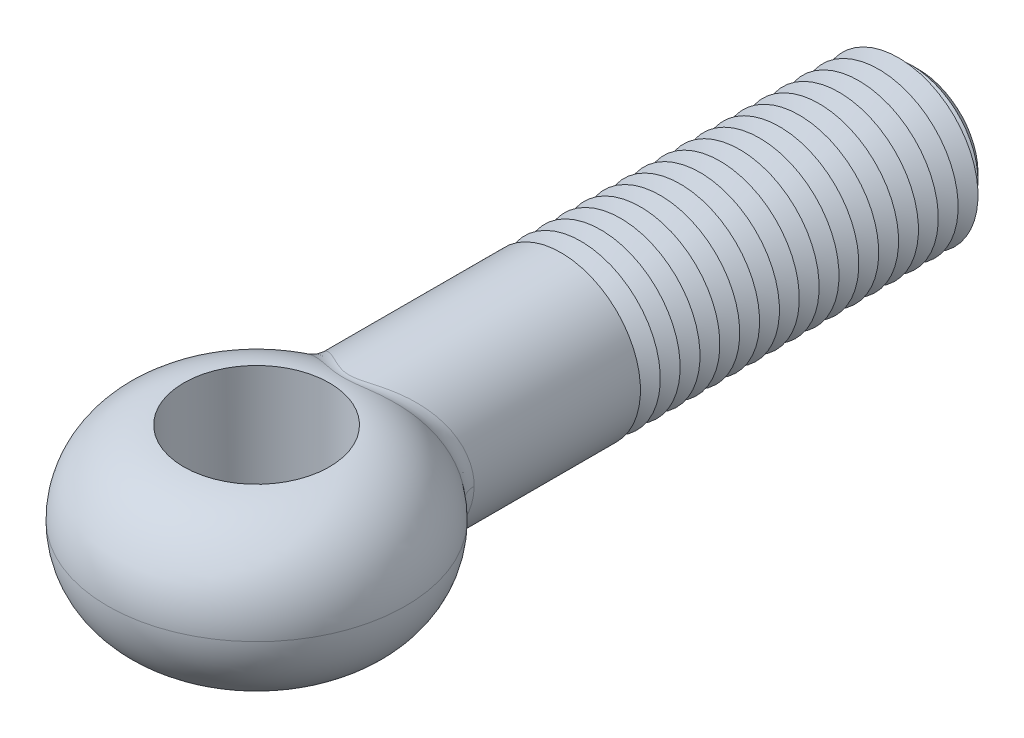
ISO-10303-21;
HEADER;
FILE_DESCRIPTION(('STEP AP214'),'2;1');
FILE_NAME('part.step','',(''),(''),'','','');
FILE_SCHEMA(('AUTOMOTIVE_DESIGN { 1 0 10303 214 1 1 1 1 }'));
ENDSEC;
DATA;
#1=APPLICATION_CONTEXT('core data for automotive mechanical design processes');
#2=APPLICATION_PROTOCOL_DEFINITION('international standard','automotive_design',2000,#1);
#3=PRODUCT_CONTEXT('',#1,'mechanical');
#4=PRODUCT('Part','Part','',(#3));
#5=PRODUCT_RELATED_PRODUCT_CATEGORY('part','',(#4));
#6=PRODUCT_DEFINITION_FORMATION('','',#4);
#7=PRODUCT_DEFINITION_CONTEXT('part definition',#1,'design');
#8=PRODUCT_DEFINITION('design','',#6,#7);
#9=PRODUCT_DEFINITION_SHAPE('','',#8);
#10=(LENGTH_UNIT() NAMED_UNIT(*) SI_UNIT(.MILLI.,.METRE.));
#11=(NAMED_UNIT(*) PLANE_ANGLE_UNIT() SI_UNIT($,.RADIAN.));
#12=(NAMED_UNIT(*) SI_UNIT($,.STERADIAN.) SOLID_ANGLE_UNIT());
#13=UNCERTAINTY_MEASURE_WITH_UNIT(LENGTH_MEASURE(1.E-05),#10,'distance_accuracy_value','');
#14=(GEOMETRIC_REPRESENTATION_CONTEXT(3) GLOBAL_UNCERTAINTY_ASSIGNED_CONTEXT((#13)) GLOBAL_UNIT_ASSIGNED_CONTEXT((#10,
#11,#12)) REPRESENTATION_CONTEXT('',''));
#15=CARTESIAN_POINT('',(0.,0.,0.));
#16=DIRECTION('',(0.,0.,1.));
#17=DIRECTION('',(1.,0.,0.));
#18=AXIS2_PLACEMENT_3D('',#15,#16,#17);
#19=CARTESIAN_POINT('',(0.,0.,-100.));
#20=DIRECTION('',(0.,0.,1.));
#21=DIRECTION('',(1.,0.,0.));
#22=AXIS2_PLACEMENT_3D('',#19,#20,#21);
#23=CYLINDRICAL_SURFACE('',#22,12.);
#24=CARTESIAN_POINT('',(0.,0.,-46.));
#25=DIRECTION('',(0.,0.,-1.));
#26=DIRECTION('',(-1.,0.,0.));
#27=AXIS2_PLACEMENT_3D('',#24,#25,#26);
#28=CIRCLE('',#27,12.);
#29=CARTESIAN_POINT('',(-12.,0.,-46.));
#30=VERTEX_POINT('',#29);
#31=EDGE_CURVE('E79',#30,#30,#28,.T.);
#32=ORIENTED_EDGE('',*,*,#31,.F.);
#33=EDGE_LOOP('',(#32));
#34=FACE_BOUND('',#33,.T.);
#35=CARTESIAN_POINT('',(11.0668506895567,-7.00530357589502,-17.0807480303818));
#36=CARTESIAN_POINT('',(10.0234990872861,-6.61021541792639,-18.0753053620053));
#37=CARTESIAN_POINT('',(9.78816741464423,-6.94202986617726,-19.5134777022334));
#38=CARTESIAN_POINT('',(11.2556958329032,-6.75368020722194,-17.1613260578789));
#39=CARTESIAN_POINT('',(10.1869276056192,-6.36184091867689,-18.1624978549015));
#40=CARTESIAN_POINT('',(9.96506204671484,-6.69267922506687,-19.6251962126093));
#41=CARTESIAN_POINT('',(11.4348613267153,-6.49403242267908,-17.2374483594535));
#42=CARTESIAN_POINT('',(10.3406855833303,-6.10798315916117,-18.2442158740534));
#43=CARTESIAN_POINT('',(10.1331767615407,-6.43537664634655,-19.7306806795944));
#44=CARTESIAN_POINT('',(11.7724527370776,-5.96016922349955,-17.3803783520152));
#45=CARTESIAN_POINT('',(10.6291362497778,-5.58941231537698,-18.3970469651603));
#46=CARTESIAN_POINT('',(10.4503638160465,-5.90633543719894,-19.9286565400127));
#47=CARTESIAN_POINT('',(11.9308725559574,-5.68594955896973,-17.447183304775));
#48=CARTESIAN_POINT('',(10.7636860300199,-5.32475984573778,-18.4680821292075));
#49=CARTESIAN_POINT('',(10.599430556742,-5.63459259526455,-20.0211441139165));
#50=CARTESIAN_POINT('',(12.225543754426,-5.12445153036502,-17.5710545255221));
#51=CARTESIAN_POINT('',(11.0129539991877,-4.78607036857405,-18.599336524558));
#52=CARTESIAN_POINT('',(10.8769937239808,-5.07816616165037,-20.1925721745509));
#53=CARTESIAN_POINT('',(12.3617854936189,-4.83716755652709,-17.6281165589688));
#54=CARTESIAN_POINT('',(11.1275308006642,-4.51212660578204,-18.659479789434));
#55=CARTESIAN_POINT('',(11.0054812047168,-4.79347701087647,-20.2715067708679));
#56=CARTESIAN_POINT('',(12.6107207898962,-4.25153049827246,-17.7321011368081));
#57=CARTESIAN_POINT('',(11.3361661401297,-3.95652222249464,-18.7687597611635));
#58=CARTESIAN_POINT('',(11.2404406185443,-4.21312957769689,-20.4153048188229));
#59=CARTESIAN_POINT('',(12.7234175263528,-3.9531789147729,-17.7790250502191));
#60=CARTESIAN_POINT('',(11.4301063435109,-3.67499018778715,-18.817833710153));
#61=CARTESIAN_POINT('',(11.346915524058,-3.9174727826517,-20.4801701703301));
#62=CARTESIAN_POINT('',(12.9208093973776,-3.35755003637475,-17.8610404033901));
#63=CARTESIAN_POINT('',(11.5941985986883,-3.1152907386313,-18.9034123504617));
#64=CARTESIAN_POINT('',(11.5335233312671,-3.32722377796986,-20.5935163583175));
#65=CARTESIAN_POINT('',(13.0063157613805,-3.06057125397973,-17.8964754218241));
#66=CARTESIAN_POINT('',(11.6649530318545,-2.83744567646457,-18.9402361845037));
#67=CARTESIAN_POINT('',(11.6144188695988,-3.03292738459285,-20.6424730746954));
#68=CARTESIAN_POINT('',(13.1535247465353,-2.46001547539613,-17.9573899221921));
#69=CARTESIAN_POINT('',(11.7865473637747,-2.27727686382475,-19.0034467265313));
#70=CARTESIAN_POINT('',(11.7537472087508,-2.43779598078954,-20.7266175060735));
#71=CARTESIAN_POINT('',(13.2152195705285,-2.15643635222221,-17.9828661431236));
#72=CARTESIAN_POINT('',(11.8373061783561,-1.99511197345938,-19.0297910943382));
#73=CARTESIAN_POINT('',(11.81217265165,-2.13695886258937,-20.7618007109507));
#74=CARTESIAN_POINT('',(13.3141154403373,-1.54515492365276,-18.0236671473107));
#75=CARTESIAN_POINT('',(11.9186021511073,-1.42805602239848,-19.0719556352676));
#76=CARTESIAN_POINT('',(11.9058504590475,-1.53119868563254,-20.8181418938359));
#77=CARTESIAN_POINT('',(13.351338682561,-1.237456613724,-18.0390011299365));
#78=CARTESIAN_POINT('',(11.9491061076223,-1.14334206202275,-19.0877585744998));
#79=CARTESIAN_POINT('',(11.9411238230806,-1.22627958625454,-20.8393125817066));
#80=CARTESIAN_POINT('',(13.4010119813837,-0.61983984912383,-18.0594576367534));
#81=CARTESIAN_POINT('',(11.989818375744,-0.572328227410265,-19.1088452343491));
#82=CARTESIAN_POINT('',(11.9881988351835,-0.614241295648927,-20.867554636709));
#83=CARTESIAN_POINT('',(13.4134617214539,-0.309921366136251,-18.0645800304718));
#84=CARTESIAN_POINT('',(12.0000000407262,-0.286212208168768,-19.1141151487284));
#85=CARTESIAN_POINT('',(12.0000001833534,-0.307122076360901,-20.8746258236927));
#86=CARTESIAN_POINT('',(13.4134613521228,0.315589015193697,-18.0645799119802));
#87=CARTESIAN_POINT('',(11.999999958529,0.291446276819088,-19.1141151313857));
#88=CARTESIAN_POINT('',(11.9999998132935,0.312738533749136,-20.8746256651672));
#89=CARTESIAN_POINT('',(13.4005517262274,0.63118101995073,-18.0592683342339));
#90=CARTESIAN_POINT('',(11.9894424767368,0.582796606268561,-19.1086507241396));
#91=CARTESIAN_POINT('',(11.9877625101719,0.625480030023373,-20.8672933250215));
#92=CARTESIAN_POINT('',(13.3490459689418,1.26003314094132,-18.0380566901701));
#93=CARTESIAN_POINT('',(11.9472266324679,1.16422234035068,-19.0867849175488));
#94=CARTESIAN_POINT('',(11.9389511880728,1.24865219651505,-20.8380086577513));
#95=CARTESIAN_POINT('',(13.3104489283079,1.57329317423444,-18.0221562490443));
#96=CARTESIAN_POINT('',(11.9155958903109,1.45410364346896,-19.0703978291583));
#97=CARTESIAN_POINT('',(11.902376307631,1.55908278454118,-20.8160558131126));
#98=CARTESIAN_POINT('',(13.2079559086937,2.19523221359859,-17.9798674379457));
#99=CARTESIAN_POINT('',(11.8313307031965,2.03114104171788,-19.0266903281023));
#100=CARTESIAN_POINT('',(11.8052934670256,2.17540431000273,-20.757659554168));
#101=CARTESIAN_POINT('',(13.1440553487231,2.50391037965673,-17.9534771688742));
#102=CARTESIAN_POINT('',(11.778747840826,2.31811265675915,-18.9993967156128));
#103=CARTESIAN_POINT('',(11.7447811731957,2.48129441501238,-20.7212135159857));
#104=CARTESIAN_POINT('',(12.9915746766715,3.11452894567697,-17.890369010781));
#105=CARTESIAN_POINT('',(11.6527601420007,2.88786980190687,-18.9338924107));
#106=CARTESIAN_POINT('',(11.6004711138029,3.08639771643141,-20.6340369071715));
#107=CARTESIAN_POINT('',(12.9029856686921,3.41646687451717,-17.8536473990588));
#108=CARTESIAN_POINT('',(11.5794275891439,3.17048606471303,-18.8957194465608));
#109=CARTESIAN_POINT('',(11.5166649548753,3.38560846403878,-20.5833011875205));
#110=CARTESIAN_POINT('',(12.7022190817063,4.01079458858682,-17.7702015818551));
#111=CARTESIAN_POINT('',(11.4124346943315,3.72932815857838,-18.8086044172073));
#112=CARTESIAN_POINT('',(11.3268856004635,3.97456805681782,-20.4679735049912));
#113=CARTESIAN_POINT('',(12.5900903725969,4.30320272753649,-17.7234980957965));
#114=CARTESIAN_POINT('',(11.3189167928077,4.00541898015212,-18.7597374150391));
#115=CARTESIAN_POINT('',(11.2209583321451,4.26433508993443,-20.4034102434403));
#116=CARTESIAN_POINT('',(12.3431556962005,4.87731134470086,-17.6203174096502));
#117=CARTESIAN_POINT('',(11.1118629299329,4.55038551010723,-18.6512584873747));
#118=CARTESIAN_POINT('',(10.9879091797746,4.83325821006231,-20.260718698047));
#119=CARTESIAN_POINT('',(12.2083417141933,5.15900799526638,-17.5638367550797));
#120=CARTESIAN_POINT('',(10.9984353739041,4.81913932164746,-18.5917040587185));
#121=CARTESIAN_POINT('',(10.8607798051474,5.11241050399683,-20.1825856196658));
#122=CARTESIAN_POINT('',(11.9173359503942,5.70976821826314,-17.4414779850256));
#123=CARTESIAN_POINT('',(10.7521869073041,5.34773597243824,-18.462013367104));
#124=CARTESIAN_POINT('',(10.5866916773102,5.65819611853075,-20.0132458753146));
#125=CARTESIAN_POINT('',(11.7611511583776,5.97883588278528,-17.375602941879));
#126=CARTESIAN_POINT('',(10.6194983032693,5.60749077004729,-18.391948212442));
#127=CARTESIAN_POINT('',(10.4397394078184,5.92483349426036,-19.9220434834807));
#128=CARTESIAN_POINT('',(11.4287046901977,6.5029302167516,-17.2348317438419));
#129=CARTESIAN_POINT('',(10.3353872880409,6.11671914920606,-18.2414005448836));
#130=CARTESIAN_POINT('',(10.1273983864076,6.44419407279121,-19.7270547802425));
#131=CARTESIAN_POINT('',(11.2524417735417,6.75795601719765,-17.1599350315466));
#132=CARTESIAN_POINT('',(10.1840940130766,6.36613220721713,-18.1609883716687));
#133=CARTESIAN_POINT('',(9.96200849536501,6.69691641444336,-19.6232676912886));
#134=CARTESIAN_POINT('',(10.8755162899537,7.26030557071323,-16.999110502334));
#135=CARTESIAN_POINT('',(9.85865758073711,6.86075287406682,-17.9873566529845));
#136=CARTESIAN_POINT('',(9.6089466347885,7.19472861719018,-19.4002901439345));
#137=CARTESIAN_POINT('',(10.6742674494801,7.50714674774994,-16.9129130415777));
#138=CARTESIAN_POINT('',(9.684069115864,7.10559423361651,-17.8938830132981));
#139=CARTESIAN_POINT('',(9.42074350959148,7.43934026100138,-19.2807224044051));
#140=CARTESIAN_POINT('',(10.2535888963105,7.98325367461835,-16.7319589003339));
#141=CARTESIAN_POINT('',(9.31692741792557,7.58129738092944,-17.6964993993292));
#142=CARTESIAN_POINT('',(9.0281736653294,7.91114686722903,-19.0295700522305));
#143=CARTESIAN_POINT('',(10.0341636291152,8.21252369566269,-16.637204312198));
#144=CARTESIAN_POINT('',(9.12451201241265,7.81216456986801,-17.5926673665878));
#145=CARTESIAN_POINT('',(8.82381089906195,8.13834606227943,-18.8979883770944));
#146=CARTESIAN_POINT('',(9.57850828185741,8.65276143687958,-16.4396502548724));
#147=CARTESIAN_POINT('',(8.72267859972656,8.25878016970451,-17.3749330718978));
#148=CARTESIAN_POINT('',(8.40050866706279,8.57460746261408,-18.623492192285));
#149=CARTESIAN_POINT('',(9.34226759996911,8.86371742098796,-16.3368457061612));
#150=CARTESIAN_POINT('',(8.51336852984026,8.4745533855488,-17.2610929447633));
#151=CARTESIAN_POINT('',(8.18156001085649,8.78365803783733,-18.4805705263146));
#152=CARTESIAN_POINT('',(8.85465264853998,9.26641239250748,-16.1239505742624));
#153=CARTESIAN_POINT('',(8.07909814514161,8.88955655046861,-17.0240228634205));
#154=CARTESIAN_POINT('',(7.73099517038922,9.18271576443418,-18.1844263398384));
#155=CARTESIAN_POINT('',(8.60328194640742,9.45815588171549,-16.013861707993));
#156=CARTESIAN_POINT('',(7.85424144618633,9.08885199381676,-16.9008538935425));
#157=CARTESIAN_POINT('',(7.49938197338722,9.37272737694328,-18.0312062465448));
#158=CARTESIAN_POINT('',(8.06370502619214,9.838189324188,-15.7770858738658));
#159=CARTESIAN_POINT('',(7.36948144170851,9.48676203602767,-16.6345956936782));
#160=CARTESIAN_POINT('',(7.00398623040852,9.74932825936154,-17.7014858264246));
#161=CARTESIAN_POINT('',(7.77421051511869,10.0246580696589,-15.6497932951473));
#162=CARTESIAN_POINT('',(7.10821519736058,9.68394461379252,-16.4906997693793));
#163=CARTESIAN_POINT('',(6.73917402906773,9.93411277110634,-17.5241266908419));
#164=CARTESIAN_POINT('',(7.18020960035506,10.3739440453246,-15.3887823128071));
#165=CARTESIAN_POINT('',(6.56993984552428,10.0563267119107,-16.1940603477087));
#166=CARTESIAN_POINT('',(6.1983598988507,10.2802439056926,-17.1602711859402));
#167=CARTESIAN_POINT('',(6.8757060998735,10.5367658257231,-15.2550651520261));
#168=CARTESIAN_POINT('',(6.29299233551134,10.2316662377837,-16.0413517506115));
#169=CARTESIAN_POINT('',(5.92236013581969,10.4415950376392,-16.9737765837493));
#170=CARTESIAN_POINT('',(6.25253303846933,10.8386647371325,-14.9829888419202));
#171=CARTESIAN_POINT('',(5.72450599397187,10.559425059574,-15.7291507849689));
#172=CARTESIAN_POINT('',(5.36070387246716,10.7407671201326,-16.5941767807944));
#173=CARTESIAN_POINT('',(5.93386874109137,10.9777505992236,-14.8446314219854));
#174=CARTESIAN_POINT('',(5.432987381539,10.7120059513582,-15.5696627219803));
#175=CARTESIAN_POINT('',(5.07505096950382,10.8785967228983,-16.4010740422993));
#176=CARTESIAN_POINT('',(5.28221556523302,11.2323272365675,-14.5658439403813));
#177=CARTESIAN_POINT('',(4.83577895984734,10.9935431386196,-15.2469866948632));
#178=CARTESIAN_POINT('',(4.49486022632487,11.1308739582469,-16.0119192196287));
#179=CARTESIAN_POINT('',(4.94923070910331,11.3478245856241,-14.4254144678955));
#180=CARTESIAN_POINT('',(4.53005970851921,11.1226685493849,-15.0837625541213));
#181=CARTESIAN_POINT('',(4.20032488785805,11.2453281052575,-15.8158679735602));
#182=CARTESIAN_POINT('',(4.418859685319,11.5092496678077,-14.2088988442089));
#183=CARTESIAN_POINT('',(4.04244425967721,11.3047506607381,-14.8310562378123));
#184=CARTESIAN_POINT('',(3.73498180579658,11.4052951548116,-15.5136345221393));
#185=CARTESIAN_POINT('',(4.22698520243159,11.5632823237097,-14.1319559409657));
#186=CARTESIAN_POINT('',(3.86615136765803,11.3659940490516,-14.7411592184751));
#187=CARTESIAN_POINT('',(3.56736640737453,11.4588397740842,-15.4062382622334));
#188=CARTESIAN_POINT('',(3.83770554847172,11.6641157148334,-13.9800981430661));
#189=CARTESIAN_POINT('',(3.50855117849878,11.4808212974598,-14.563464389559));
#190=CARTESIAN_POINT('',(3.22895536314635,11.5587624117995,-15.1943126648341));
#191=CARTESIAN_POINT('',(3.64030104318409,11.7109173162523,-13.9051830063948));
#192=CARTESIAN_POINT('',(3.32722277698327,11.5344340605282,-14.4756451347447));
#193=CARTESIAN_POINT('',(3.058160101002,11.6051412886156,-15.0897829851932));
#194=CARTESIAN_POINT('',(3.23881755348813,11.7973007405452,-13.7590320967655));
#195=CARTESIAN_POINT('',(2.9586556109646,11.6338410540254,-14.3041084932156));
#196=CARTESIAN_POINT('',(2.7126029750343,11.6907444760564,-14.8859114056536));
#197=CARTESIAN_POINT('',(3.034729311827,11.8368720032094,-13.6878018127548));
#198=CARTESIAN_POINT('',(2.7713784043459,11.6796514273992,-14.2203690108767));
#199=CARTESIAN_POINT('',(2.53783572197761,11.729958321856,-14.7865772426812));
#200=CARTESIAN_POINT('',(2.61924941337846,11.9085316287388,-13.5518208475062));
#201=CARTESIAN_POINT('',(2.39049286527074,11.7629647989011,-14.0603637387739));
#202=CARTESIAN_POINT('',(2.18396259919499,11.8009706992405,-14.5970091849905));
#203=CARTESIAN_POINT('',(2.40785949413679,11.9406217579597,-13.487068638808));
#204=CARTESIAN_POINT('',(2.19684547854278,11.8004961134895,-13.9840608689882));
#205=CARTESIAN_POINT('',(2.00485776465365,11.8327709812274,-14.5067731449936));
#206=CARTESIAN_POINT('',(1.88979300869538,12.0083312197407,-13.3438479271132));
#207=CARTESIAN_POINT('',(1.72298962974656,11.8799550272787,-13.8152500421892));
#208=CARTESIAN_POINT('',(1.56826217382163,11.8998688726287,-14.307262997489));
#209=CARTESIAN_POINT('',(1.57889083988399,12.0402078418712,-13.2702876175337));
#210=CARTESIAN_POINT('',(1.4388724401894,11.9177031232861,-13.728341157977));
#211=CARTESIAN_POINT('',(1.30813242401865,11.9314575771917,-14.2048593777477));
#212=CARTESIAN_POINT('',(1.1016812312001,12.0751548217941,-13.186477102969));
#213=CARTESIAN_POINT('',(1.00343635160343,11.9592039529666,-13.6293092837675));
#214=CARTESIAN_POINT('',(0.911154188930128,11.9660889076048,-14.08823090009));
#215=CARTESIAN_POINT('',(0.941325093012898,12.0846492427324,-13.1629946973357));
#216=CARTESIAN_POINT('',(0.857250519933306,11.9705082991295,-13.6015536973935));
#217=CARTESIAN_POINT('',(0.778128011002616,11.9754975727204,-14.0555630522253));
#218=CARTESIAN_POINT('',(0.617680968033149,12.0991842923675,-13.1266072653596));
#219=CARTESIAN_POINT('',(0.562389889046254,11.9878287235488,-13.5585487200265));
#220=CARTESIAN_POINT('',(0.510147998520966,11.9899013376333,-14.0049481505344));
#221=CARTESIAN_POINT('',(0.454393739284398,12.104226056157,-13.1136995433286));
#222=CARTESIAN_POINT('',(0.413680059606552,11.9938505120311,-13.5432855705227));
#223=CARTESIAN_POINT('',(0.375194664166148,11.994897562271,-13.986997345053));
#224=CARTESIAN_POINT('',(0.124773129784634,12.1097166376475,-13.0996281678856));
#225=CARTESIAN_POINT('',(0.113587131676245,12.0004071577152,-13.5266507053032));
#226=CARTESIAN_POINT('',(0.102974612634,12.0003385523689,-13.9674284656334));
#227=CARTESIAN_POINT('',(-0.0415739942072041,12.1101142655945,-13.0985954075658));
#228=CARTESIAN_POINT('',(-0.0378485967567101,12.0008826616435,-13.5254292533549));
#229=CARTESIAN_POINT('',(-0.0343012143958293,12.0007325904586,-13.9659924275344));
#230=CARTESIAN_POINT('',(-0.373368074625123,12.1061686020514,-13.1087272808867));
#231=CARTESIAN_POINT('',(-0.33990308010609,11.9961701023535,-13.5374072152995));
#232=CARTESIAN_POINT('',(-0.308257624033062,11.9968225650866,-13.9800824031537));
#233=CARTESIAN_POINT('',(-0.538814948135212,12.1018248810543,-13.1198930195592));
#234=CARTESIAN_POINT('',(-0.490563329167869,11.9909802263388,-13.5506112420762));
#235=CARTESIAN_POINT('',(-0.444938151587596,11.9925180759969,-13.9956099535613));
#236=CARTESIAN_POINT('',(-0.867965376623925,12.0885089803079,-13.153394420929));
#237=CARTESIAN_POINT('',(-0.790396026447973,11.9751052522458,-13.5902076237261));
#238=CARTESIAN_POINT('',(-0.717328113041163,11.979322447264,-14.0422082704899));
#239=CARTESIAN_POINT('',(-1.03165081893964,12.0795071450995,-13.1758016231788));
#240=CARTESIAN_POINT('',(-0.939590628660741,11.9643807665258,-13.6166946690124));
#241=CARTESIAN_POINT('',(-0.853025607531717,11.9704019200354,-14.0733785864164));
#242=CARTESIAN_POINT('',(-1.35507829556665,12.0571088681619,-13.2299063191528));
#243=CARTESIAN_POINT('',(-1.23455248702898,11.937774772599,-13.6806107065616));
#244=CARTESIAN_POINT('',(-1.12186617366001,11.9482059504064,-14.148663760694));
#245=CARTESIAN_POINT('',(-1.51481934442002,12.0437113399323,-13.2616061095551));
#246=CARTESIAN_POINT('',(-1.38035112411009,11.9218856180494,-13.7180567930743));
#247=CARTESIAN_POINT('',(-1.25500860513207,11.9349294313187,-14.1927818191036));
#248=CARTESIAN_POINT('',(-1.84495456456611,12.011300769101,-13.3355882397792));
#249=CARTESIAN_POINT('',(-1.68188899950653,11.8835783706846,-13.8053908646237));
#250=CARTESIAN_POINT('',(-1.53107532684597,11.9028116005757,-14.2957778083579));
#251=CARTESIAN_POINT('',(-2.01491382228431,11.9918743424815,-13.3785910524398));
#252=CARTESIAN_POINT('',(-1.83727107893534,11.8606743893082,-13.8561401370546));
#253=CARTESIAN_POINT('',(-1.67372311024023,11.8835606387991,-14.3556614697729));
#254=CARTESIAN_POINT('',(-2.34982544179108,11.9483049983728,-13.4708803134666));
#255=CARTESIAN_POINT('',(-2.14368396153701,11.8095216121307,-13.9649543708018));
#256=CARTESIAN_POINT('',(-1.95593412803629,11.8403848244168,-14.484221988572));
#257=CARTESIAN_POINT('',(-2.51477537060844,11.9241598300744,-13.520169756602));
#258=CARTESIAN_POINT('',(-2.29473884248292,11.7812588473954,-14.0230424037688));
#259=CARTESIAN_POINT('',(-2.09549585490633,11.8164577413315,-14.5529030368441));
#260=CARTESIAN_POINT('',(-2.84030915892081,11.8712884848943,-13.6232162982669));
#261=CARTESIAN_POINT('',(-2.59304039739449,11.7196429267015,-14.1443586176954));
#262=CARTESIAN_POINT('',(-2.37205348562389,11.7640639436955,-14.6965334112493));
#263=CARTESIAN_POINT('',(-3.00088551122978,11.8425549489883,-13.6769805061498));
#264=CARTESIAN_POINT('',(-2.74030070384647,11.6862694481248,-14.2076122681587));
#265=CARTESIAN_POINT('',(-2.50904486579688,11.7355899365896,-14.7714927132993));
#266=CARTESIAN_POINT('',(-3.31787265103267,11.7806424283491,-13.7874770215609));
#267=CARTESIAN_POINT('',(-3.03113701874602,11.6146813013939,-14.3374619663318));
#268=CARTESIAN_POINT('',(-2.7805695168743,11.6742366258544,-14.9255877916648));
#269=CARTESIAN_POINT('',(-3.47428412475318,11.7474641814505,-13.8442088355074));
#270=CARTESIAN_POINT('',(-3.17472979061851,11.5764547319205,-14.404072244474));
#271=CARTESIAN_POINT('',(-2.91510319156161,11.6413580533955,-15.0047228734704));
#272=CARTESIAN_POINT('',(-3.78404739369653,11.67656761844,-13.9598300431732));
#273=CARTESIAN_POINT('',(-3.45918061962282,11.4951374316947,-14.5396537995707));
#274=CARTESIAN_POINT('',(-3.18257716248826,11.5711018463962,-15.1660331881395));
#275=CARTESIAN_POINT('',(-3.93738431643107,11.6388315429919,-14.0187272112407));
#276=CARTESIAN_POINT('',(-3.60003721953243,11.4520148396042,-14.6086453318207));
#277=CARTESIAN_POINT('',(-3.31550885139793,11.5337066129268,-15.2482193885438));
#278=CARTESIAN_POINT('',(-4.24071273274,11.5589459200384,-14.1376822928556));
#279=CARTESIAN_POINT('',(-3.87868653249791,11.3611356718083,-14.7477942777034));
#280=CARTESIAN_POINT('',(-3.57944589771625,11.4545425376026,-15.4142328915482));
#281=CARTESIAN_POINT('',(-4.39070396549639,11.5167960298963,-14.1977402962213));
#282=CARTESIAN_POINT('',(-4.01648905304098,11.3133653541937,-14.8179616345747));
#283=CARTESIAN_POINT('',(-3.7104511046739,11.4127733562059,-15.4980603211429));
#284=CARTESIAN_POINT('',(-4.8357946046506,11.3838162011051,-14.3786158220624));
#285=CARTESIAN_POINT('',(-4.4257108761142,11.1631818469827,-15.0291599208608));
#286=CARTESIAN_POINT('',(-4.10054896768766,11.2809946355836,-15.750538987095));
#287=CARTESIAN_POINT('',(-5.12633926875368,11.2863806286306,-14.500260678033));
#288=CARTESIAN_POINT('',(-4.69251664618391,11.0540121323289,-15.170680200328));
#289=CARTESIAN_POINT('',(-4.35700776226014,11.1844391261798,-15.9203621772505));
#290=CARTESIAN_POINT('',(-5.71340475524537,11.0674990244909,-14.7497300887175));
#291=CARTESIAN_POINT('',(-5.23094469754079,10.811014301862,-15.4599151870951));
#292=CARTESIAN_POINT('',(-4.87826833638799,10.9675345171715,-16.2686079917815));
#293=CARTESIAN_POINT('',(-6.00925252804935,10.9449693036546,-14.8774916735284));
#294=CARTESIAN_POINT('',(-5.50187190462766,10.6760136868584,-15.6074949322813));
#295=CARTESIAN_POINT('',(-5.14265857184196,10.8461115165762,-16.446941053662));
#296=CARTESIAN_POINT('',(-6.58901820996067,10.6799255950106,-15.1296175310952));
#297=CARTESIAN_POINT('',(-6.0315628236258,10.3867756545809,-15.8975382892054));
#298=CARTESIAN_POINT('',(-5.66351510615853,10.5834617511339,-16.7987693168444));
#299=CARTESIAN_POINT('',(-6.87293369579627,10.5374075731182,-15.2539811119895));
#300=CARTESIAN_POINT('',(-6.29032294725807,10.2324127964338,-16.0400075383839));
#301=CARTESIAN_POINT('',(-5.91997979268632,10.4422309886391,-16.9722635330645));
#302=CARTESIAN_POINT('',(-7.42781601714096,10.2327138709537,-15.4975137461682));
#303=CARTESIAN_POINT('',(-6.79447470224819,9.90543645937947,-16.3177763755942));
#304=CARTESIAN_POINT('',(-6.42343369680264,10.1402893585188,-17.3118682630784));
#305=CARTESIAN_POINT('',(-7.69880705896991,10.0705771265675,-15.6166924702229));
#306=CARTESIAN_POINT('',(-7.03986086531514,9.7327471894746,-16.4530735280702));
#307=CARTESIAN_POINT('',(-6.67044044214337,9.97961707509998,-17.4779925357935));
#308=CARTESIAN_POINT('',(-8.22752602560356,9.72661338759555,-15.8490032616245));
#309=CARTESIAN_POINT('',(-7.516849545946,9.3696549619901,-16.7156042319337));
#310=CARTESIAN_POINT('',(-7.15414912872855,9.63876010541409,-17.8016554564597));
#311=CARTESIAN_POINT('',(-8.48525397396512,9.54478642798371,-15.9621353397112));
#312=CARTESIAN_POINT('',(-7.74838988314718,9.17915766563,-16.8428011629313));
#313=CARTESIAN_POINT('',(-7.39085108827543,9.45857545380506,-17.9591941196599));
#314=CARTESIAN_POINT('',(-9.04166371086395,9.11943479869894,-16.2057439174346));
#315=CARTESIAN_POINT('',(-8.24643700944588,8.73712339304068,-17.1155654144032));
#316=CARTESIAN_POINT('',(-7.90344846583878,9.03706571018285,-18.2982438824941));
#317=CARTESIAN_POINT('',(-9.33680953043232,8.87115530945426,-16.3345284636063));
#318=CARTESIAN_POINT('',(-8.5088809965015,8.48157779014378,-17.2587098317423));
#319=CARTESIAN_POINT('',(-8.17644570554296,8.79102874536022,-18.4773591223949));
#320=CARTESIAN_POINT('',(-9.90300273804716,8.34681842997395,-16.5805049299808));
#321=CARTESIAN_POINT('',(-9.00956487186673,7.94739974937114,-17.5305747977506));
#322=CARTESIAN_POINT('',(-8.7017229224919,8.27142781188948,-18.8192409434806));
#323=CARTESIAN_POINT('',(-10.1740457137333,8.07075597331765,-16.6976947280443));
#324=CARTESIAN_POINT('',(-9.24759259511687,7.66868796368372,-17.6591721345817));
#325=CARTESIAN_POINT('',(-8.95399910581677,7.99785882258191,-18.9820045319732));
#326=CARTESIAN_POINT('',(-10.6893747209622,7.49227394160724,-16.9194545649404));
#327=CARTESIAN_POINT('',(-9.69758548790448,7.09025247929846,-17.9011953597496));
#328=CARTESIAN_POINT('',(-9.43479391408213,7.4246017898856,-19.2898096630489));
#329=CARTESIAN_POINT('',(-10.9336387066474,7.18983301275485,-17.0240142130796));
#330=CARTESIAN_POINT('',(-9.90928717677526,6.79050605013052,-18.0144718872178));
#331=CARTESIAN_POINT('',(-9.66329295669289,7.1248925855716,-19.434836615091));
#332=CARTESIAN_POINT('',(-11.3922237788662,6.56101137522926,-17.219416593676));
#333=CARTESIAN_POINT('',(-10.3045410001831,6.17279493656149,-18.2250928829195));
#334=CARTESIAN_POINT('',(-10.0930881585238,6.50175062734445,-19.705708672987));
#335=CARTESIAN_POINT('',(-11.6065510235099,6.23463561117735,-17.31026214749));
#336=CARTESIAN_POINT('',(-10.4878412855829,5.85490191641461,-18.3222983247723));
#337=CARTESIAN_POINT('',(-10.2943899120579,6.1783227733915,-19.8315577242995));
#338=CARTESIAN_POINT('',(-11.9788069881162,5.60102165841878,-17.4673989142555));
#339=CARTESIAN_POINT('',(-10.8045077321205,5.24277677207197,-18.4896383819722));
#340=CARTESIAN_POINT('',(-10.6445307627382,5.55043178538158,-20.0491319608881));
#341=CARTESIAN_POINT('',(-12.1404155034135,5.29616663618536,-17.535327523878));
#342=CARTESIAN_POINT('',(-10.9411166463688,4.95021714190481,-18.5615610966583));
#343=CARTESIAN_POINT('',(-10.7967651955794,5.24833029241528,-20.1431384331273));
#344=CARTESIAN_POINT('',(-12.4365532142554,4.67222519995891,-17.6594117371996));
#345=CARTESIAN_POINT('',(-11.1904485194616,4.35503313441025,-18.6924913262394));
#346=CARTESIAN_POINT('',(-11.0760057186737,4.63002445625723,-20.3147946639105));
#347=CARTESIAN_POINT('',(-12.5710856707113,4.3531405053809,-17.7155687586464));
#348=CARTESIAN_POINT('',(-11.3030104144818,4.05255416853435,-18.7514129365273));
#349=CARTESIAN_POINT('',(-11.2030148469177,4.31382181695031,-20.3924463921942));
#350=CARTESIAN_POINT('',(-12.8113072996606,3.70386059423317,-17.8155899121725));
#351=CARTESIAN_POINT('',(-11.5033629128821,3.44010607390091,-18.8560787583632));
#352=CARTESIAN_POINT('',(-11.4299721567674,3.67040636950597,-20.5307108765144));
#353=CARTESIAN_POINT('',(-12.9170534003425,3.37368877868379,-17.8594783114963));
#354=CARTESIAN_POINT('',(-11.5910600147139,3.13033564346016,-18.9017738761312));
#355=CARTESIAN_POINT('',(-11.5299737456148,3.34321675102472,-20.591357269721));
#356=CARTESIAN_POINT('',(-13.0987625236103,2.7045032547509,-17.9347558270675));
#357=CARTESIAN_POINT('',(-11.7414276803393,2.50483422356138,-18.9800127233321));
#358=CARTESIAN_POINT('',(-11.7018998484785,2.68007548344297,-20.6953560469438));
#359=CARTESIAN_POINT('',(-13.1747386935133,2.36549352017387,-17.966150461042));
#360=CARTESIAN_POINT('',(-11.8039950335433,2.18932374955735,-19.0125025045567));
#361=CARTESIAN_POINT('',(-11.7738367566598,2.34412777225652,-20.7387160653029));
#362=CARTESIAN_POINT('',(-13.2945218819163,1.69001403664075,-18.0155922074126));
#363=CARTESIAN_POINT('',(-11.9025350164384,1.56217664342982,-19.0636291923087));
#364=CARTESIAN_POINT('',(-11.8872853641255,1.67474939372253,-20.8069927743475));
#365=CARTESIAN_POINT('',(-13.3390876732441,1.35369370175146,-18.0339542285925));
#366=CARTESIAN_POINT('',(-11.9390623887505,1.25085799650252,-19.0825551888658));
#367=CARTESIAN_POINT('',(-11.9295146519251,1.34146679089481,-20.8323446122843));
#368=CARTESIAN_POINT('',(-13.3985522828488,0.678243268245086,-18.0584460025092));
#369=CARTESIAN_POINT('',(-11.9878097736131,0.62623517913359,-19.1078059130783));
#370=CARTESIAN_POINT('',(-11.9858669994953,0.672117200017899,-20.8661581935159));
#371=CARTESIAN_POINT('',(-13.4134605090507,0.339114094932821,-18.0645796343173));
#372=CARTESIAN_POINT('',(-11.9999997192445,0.313171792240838,-19.1141150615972));
#373=CARTESIAN_POINT('',(-11.99999897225,0.336051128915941,-20.8746252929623));
#374=CARTESIAN_POINT('',(-13.4134624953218,-0.315214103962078,-18.0645802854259));
#375=CARTESIAN_POINT('',(-12.0000002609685,-0.291100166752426,-19.1141152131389));
#376=CARTESIAN_POINT('',(-12.0000009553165,-0.312367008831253,-20.8746261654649));
#377=CARTESIAN_POINT('',(-13.4005834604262,-0.630415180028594,-18.0592813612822));
#378=CARTESIAN_POINT('',(-11.989468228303,-0.582089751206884,-19.1086640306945));
#379=CARTESIAN_POINT('',(-11.987792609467,-0.624721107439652,-20.8673113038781));
#380=CARTESIAN_POINT('',(-13.3491942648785,-1.25859966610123,-18.0381178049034));
#381=CARTESIAN_POINT('',(-11.9473483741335,-1.16289640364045,-19.0868480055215));
#382=CARTESIAN_POINT('',(-11.9390917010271,-1.24723166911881,-20.8380930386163));
#383=CARTESIAN_POINT('',(-13.3106752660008,-1.57158227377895,-18.0222495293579));
#384=CARTESIAN_POINT('',(-11.9157815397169,-1.45251959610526,-19.070494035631));
#385=CARTESIAN_POINT('',(-11.9025907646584,-1.55738733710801,-20.8161846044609));
#386=CARTESIAN_POINT('',(-13.2082732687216,-2.19364255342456,-17.9799984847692));
#387=CARTESIAN_POINT('',(-11.8315919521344,-2.02966309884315,-19.0268259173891));
#388=CARTESIAN_POINT('',(-11.8055940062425,-2.17382900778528,-20.7578405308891));
#389=CARTESIAN_POINT('',(-13.1443316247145,-2.50270947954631,-17.953591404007));
#390=CARTESIAN_POINT('',(-11.7789758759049,-2.31699330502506,-18.9995151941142));
#391=CARTESIAN_POINT('',(-11.7450427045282,-2.48010436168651,-20.7213713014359));
#392=CARTESIAN_POINT('',(-12.9917331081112,-3.11398878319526,-17.8904346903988));
#393=CARTESIAN_POINT('',(-11.6528914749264,-2.88736356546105,-18.9339607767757));
#394=CARTESIAN_POINT('',(-11.6006209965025,-3.08586243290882,-20.6341276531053));
#395=CARTESIAN_POINT('',(-12.9030756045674,-3.41620098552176,-17.8536847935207));
#396=CARTESIAN_POINT('',(-11.57950265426,-3.17023510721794,-18.895758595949));
#397=CARTESIAN_POINT('',(-11.5167499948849,-3.38534497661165,-20.5833528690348));
#398=CARTESIAN_POINT('',(-12.7021040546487,-4.01113475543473,-17.77015375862));
#399=CARTESIAN_POINT('',(-11.4123391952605,-3.72964749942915,-18.8085546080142));
#400=CARTESIAN_POINT('',(-11.3267768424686,-3.97490515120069,-20.4679074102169));
#401=CARTESIAN_POINT('',(-12.5898329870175,-4.30387246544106,-17.7233908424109));
#402=CARTESIAN_POINT('',(-11.3187022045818,-4.00605158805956,-18.7596253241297));
#403=CARTESIAN_POINT('',(-11.2207150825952,-4.26499877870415,-20.4032619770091));
#404=CARTESIAN_POINT('',(-12.3425923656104,-4.87854946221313,-17.6200817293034));
#405=CARTESIAN_POINT('',(-11.1113901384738,-4.55156205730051,-18.6510104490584));
#406=CARTESIAN_POINT('',(-10.9873778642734,-4.83448514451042,-20.2603927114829));
#407=CARTESIAN_POINT('',(-12.2076200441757,-5.16048742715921,-17.5635343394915));
#408=CARTESIAN_POINT('',(-10.9978285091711,-4.82054774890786,-18.5913850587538));
#409=CARTESIAN_POINT('',(-10.8600998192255,-5.11387657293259,-20.1821672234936));
#410=CARTESIAN_POINT('',(-11.9165165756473,-5.71120494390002,-17.4411324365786));
#411=CARTESIAN_POINT('',(-10.7514900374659,-5.34912610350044,-18.4616457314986));
#412=CARTESIAN_POINT('',(-10.5859202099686,-5.65961986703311,-20.0127675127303));
#413=CARTESIAN_POINT('',(-11.7604304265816,-5.98001086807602,-17.3752977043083));
#414=CARTESIAN_POINT('',(-10.6188806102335,-5.60864484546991,-18.3916220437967));
#415=CARTESIAN_POINT('',(-10.4390603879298,-5.92599786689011,-19.9216208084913));
#416=CARTESIAN_POINT('',(-11.4282849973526,-6.50355289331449,-17.2346540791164));
#417=CARTESIAN_POINT('',(-10.335029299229,-6.1173138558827,-18.2412097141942));
#418=CARTESIAN_POINT('',(-10.1270059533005,-6.44481112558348,-19.7268085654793));
#419=CARTESIAN_POINT('',(-11.2522312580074,-6.75829286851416,-17.1598476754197));
#420=CARTESIAN_POINT('',(-10.1839224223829,-6.36640726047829,-18.1608946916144));
#421=CARTESIAN_POINT('',(-9.96181642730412,-6.6972502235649,-19.6231464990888));
#422=CARTESIAN_POINT('',(-11.0668506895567,-7.00530357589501,-17.0807480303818));
#423=CARTESIAN_POINT('',(-10.0234990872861,-6.61021541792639,-18.0753053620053));
#424=CARTESIAN_POINT('',(-9.78816741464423,-6.94202986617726,-19.5134777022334));
#425=(BOUNDED_SURFACE() B_SPLINE_SURFACE(3,2,((#35,#36,#37),(#38,#39,#40),(#41,#42,#43),(#44,
#45,#46),(#47,#48,#49),(#50,#51,#52),(#53,#54,#55),(#56,#57,#58),(#59,#60,#61),(#62,#63,#64),
(#65,#66,#67),(#68,#69,#70),(#71,#72,#73),(#74,#75,#76),(#77,#78,#79),(#80,#81,#82),(#83,#84,
#85),(#86,#87,#88),(#89,#90,#91),(#92,#93,#94),(#95,#96,#97),(#98,#99,#100),(#101,#102,#103),
(#104,#105,#106),(#107,#108,#109),(#110,#111,#112),(#113,#114,#115),(#116,#117,#118),(#119,#120,
#121),(#122,#123,#124),(#125,#126,#127),(#128,#129,#130),(#131,#132,#133),(#134,#135,#136),
(#137,#138,#139),(#140,#141,#142),(#143,#144,#145),(#146,#147,#148),(#149,#150,#151),(#152,#153,
#154),(#155,#156,#157),(#158,#159,#160),(#161,#162,#163),(#164,#165,#166),(#167,#168,#169),
(#170,#171,#172),(#173,#174,#175),(#176,#177,#178),(#179,#180,#181),(#182,#183,#184),(#185,#186,
#187),(#188,#189,#190),(#191,#192,#193),(#194,#195,#196),(#197,#198,#199),(#200,#201,#202),
(#203,#204,#205),(#206,#207,#208),(#209,#210,#211),(#212,#213,#214),(#215,#216,#217),(#218,#219,
#220),(#221,#222,#223),(#224,#225,#226),(#227,#228,#229),(#230,#231,#232),(#233,#234,#235),
(#236,#237,#238),(#239,#240,#241),(#242,#243,#244),(#245,#246,#247),(#248,#249,#250),(#251,#252,
#253),(#254,#255,#256),(#257,#258,#259),(#260,#261,#262),(#263,#264,#265),(#266,#267,#268),
(#269,#270,#271),(#272,#273,#274),(#275,#276,#277),(#278,#279,#280),(#281,#282,#283),(#284,#285,
#286),(#287,#288,#289),(#290,#291,#292),(#293,#294,#295),(#296,#297,#298),(#299,#300,#301),
(#302,#303,#304),(#305,#306,#307),(#308,#309,#310),(#311,#312,#313),(#314,#315,#316),(#317,#318,
#319),(#320,#321,#322),(#323,#324,#325),(#326,#327,#328),(#329,#330,#331),(#332,#333,#334),
(#335,#336,#337),(#338,#339,#340),(#341,#342,#343),(#344,#345,#346),(#347,#348,#349),(#350,#351,
#352),(#353,#354,#355),(#356,#357,#358),(#359,#360,#361),(#362,#363,#364),(#365,#366,#367),
(#368,#369,#370),(#371,#372,#373),(#374,#375,#376),(#377,#378,#379),(#380,#381,#382),(#383,#384,
#385),(#386,#387,#388),(#389,#390,#391),(#392,#393,#394),(#395,#396,#397),(#398,#399,#400),
(#401,#402,#403),(#404,#405,#406),(#407,#408,#409),(#410,#411,#412),(#413,#414,#415),(#416,#417,
#418),(#419,#420,#421),(#422,#423,#424)),.UNSPECIFIED.,.F.,.F.,
.F.) B_SPLINE_SURFACE_WITH_KNOTS((4,2,2,2,2,2,2,2,2,2,2,2,2,2,2,2,2,2,2,2,2,2,2,2,2,2,2,2,2,2,2,
2,2,2,2,2,2,2,2,2,2,2,2,2,2,2,2,2,2,2,2,2,2,2,2,2,2,2,2,2,2,2,2,2,4),(3,3),(0.,1.23092497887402,
2.4622109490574,3.6940307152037,4.92568403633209,6.11609806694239,7.30690157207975,
8.49662348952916,9.68636060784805,10.8978548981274,12.1093920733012,13.3211486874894,
14.5333424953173,15.7430441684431,16.9531741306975,18.1629092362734,19.3727191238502,
20.6199678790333,21.8669124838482,23.1146503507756,24.3620951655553,25.7203979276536,
27.0784389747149,28.4359793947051,29.793140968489,30.5470943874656,31.3009574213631,
32.0559128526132,32.810689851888,33.8680575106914,34.3934346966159,34.9186779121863,
35.4497052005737,35.9807805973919,36.5152794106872,37.0499104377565,37.635474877,
38.2213193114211,38.8081129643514,39.3948093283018,39.9838703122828,40.5729770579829,
41.7499391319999,42.9969316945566,44.2441762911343,45.488984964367,46.7337914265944,
48.2536843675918,49.7738549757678,51.295267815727,52.8163672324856,54.1554531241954,
55.4943776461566,56.8306347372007,58.1663010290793,59.4684801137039,60.7702460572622,
61.9802664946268,63.1907042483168,64.4039506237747,65.6172279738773,66.8283158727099,
68.0395515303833,69.2482453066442,70.4566044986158),(0.,1.),
.UNSPECIFIED.) GEOMETRIC_REPRESENTATION_ITEM() RATIONAL_B_SPLINE_SURFACE(((1.,0.919658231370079,
1.),(1.,0.917640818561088,1.),(1.,0.915701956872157,1.),(1.,0.912011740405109,1.),(1.,
0.910260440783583,1.),(1.,0.906976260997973,1.),(1.,0.905443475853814,1.),(1.,0.902624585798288,
1.),(1.,0.901338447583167,1.),(1.,0.899074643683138,1.),(1.,0.898088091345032,1.),(1.,
0.896383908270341,1.),(1.,0.895666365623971,1.),(1.,0.894513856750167,1.),(1.,0.89407863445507,
1.),(1.,0.893497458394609,1.),(1.,0.893351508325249,1.),(1.,0.893351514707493,1.),(1.,
0.893502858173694,1.),(1.,0.894105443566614,1.),(1.,0.894556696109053,1.),(1.,0.895750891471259,
1.),(1.,0.896493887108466,1.),(1.,0.898258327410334,1.),(1.,0.899279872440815,1.),(1.,
0.901580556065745,1.),(1.,0.902859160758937,1.),(1.,0.905653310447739,1.),(1.,0.907168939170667,
1.),(1.,0.91041024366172,1.),(1.,0.912135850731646,1.),(1.,0.915768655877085,1.),(1.,
0.917675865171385,1.),(1.,0.921701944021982,1.),(1.,0.923825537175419,1.),(1.,0.9281956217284,
1.),(1.,0.930442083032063,1.),(1.,0.935022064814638,1.),(1.,0.937355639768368,1.),(1.,
0.942068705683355,1.),(1.,0.944448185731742,1.),(1.,0.94942511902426,1.),(1.,0.952023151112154,
1.),(1.,0.957171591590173,1.),(1.,0.959722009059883,1.),(1.,0.964717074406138,1.),(1.,
0.967161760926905,1.),(1.,0.971882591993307,1.),(1.,0.974158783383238,1.),(1.,0.977509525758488,
1.),(1.,0.97866850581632,1.),(1.,0.980895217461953,1.),(1.,0.981962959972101,1.),(1.,
0.983989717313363,1.),(1.,0.984948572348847,1.),(1.,0.986730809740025,1.),(1.,0.987554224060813,
1.),(1.,0.989331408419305,1.),(1.,0.990205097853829,1.),(1.,0.991180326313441,1.),(1.,
0.99144919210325,1.),(1.,0.991863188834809,1.),(1.,0.992008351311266,1.),(1.,0.992166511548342,
1.),(1.,0.992178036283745,1.),(1.,0.992064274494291,1.),(1.,0.991938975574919,1.),(1.,
0.991558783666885,1.),(1.,0.991303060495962,1.),(1.,0.990675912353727,1.),(1.,0.990304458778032,
1.),(1.,0.989421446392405,1.),(1.,0.988899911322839,1.),(1.,0.987755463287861,1.),(1.,
0.987132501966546,1.),(1.,0.985799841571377,1.),(1.,0.985090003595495,1.),(1.,0.983597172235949,
1.),(1.,0.982814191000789,1.),(1.,0.981182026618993,1.),(1.,0.980332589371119,1.),(1.,
0.978578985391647,1.),(1.,0.977674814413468,1.),(1.,0.97489355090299,1.),(1.,0.972945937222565,
1.),(1.,0.968793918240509,1.),(1.,0.966581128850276,1.),(1.,0.962052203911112,1.),(1.,
0.95973604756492,1.),(1.,0.955051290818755,1.),(1.,0.952682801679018,1.),(1.,0.947931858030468,
1.),(1.,0.945549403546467,1.),(1.,0.940287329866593,1.),(1.,0.937414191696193,1.),(1.,
0.931779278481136,1.),(1.,0.929017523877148,1.),(1.,0.923672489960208,1.),(1.,0.921089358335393,
1.),(1.,0.916170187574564,1.),(1.,0.91383409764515,1.),(1.,0.909730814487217,1.),(1.,
0.907928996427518,1.),(1.,0.904601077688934,1.),(1.,0.903074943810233,1.),(1.,0.900333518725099,
1.),(1.,0.899117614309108,1.),(1.,0.897019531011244,1.),(1.,0.896137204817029,1.),(1.,
0.894742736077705,1.),(1.,0.894221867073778,1.),(1.,0.89352631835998,1.),(1.,0.893351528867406,
1.),(1.,0.893351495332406,1.),(1.,0.893502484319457,1.),(1.,0.894103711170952,1.),(1.,
0.894554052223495,1.),(1.,0.895747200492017,1.),(1.,0.896490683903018,1.),(1.,0.898256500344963,
1.),(1.,0.899278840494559,1.),(1.,0.901581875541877,1.),(1.,0.902862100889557,1.),(1.,
0.905659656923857,1.),(1.,0.907177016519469,1.),(1.,0.910419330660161,1.),(1.,0.912143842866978,
1.),(1.,0.915773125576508,1.),(1.,0.91767784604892,1.),(1.,0.919658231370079,1.))) REPRESENTATION_ITEM('') SURFACE());
#426=CARTESIAN_POINT('',(-9.78816741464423,-6.94202986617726,-19.5134777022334));
#427=CARTESIAN_POINT('',(-9.96181642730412,-6.6972502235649,-19.6231464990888));
#428=CARTESIAN_POINT('',(-10.1270059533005,-6.44481112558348,-19.7268085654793));
#429=CARTESIAN_POINT('',(-10.4390603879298,-5.92599786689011,-19.9216208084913));
#430=CARTESIAN_POINT('',(-10.5859202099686,-5.6596198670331,-20.0127675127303));
#431=CARTESIAN_POINT('',(-10.8600998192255,-5.11387657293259,-20.1821672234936));
#432=CARTESIAN_POINT('',(-10.9873778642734,-4.83448514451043,-20.2603927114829));
#433=CARTESIAN_POINT('',(-11.2207150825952,-4.26499877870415,-20.4032619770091));
#434=CARTESIAN_POINT('',(-11.3267768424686,-3.97490515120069,-20.4679074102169));
#435=CARTESIAN_POINT('',(-11.5167499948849,-3.38534497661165,-20.5833528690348));
#436=CARTESIAN_POINT('',(-11.6006209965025,-3.08586243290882,-20.6341276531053));
#437=CARTESIAN_POINT('',(-11.7450427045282,-2.48010436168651,-20.7213713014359));
#438=CARTESIAN_POINT('',(-11.8055940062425,-2.17382900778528,-20.7578405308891));
#439=CARTESIAN_POINT('',(-11.9025907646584,-1.55738733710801,-20.8161846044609));
#440=CARTESIAN_POINT('',(-11.9390917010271,-1.24723166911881,-20.8380930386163));
#441=CARTESIAN_POINT('',(-11.987792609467,-0.624721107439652,-20.8673113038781));
#442=CARTESIAN_POINT('',(-12.0000009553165,-0.312367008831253,-20.8746261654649));
#443=CARTESIAN_POINT('',(-11.99999897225,0.336051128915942,-20.8746252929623));
#444=CARTESIAN_POINT('',(-11.9858669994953,0.672117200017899,-20.8661581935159));
#445=CARTESIAN_POINT('',(-11.9295146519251,1.34146679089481,-20.8323446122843));
#446=CARTESIAN_POINT('',(-11.8872853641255,1.67474939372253,-20.8069927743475));
#447=CARTESIAN_POINT('',(-11.7738367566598,2.34412777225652,-20.7387160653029));
#448=CARTESIAN_POINT('',(-11.7018998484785,2.68007548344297,-20.6953560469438));
#449=CARTESIAN_POINT('',(-11.5299737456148,3.34321675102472,-20.591357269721));
#450=CARTESIAN_POINT('',(-11.4299721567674,3.67040636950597,-20.5307108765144));
#451=CARTESIAN_POINT('',(-11.2030148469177,4.31382181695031,-20.3924463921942));
#452=CARTESIAN_POINT('',(-11.0760057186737,4.63002445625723,-20.3147946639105));
#453=CARTESIAN_POINT('',(-10.7967651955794,5.24833029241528,-20.1431384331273));
#454=CARTESIAN_POINT('',(-10.6445307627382,5.55043178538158,-20.0491319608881));
#455=CARTESIAN_POINT('',(-10.2943899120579,6.1783227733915,-19.8315577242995));
#456=CARTESIAN_POINT('',(-10.0930881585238,6.50175062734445,-19.705708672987));
#457=CARTESIAN_POINT('',(-9.66329295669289,7.1248925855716,-19.434836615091));
#458=CARTESIAN_POINT('',(-9.43479391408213,7.4246017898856,-19.2898096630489));
#459=CARTESIAN_POINT('',(-8.95399910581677,7.99785882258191,-18.9820045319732));
#460=CARTESIAN_POINT('',(-8.7017229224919,8.27142781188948,-18.8192409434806));
#461=CARTESIAN_POINT('',(-8.17644570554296,8.79102874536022,-18.4773591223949));
#462=CARTESIAN_POINT('',(-7.90344846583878,9.03706571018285,-18.2982438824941));
#463=CARTESIAN_POINT('',(-7.39085108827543,9.45857545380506,-17.9591941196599));
#464=CARTESIAN_POINT('',(-7.15414912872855,9.63876010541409,-17.8016554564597));
#465=CARTESIAN_POINT('',(-6.67044044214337,9.97961707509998,-17.4779925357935));
#466=CARTESIAN_POINT('',(-6.42343369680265,10.1402893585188,-17.3118682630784));
#467=CARTESIAN_POINT('',(-5.91997979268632,10.4422309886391,-16.9722635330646));
#468=CARTESIAN_POINT('',(-5.66351510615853,10.5834617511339,-16.7987693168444));
#469=CARTESIAN_POINT('',(-5.14265857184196,10.8461115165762,-16.446941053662));
#470=CARTESIAN_POINT('',(-4.87826833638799,10.9675345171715,-16.2686079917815));
#471=CARTESIAN_POINT('',(-4.35700776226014,11.1844391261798,-15.9203621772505));
#472=CARTESIAN_POINT('',(-4.10054896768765,11.2809946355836,-15.750538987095));
#473=CARTESIAN_POINT('',(-3.7104511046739,11.4127733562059,-15.4980603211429));
#474=CARTESIAN_POINT('',(-3.57944589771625,11.4545425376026,-15.4142328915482));
#475=CARTESIAN_POINT('',(-3.31550885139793,11.5337066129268,-15.2482193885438));
#476=CARTESIAN_POINT('',(-3.18257716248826,11.5711018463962,-15.1660331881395));
#477=CARTESIAN_POINT('',(-2.91510319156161,11.6413580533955,-15.0047228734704));
#478=CARTESIAN_POINT('',(-2.7805695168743,11.6742366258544,-14.9255877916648));
#479=CARTESIAN_POINT('',(-2.50904486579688,11.7355899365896,-14.7714927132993));
#480=CARTESIAN_POINT('',(-2.37205348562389,11.7640639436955,-14.6965334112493));
#481=CARTESIAN_POINT('',(-2.09549585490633,11.8164577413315,-14.5529030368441));
#482=CARTESIAN_POINT('',(-1.95593412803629,11.8403848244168,-14.484221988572));
#483=CARTESIAN_POINT('',(-1.67372311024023,11.8835606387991,-14.3556614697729));
#484=CARTESIAN_POINT('',(-1.53107532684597,11.9028116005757,-14.2957778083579));
#485=CARTESIAN_POINT('',(-1.25500860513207,11.9349294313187,-14.1927818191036));
#486=CARTESIAN_POINT('',(-1.12186617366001,11.9482059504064,-14.148663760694));
#487=CARTESIAN_POINT('',(-0.853025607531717,11.9704019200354,-14.0733785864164));
#488=CARTESIAN_POINT('',(-0.717328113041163,11.979322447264,-14.0422082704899));
#489=CARTESIAN_POINT('',(-0.444938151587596,11.9925180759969,-13.9956099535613));
#490=CARTESIAN_POINT('',(-0.308257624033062,11.9968225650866,-13.9800824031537));
#491=CARTESIAN_POINT('',(-0.0343012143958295,12.0007325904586,-13.9659924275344));
#492=CARTESIAN_POINT('',(0.102974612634,12.0003385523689,-13.9674284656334));
#493=CARTESIAN_POINT('',(0.375194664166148,11.994897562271,-13.986997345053));
#494=CARTESIAN_POINT('',(0.510147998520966,11.9899013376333,-14.0049481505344));
#495=CARTESIAN_POINT('',(0.778128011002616,11.9754975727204,-14.0555630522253));
#496=CARTESIAN_POINT('',(0.911154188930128,11.9660889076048,-14.08823090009));
#497=CARTESIAN_POINT('',(1.30813242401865,11.9314575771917,-14.2048593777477));
#498=CARTESIAN_POINT('',(1.56826217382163,11.8998688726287,-14.307262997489));
#499=CARTESIAN_POINT('',(2.00485776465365,11.8327709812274,-14.5067731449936));
#500=CARTESIAN_POINT('',(2.18396259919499,11.8009706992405,-14.5970091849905));
#501=CARTESIAN_POINT('',(2.53783572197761,11.729958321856,-14.7865772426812));
#502=CARTESIAN_POINT('',(2.7126029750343,11.6907444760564,-14.8859114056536));
#503=CARTESIAN_POINT('',(3.058160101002,11.6051412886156,-15.0897829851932));
#504=CARTESIAN_POINT('',(3.22895536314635,11.5587624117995,-15.1943126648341));
#505=CARTESIAN_POINT('',(3.56736640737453,11.4588397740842,-15.4062382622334));
#506=CARTESIAN_POINT('',(3.73498180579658,11.4052951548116,-15.5136345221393));
#507=CARTESIAN_POINT('',(4.20032488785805,11.2453281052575,-15.8158679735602));
#508=CARTESIAN_POINT('',(4.49486022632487,11.1308739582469,-16.0119192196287));
#509=CARTESIAN_POINT('',(5.07505096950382,10.8785967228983,-16.4010740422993));
#510=CARTESIAN_POINT('',(5.36070387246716,10.7407671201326,-16.5941767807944));
#511=CARTESIAN_POINT('',(5.92236013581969,10.4415950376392,-16.9737765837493));
#512=CARTESIAN_POINT('',(6.1983598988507,10.2802439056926,-17.1602711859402));
#513=CARTESIAN_POINT('',(6.73917402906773,9.93411277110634,-17.5241266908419));
#514=CARTESIAN_POINT('',(7.00398623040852,9.74932825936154,-17.7014858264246));
#515=CARTESIAN_POINT('',(7.49938197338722,9.37272737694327,-18.0312062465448));
#516=CARTESIAN_POINT('',(7.73099517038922,9.18271576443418,-18.1844263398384));
#517=CARTESIAN_POINT('',(8.18156001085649,8.78365803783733,-18.4805705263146));
#518=CARTESIAN_POINT('',(8.40050866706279,8.57460746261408,-18.623492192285));
#519=CARTESIAN_POINT('',(8.82381089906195,8.13834606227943,-18.8979883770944));
#520=CARTESIAN_POINT('',(9.0281736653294,7.91114686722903,-19.0295700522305));
#521=CARTESIAN_POINT('',(9.42074350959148,7.43934026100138,-19.2807224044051));
#522=CARTESIAN_POINT('',(9.6089466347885,7.19472861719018,-19.4002901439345));
#523=CARTESIAN_POINT('',(9.96200849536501,6.69691641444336,-19.6232676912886));
#524=CARTESIAN_POINT('',(10.1273983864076,6.44419407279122,-19.7270547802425));
#525=CARTESIAN_POINT('',(10.4397394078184,5.92483349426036,-19.9220434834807));
#526=CARTESIAN_POINT('',(10.5866916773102,5.65819611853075,-20.0132458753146));
#527=CARTESIAN_POINT('',(10.8607798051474,5.11241050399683,-20.1825856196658));
#528=CARTESIAN_POINT('',(10.9879091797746,4.83325821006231,-20.260718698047));
#529=CARTESIAN_POINT('',(11.2209583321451,4.26433508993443,-20.4034102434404));
#530=CARTESIAN_POINT('',(11.3268856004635,3.97456805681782,-20.4679735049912));
#531=CARTESIAN_POINT('',(11.5166649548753,3.38560846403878,-20.5833011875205));
#532=CARTESIAN_POINT('',(11.6004711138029,3.08639771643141,-20.6340369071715));
#533=CARTESIAN_POINT('',(11.7447811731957,2.48129441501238,-20.7212135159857));
#534=CARTESIAN_POINT('',(11.8052934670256,2.17540431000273,-20.757659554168));
#535=CARTESIAN_POINT('',(11.902376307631,1.55908278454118,-20.8160558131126));
#536=CARTESIAN_POINT('',(11.9389511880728,1.24865219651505,-20.8380086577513));
#537=CARTESIAN_POINT('',(11.9877625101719,0.625480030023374,-20.8672933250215));
#538=CARTESIAN_POINT('',(11.9999998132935,0.312738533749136,-20.8746256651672));
#539=CARTESIAN_POINT('',(12.0000001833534,-0.307122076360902,-20.8746258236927));
#540=CARTESIAN_POINT('',(11.9881988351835,-0.614241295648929,-20.867554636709));
#541=CARTESIAN_POINT('',(11.9411238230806,-1.22627958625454,-20.8393125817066));
#542=CARTESIAN_POINT('',(11.9058504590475,-1.53119868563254,-20.8181418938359));
#543=CARTESIAN_POINT('',(11.81217265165,-2.13695886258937,-20.7618007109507));
#544=CARTESIAN_POINT('',(11.7537472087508,-2.43779598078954,-20.7266175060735));
#545=CARTESIAN_POINT('',(11.6144188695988,-3.03292738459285,-20.6424730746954));
#546=CARTESIAN_POINT('',(11.5335233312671,-3.32722377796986,-20.5935163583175));
#547=CARTESIAN_POINT('',(11.346915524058,-3.91747278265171,-20.4801701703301));
#548=CARTESIAN_POINT('',(11.2404406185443,-4.21312957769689,-20.4153048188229));
#549=CARTESIAN_POINT('',(11.0054812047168,-4.79347701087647,-20.2715067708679));
#550=CARTESIAN_POINT('',(10.8769937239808,-5.07816616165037,-20.1925721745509));
#551=CARTESIAN_POINT('',(10.599430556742,-5.63459259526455,-20.0211441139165));
#552=CARTESIAN_POINT('',(10.4503638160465,-5.90633543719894,-19.9286565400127));
#553=CARTESIAN_POINT('',(10.1331767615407,-6.43537664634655,-19.7306806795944));
#554=CARTESIAN_POINT('',(9.96506204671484,-6.69267922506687,-19.6251962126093));
#555=CARTESIAN_POINT('',(9.78816741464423,-6.94202986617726,-19.5134777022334));
#556=B_SPLINE_CURVE_WITH_KNOTS('',3,(#426,#427,#428,#429,#430,#431,#432,#433,#434,#435,#436,
#437,#438,#439,#440,#441,#442,#443,#444,#445,#446,#447,#448,#449,#450,#451,#452,#453,#454,#455,
#456,#457,#458,#459,#460,#461,#462,#463,#464,#465,#466,#467,#468,#469,#470,#471,#472,#473,#474,
#475,#476,#477,#478,#479,#480,#481,#482,#483,#484,#485,#486,#487,#488,#489,#490,#491,#492,#493,
#494,#495,#496,#497,#498,#499,#500,#501,#502,#503,#504,#505,#506,#507,#508,#509,#510,#511,#512,
#513,#514,#515,#516,#517,#518,#519,#520,#521,#522,#523,#524,#525,#526,#527,#528,#529,#530,#531,
#532,#533,#534,#535,#536,#537,#538,#539,#540,#541,#542,#543,#544,#545,#546,#547,#548,#549,#550,
#551,#552,#553,#554,#555),.UNSPECIFIED.,.F.,.F.,(4,2,2,2,2,2,2,2,2,2,2,2,2,2,2,2,2,2,2,2,2,2,2,
2,2,2,2,2,2,2,2,2,2,2,2,2,2,2,2,2,2,2,2,2,2,2,2,2,2,2,2,2,2,2,2,2,2,2,2,2,2,2,2,2,4),(0.,
1.20835919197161,2.41705296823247,3.62828862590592,4.83937652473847,6.05265387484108,
7.265900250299,8.47633800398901,9.68635844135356,10.9881243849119,12.2903034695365,
13.6259697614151,14.9622268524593,16.3011513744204,17.6402372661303,19.1613366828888,
20.682749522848,22.202920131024,23.7228130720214,24.9676195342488,26.2124282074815,
27.4596728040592,28.7066653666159,29.8836274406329,30.472734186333,31.061795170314,
31.6484915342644,32.2352851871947,32.8211296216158,33.4066940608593,33.9413250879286,
34.4758239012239,35.0068992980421,35.5379265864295,36.0631698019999,36.5885469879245,
37.6459146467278,38.4006916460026,39.1556470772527,39.9095101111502,40.6634635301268,
42.0206251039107,43.3781655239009,44.7362065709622,46.0945093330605,47.3419541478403,
48.5896920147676,49.8366366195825,51.0838853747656,52.2936952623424,53.5034303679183,
54.7135603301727,55.9232620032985,57.1354558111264,58.3472124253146,59.5587496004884,
60.7702438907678,61.9599810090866,63.1497029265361,64.3405064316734,65.5309204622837,
66.7625737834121,67.9943935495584,69.2256795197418,70.4566044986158),.UNSPECIFIED.);
#557=CARTESIAN_POINT('',(-12.,0.,-20.8746257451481));
#558=VERTEX_POINT('',#557);
#559=CARTESIAN_POINT('',(12.,0.,-20.8746257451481));
#560=VERTEX_POINT('',#559);
#561=EDGE_CURVE('E81',#558,#560,#556,.T.);
#562=ORIENTED_EDGE('',*,*,#561,.T.);
#563=CARTESIAN_POINT('',(-11.0668506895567,7.00530357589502,-17.0807480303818));
#564=CARTESIAN_POINT('',(-10.0234990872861,6.61021541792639,-18.0753053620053));
#565=CARTESIAN_POINT('',(-9.78816741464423,6.94202986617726,-19.5134777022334));
#566=CARTESIAN_POINT('',(-11.2556958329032,6.75368020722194,-17.1613260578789));
#567=CARTESIAN_POINT('',(-10.1869276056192,6.36184091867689,-18.1624978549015));
#568=CARTESIAN_POINT('',(-9.96506204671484,6.69267922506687,-19.6251962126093));
#569=CARTESIAN_POINT('',(-11.4348613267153,6.49403242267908,-17.2374483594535));
#570=CARTESIAN_POINT('',(-10.3406855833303,6.10798315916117,-18.2442158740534));
#571=CARTESIAN_POINT('',(-10.1331767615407,6.43537664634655,-19.7306806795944));
#572=CARTESIAN_POINT('',(-11.7724527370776,5.96016922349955,-17.3803783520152));
#573=CARTESIAN_POINT('',(-10.6291362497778,5.58941231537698,-18.3970469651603));
#574=CARTESIAN_POINT('',(-10.4503638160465,5.90633543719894,-19.9286565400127));
#575=CARTESIAN_POINT('',(-11.9308725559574,5.68594955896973,-17.447183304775));
#576=CARTESIAN_POINT('',(-10.7636860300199,5.32475984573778,-18.4680821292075));
#577=CARTESIAN_POINT('',(-10.599430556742,5.63459259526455,-20.0211441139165));
#578=CARTESIAN_POINT('',(-12.225543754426,5.12445153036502,-17.5710545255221));
#579=CARTESIAN_POINT('',(-11.0129539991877,4.78607036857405,-18.599336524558));
#580=CARTESIAN_POINT('',(-10.8769937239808,5.07816616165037,-20.1925721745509));
#581=CARTESIAN_POINT('',(-12.3617854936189,4.83716755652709,-17.6281165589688));
#582=CARTESIAN_POINT('',(-11.1275308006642,4.51212660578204,-18.659479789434));
#583=CARTESIAN_POINT('',(-11.0054812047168,4.79347701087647,-20.2715067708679));
#584=CARTESIAN_POINT('',(-12.6107207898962,4.25153049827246,-17.7321011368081));
#585=CARTESIAN_POINT('',(-11.3361661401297,3.95652222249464,-18.7687597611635));
#586=CARTESIAN_POINT('',(-11.2404406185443,4.21312957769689,-20.4153048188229));
#587=CARTESIAN_POINT('',(-12.7234175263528,3.9531789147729,-17.7790250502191));
#588=CARTESIAN_POINT('',(-11.4301063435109,3.67499018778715,-18.817833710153));
#589=CARTESIAN_POINT('',(-11.346915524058,3.9174727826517,-20.4801701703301));
#590=CARTESIAN_POINT('',(-12.9208093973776,3.35755003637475,-17.8610404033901));
#591=CARTESIAN_POINT('',(-11.5941985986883,3.1152907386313,-18.9034123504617));
#592=CARTESIAN_POINT('',(-11.5335233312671,3.32722377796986,-20.5935163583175));
#593=CARTESIAN_POINT('',(-13.0063157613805,3.06057125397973,-17.8964754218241));
#594=CARTESIAN_POINT('',(-11.6649530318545,2.83744567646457,-18.9402361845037));
#595=CARTESIAN_POINT('',(-11.6144188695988,3.03292738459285,-20.6424730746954));
#596=CARTESIAN_POINT('',(-13.1535247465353,2.46001547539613,-17.9573899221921));
#597=CARTESIAN_POINT('',(-11.7865473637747,2.27727686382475,-19.0034467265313));
#598=CARTESIAN_POINT('',(-11.7537472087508,2.43779598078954,-20.7266175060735));
#599=CARTESIAN_POINT('',(-13.2152195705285,2.15643635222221,-17.9828661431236));
#600=CARTESIAN_POINT('',(-11.8373061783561,1.99511197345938,-19.0297910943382));
#601=CARTESIAN_POINT('',(-11.81217265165,2.13695886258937,-20.7618007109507));
#602=CARTESIAN_POINT('',(-13.3141154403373,1.54515492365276,-18.0236671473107));
#603=CARTESIAN_POINT('',(-11.9186021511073,1.42805602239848,-19.0719556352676));
#604=CARTESIAN_POINT('',(-11.9058504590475,1.53119868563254,-20.8181418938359));
#605=CARTESIAN_POINT('',(-13.351338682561,1.237456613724,-18.0390011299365));
#606=CARTESIAN_POINT('',(-11.9491061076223,1.14334206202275,-19.0877585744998));
#607=CARTESIAN_POINT('',(-11.9411238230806,1.22627958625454,-20.8393125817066));
#608=CARTESIAN_POINT('',(-13.4010119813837,0.61983984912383,-18.0594576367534));
#609=CARTESIAN_POINT('',(-11.989818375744,0.572328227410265,-19.1088452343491));
#610=CARTESIAN_POINT('',(-11.9881988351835,0.614241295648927,-20.867554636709));
#611=CARTESIAN_POINT('',(-13.4134617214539,0.309921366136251,-18.0645800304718));
#612=CARTESIAN_POINT('',(-12.0000000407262,0.286212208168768,-19.1141151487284));
#613=CARTESIAN_POINT('',(-12.0000001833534,0.307122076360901,-20.8746258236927));
#614=CARTESIAN_POINT('',(-13.4134613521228,-0.315589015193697,-18.0645799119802));
#615=CARTESIAN_POINT('',(-11.999999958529,-0.291446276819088,-19.1141151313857));
#616=CARTESIAN_POINT('',(-11.9999998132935,-0.312738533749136,-20.8746256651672));
#617=CARTESIAN_POINT('',(-13.4005517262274,-0.63118101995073,-18.0592683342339));
#618=CARTESIAN_POINT('',(-11.9894424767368,-0.582796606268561,-19.1086507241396));
#619=CARTESIAN_POINT('',(-11.9877625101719,-0.625480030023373,-20.8672933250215));
#620=CARTESIAN_POINT('',(-13.3490459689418,-1.26003314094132,-18.0380566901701));
#621=CARTESIAN_POINT('',(-11.9472266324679,-1.16422234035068,-19.0867849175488));
#622=CARTESIAN_POINT('',(-11.9389511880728,-1.24865219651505,-20.8380086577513));
#623=CARTESIAN_POINT('',(-13.3104489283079,-1.57329317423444,-18.0221562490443));
#624=CARTESIAN_POINT('',(-11.9155958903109,-1.45410364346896,-19.0703978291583));
#625=CARTESIAN_POINT('',(-11.902376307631,-1.55908278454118,-20.8160558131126));
#626=CARTESIAN_POINT('',(-13.2079559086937,-2.19523221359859,-17.9798674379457));
#627=CARTESIAN_POINT('',(-11.8313307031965,-2.03114104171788,-19.0266903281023));
#628=CARTESIAN_POINT('',(-11.8052934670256,-2.17540431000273,-20.757659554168));
#629=CARTESIAN_POINT('',(-13.1440553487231,-2.50391037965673,-17.9534771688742));
#630=CARTESIAN_POINT('',(-11.778747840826,-2.31811265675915,-18.9993967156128));
#631=CARTESIAN_POINT('',(-11.7447811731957,-2.48129441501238,-20.7212135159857));
#632=CARTESIAN_POINT('',(-12.9915746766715,-3.11452894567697,-17.890369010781));
#633=CARTESIAN_POINT('',(-11.6527601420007,-2.88786980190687,-18.9338924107));
#634=CARTESIAN_POINT('',(-11.6004711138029,-3.08639771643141,-20.6340369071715));
#635=CARTESIAN_POINT('',(-12.9029856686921,-3.41646687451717,-17.8536473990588));
#636=CARTESIAN_POINT('',(-11.5794275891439,-3.17048606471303,-18.8957194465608));
#637=CARTESIAN_POINT('',(-11.5166649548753,-3.38560846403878,-20.5833011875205));
#638=CARTESIAN_POINT('',(-12.7022190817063,-4.01079458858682,-17.7702015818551));
#639=CARTESIAN_POINT('',(-11.4124346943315,-3.72932815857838,-18.8086044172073));
#640=CARTESIAN_POINT('',(-11.3268856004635,-3.97456805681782,-20.4679735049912));
#641=CARTESIAN_POINT('',(-12.5900903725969,-4.30320272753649,-17.7234980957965));
#642=CARTESIAN_POINT('',(-11.3189167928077,-4.00541898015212,-18.7597374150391));
#643=CARTESIAN_POINT('',(-11.2209583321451,-4.26433508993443,-20.4034102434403));
#644=CARTESIAN_POINT('',(-12.3431556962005,-4.87731134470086,-17.6203174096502));
#645=CARTESIAN_POINT('',(-11.1118629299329,-4.55038551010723,-18.6512584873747));
#646=CARTESIAN_POINT('',(-10.9879091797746,-4.83325821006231,-20.260718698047));
#647=CARTESIAN_POINT('',(-12.2083417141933,-5.15900799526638,-17.5638367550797));
#648=CARTESIAN_POINT('',(-10.9984353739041,-4.81913932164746,-18.5917040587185));
#649=CARTESIAN_POINT('',(-10.8607798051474,-5.11241050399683,-20.1825856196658));
#650=CARTESIAN_POINT('',(-11.9173359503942,-5.70976821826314,-17.4414779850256));
#651=CARTESIAN_POINT('',(-10.7521869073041,-5.34773597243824,-18.462013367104));
#652=CARTESIAN_POINT('',(-10.5866916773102,-5.65819611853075,-20.0132458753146));
#653=CARTESIAN_POINT('',(-11.7611511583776,-5.97883588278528,-17.375602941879));
#654=CARTESIAN_POINT('',(-10.6194983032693,-5.60749077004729,-18.391948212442));
#655=CARTESIAN_POINT('',(-10.4397394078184,-5.92483349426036,-19.9220434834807));
#656=CARTESIAN_POINT('',(-11.4287046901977,-6.5029302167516,-17.2348317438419));
#657=CARTESIAN_POINT('',(-10.3353872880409,-6.11671914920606,-18.2414005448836));
#658=CARTESIAN_POINT('',(-10.1273983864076,-6.44419407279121,-19.7270547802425));
#659=CARTESIAN_POINT('',(-11.2524417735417,-6.75795601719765,-17.1599350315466));
#660=CARTESIAN_POINT('',(-10.1840940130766,-6.36613220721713,-18.1609883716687));
#661=CARTESIAN_POINT('',(-9.96200849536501,-6.69691641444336,-19.6232676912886));
#662=CARTESIAN_POINT('',(-10.8755162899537,-7.26030557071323,-16.999110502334));
#663=CARTESIAN_POINT('',(-9.85865758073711,-6.86075287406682,-17.9873566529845));
#664=CARTESIAN_POINT('',(-9.6089466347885,-7.19472861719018,-19.4002901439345));
#665=CARTESIAN_POINT('',(-10.6742674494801,-7.50714674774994,-16.9129130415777));
#666=CARTESIAN_POINT('',(-9.684069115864,-7.10559423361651,-17.8938830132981));
#667=CARTESIAN_POINT('',(-9.42074350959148,-7.43934026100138,-19.2807224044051));
#668=CARTESIAN_POINT('',(-10.2535888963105,-7.98325367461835,-16.7319589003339));
#669=CARTESIAN_POINT('',(-9.31692741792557,-7.58129738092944,-17.6964993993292));
#670=CARTESIAN_POINT('',(-9.0281736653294,-7.91114686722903,-19.0295700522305));
#671=CARTESIAN_POINT('',(-10.0341636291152,-8.21252369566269,-16.637204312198));
#672=CARTESIAN_POINT('',(-9.12451201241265,-7.81216456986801,-17.5926673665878));
#673=CARTESIAN_POINT('',(-8.82381089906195,-8.13834606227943,-18.8979883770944));
#674=CARTESIAN_POINT('',(-9.57850828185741,-8.65276143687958,-16.4396502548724));
#675=CARTESIAN_POINT('',(-8.72267859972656,-8.25878016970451,-17.3749330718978));
#676=CARTESIAN_POINT('',(-8.40050866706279,-8.57460746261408,-18.623492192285));
#677=CARTESIAN_POINT('',(-9.34226759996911,-8.86371742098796,-16.3368457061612));
#678=CARTESIAN_POINT('',(-8.51336852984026,-8.4745533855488,-17.2610929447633));
#679=CARTESIAN_POINT('',(-8.18156001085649,-8.78365803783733,-18.4805705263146));
#680=CARTESIAN_POINT('',(-8.85465264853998,-9.26641239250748,-16.1239505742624));
#681=CARTESIAN_POINT('',(-8.07909814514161,-8.88955655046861,-17.0240228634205));
#682=CARTESIAN_POINT('',(-7.73099517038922,-9.18271576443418,-18.1844263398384));
#683=CARTESIAN_POINT('',(-8.60328194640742,-9.45815588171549,-16.013861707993));
#684=CARTESIAN_POINT('',(-7.85424144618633,-9.08885199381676,-16.9008538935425));
#685=CARTESIAN_POINT('',(-7.49938197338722,-9.37272737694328,-18.0312062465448));
#686=CARTESIAN_POINT('',(-8.06370502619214,-9.838189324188,-15.7770858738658));
#687=CARTESIAN_POINT('',(-7.36948144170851,-9.48676203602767,-16.6345956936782));
#688=CARTESIAN_POINT('',(-7.00398623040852,-9.74932825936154,-17.7014858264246));
#689=CARTESIAN_POINT('',(-7.77421051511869,-10.0246580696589,-15.6497932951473));
#690=CARTESIAN_POINT('',(-7.10821519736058,-9.68394461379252,-16.4906997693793));
#691=CARTESIAN_POINT('',(-6.73917402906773,-9.93411277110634,-17.5241266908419));
#692=CARTESIAN_POINT('',(-7.18020960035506,-10.3739440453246,-15.3887823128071));
#693=CARTESIAN_POINT('',(-6.56993984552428,-10.0563267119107,-16.1940603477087));
#694=CARTESIAN_POINT('',(-6.1983598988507,-10.2802439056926,-17.1602711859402));
#695=CARTESIAN_POINT('',(-6.8757060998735,-10.5367658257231,-15.2550651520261));
#696=CARTESIAN_POINT('',(-6.29299233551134,-10.2316662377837,-16.0413517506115));
#697=CARTESIAN_POINT('',(-5.92236013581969,-10.4415950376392,-16.9737765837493));
#698=CARTESIAN_POINT('',(-6.25253303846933,-10.8386647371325,-14.9829888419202));
#699=CARTESIAN_POINT('',(-5.72450599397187,-10.559425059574,-15.7291507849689));
#700=CARTESIAN_POINT('',(-5.36070387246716,-10.7407671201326,-16.5941767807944));
#701=CARTESIAN_POINT('',(-5.93386874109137,-10.9777505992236,-14.8446314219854));
#702=CARTESIAN_POINT('',(-5.432987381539,-10.7120059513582,-15.5696627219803));
#703=CARTESIAN_POINT('',(-5.07505096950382,-10.8785967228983,-16.4010740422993));
#704=CARTESIAN_POINT('',(-5.28221556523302,-11.2323272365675,-14.5658439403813));
#705=CARTESIAN_POINT('',(-4.83577895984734,-10.9935431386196,-15.2469866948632));
#706=CARTESIAN_POINT('',(-4.49486022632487,-11.1308739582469,-16.0119192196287));
#707=CARTESIAN_POINT('',(-4.94923070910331,-11.3478245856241,-14.4254144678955));
#708=CARTESIAN_POINT('',(-4.53005970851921,-11.1226685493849,-15.0837625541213));
#709=CARTESIAN_POINT('',(-4.20032488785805,-11.2453281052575,-15.8158679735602));
#710=CARTESIAN_POINT('',(-4.418859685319,-11.5092496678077,-14.2088988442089));
#711=CARTESIAN_POINT('',(-4.04244425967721,-11.3047506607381,-14.8310562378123));
#712=CARTESIAN_POINT('',(-3.73498180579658,-11.4052951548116,-15.5136345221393));
#713=CARTESIAN_POINT('',(-4.22698520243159,-11.5632823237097,-14.1319559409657));
#714=CARTESIAN_POINT('',(-3.86615136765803,-11.3659940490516,-14.7411592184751));
#715=CARTESIAN_POINT('',(-3.56736640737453,-11.4588397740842,-15.4062382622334));
#716=CARTESIAN_POINT('',(-3.83770554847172,-11.6641157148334,-13.9800981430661));
#717=CARTESIAN_POINT('',(-3.50855117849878,-11.4808212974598,-14.563464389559));
#718=CARTESIAN_POINT('',(-3.22895536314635,-11.5587624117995,-15.1943126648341));
#719=CARTESIAN_POINT('',(-3.64030104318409,-11.7109173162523,-13.9051830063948));
#720=CARTESIAN_POINT('',(-3.32722277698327,-11.5344340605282,-14.4756451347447));
#721=CARTESIAN_POINT('',(-3.058160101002,-11.6051412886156,-15.0897829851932));
#722=CARTESIAN_POINT('',(-3.23881755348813,-11.7973007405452,-13.7590320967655));
#723=CARTESIAN_POINT('',(-2.9586556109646,-11.6338410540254,-14.3041084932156));
#724=CARTESIAN_POINT('',(-2.7126029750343,-11.6907444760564,-14.8859114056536));
#725=CARTESIAN_POINT('',(-3.034729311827,-11.8368720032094,-13.6878018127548));
#726=CARTESIAN_POINT('',(-2.7713784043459,-11.6796514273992,-14.2203690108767));
#727=CARTESIAN_POINT('',(-2.53783572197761,-11.729958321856,-14.7865772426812));
#728=CARTESIAN_POINT('',(-2.61924941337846,-11.9085316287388,-13.5518208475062));
#729=CARTESIAN_POINT('',(-2.39049286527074,-11.7629647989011,-14.0603637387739));
#730=CARTESIAN_POINT('',(-2.18396259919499,-11.8009706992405,-14.5970091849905));
#731=CARTESIAN_POINT('',(-2.40785949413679,-11.9406217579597,-13.487068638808));
#732=CARTESIAN_POINT('',(-2.19684547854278,-11.8004961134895,-13.9840608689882));
#733=CARTESIAN_POINT('',(-2.00485776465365,-11.8327709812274,-14.5067731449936));
#734=CARTESIAN_POINT('',(-1.88979300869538,-12.0083312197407,-13.3438479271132));
#735=CARTESIAN_POINT('',(-1.72298962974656,-11.8799550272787,-13.8152500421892));
#736=CARTESIAN_POINT('',(-1.56826217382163,-11.8998688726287,-14.307262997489));
#737=CARTESIAN_POINT('',(-1.57889083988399,-12.0402078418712,-13.2702876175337));
#738=CARTESIAN_POINT('',(-1.4388724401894,-11.9177031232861,-13.728341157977));
#739=CARTESIAN_POINT('',(-1.30813242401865,-11.9314575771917,-14.2048593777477));
#740=CARTESIAN_POINT('',(-1.1016812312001,-12.0751548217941,-13.186477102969));
#741=CARTESIAN_POINT('',(-1.00343635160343,-11.9592039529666,-13.6293092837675));
#742=CARTESIAN_POINT('',(-0.911154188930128,-11.9660889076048,-14.08823090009));
#743=CARTESIAN_POINT('',(-0.941325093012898,-12.0846492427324,-13.1629946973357));
#744=CARTESIAN_POINT('',(-0.857250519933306,-11.9705082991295,-13.6015536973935));
#745=CARTESIAN_POINT('',(-0.778128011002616,-11.9754975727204,-14.0555630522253));
#746=CARTESIAN_POINT('',(-0.617680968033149,-12.0991842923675,-13.1266072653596));
#747=CARTESIAN_POINT('',(-0.562389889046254,-11.9878287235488,-13.5585487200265));
#748=CARTESIAN_POINT('',(-0.510147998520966,-11.9899013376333,-14.0049481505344));
#749=CARTESIAN_POINT('',(-0.454393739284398,-12.104226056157,-13.1136995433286));
#750=CARTESIAN_POINT('',(-0.413680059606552,-11.9938505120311,-13.5432855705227));
#751=CARTESIAN_POINT('',(-0.375194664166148,-11.994897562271,-13.986997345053));
#752=CARTESIAN_POINT('',(-0.124773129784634,-12.1097166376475,-13.0996281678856));
#753=CARTESIAN_POINT('',(-0.113587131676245,-12.0004071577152,-13.5266507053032));
#754=CARTESIAN_POINT('',(-0.102974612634,-12.0003385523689,-13.9674284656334));
#755=CARTESIAN_POINT('',(0.0415739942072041,-12.1101142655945,-13.0985954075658));
#756=CARTESIAN_POINT('',(0.0378485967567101,-12.0008826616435,-13.5254292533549));
#757=CARTESIAN_POINT('',(0.0343012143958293,-12.0007325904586,-13.9659924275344));
#758=CARTESIAN_POINT('',(0.373368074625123,-12.1061686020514,-13.1087272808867));
#759=CARTESIAN_POINT('',(0.33990308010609,-11.9961701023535,-13.5374072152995));
#760=CARTESIAN_POINT('',(0.308257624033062,-11.9968225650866,-13.9800824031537));
#761=CARTESIAN_POINT('',(0.538814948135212,-12.1018248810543,-13.1198930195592));
#762=CARTESIAN_POINT('',(0.490563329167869,-11.9909802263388,-13.5506112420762));
#763=CARTESIAN_POINT('',(0.444938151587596,-11.9925180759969,-13.9956099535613));
#764=CARTESIAN_POINT('',(0.867965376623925,-12.0885089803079,-13.153394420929));
#765=CARTESIAN_POINT('',(0.790396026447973,-11.9751052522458,-13.5902076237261));
#766=CARTESIAN_POINT('',(0.717328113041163,-11.979322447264,-14.0422082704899));
#767=CARTESIAN_POINT('',(1.03165081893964,-12.0795071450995,-13.1758016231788));
#768=CARTESIAN_POINT('',(0.939590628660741,-11.9643807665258,-13.6166946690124));
#769=CARTESIAN_POINT('',(0.853025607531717,-11.9704019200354,-14.0733785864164));
#770=CARTESIAN_POINT('',(1.35507829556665,-12.0571088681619,-13.2299063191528));
#771=CARTESIAN_POINT('',(1.23455248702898,-11.937774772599,-13.6806107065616));
#772=CARTESIAN_POINT('',(1.12186617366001,-11.9482059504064,-14.148663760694));
#773=CARTESIAN_POINT('',(1.51481934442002,-12.0437113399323,-13.2616061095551));
#774=CARTESIAN_POINT('',(1.38035112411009,-11.9218856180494,-13.7180567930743));
#775=CARTESIAN_POINT('',(1.25500860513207,-11.9349294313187,-14.1927818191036));
#776=CARTESIAN_POINT('',(1.84495456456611,-12.011300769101,-13.3355882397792));
#777=CARTESIAN_POINT('',(1.68188899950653,-11.8835783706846,-13.8053908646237));
#778=CARTESIAN_POINT('',(1.53107532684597,-11.9028116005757,-14.2957778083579));
#779=CARTESIAN_POINT('',(2.01491382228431,-11.9918743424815,-13.3785910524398));
#780=CARTESIAN_POINT('',(1.83727107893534,-11.8606743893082,-13.8561401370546));
#781=CARTESIAN_POINT('',(1.67372311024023,-11.8835606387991,-14.3556614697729));
#782=CARTESIAN_POINT('',(2.34982544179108,-11.9483049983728,-13.4708803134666));
#783=CARTESIAN_POINT('',(2.14368396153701,-11.8095216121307,-13.9649543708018));
#784=CARTESIAN_POINT('',(1.95593412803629,-11.8403848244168,-14.484221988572));
#785=CARTESIAN_POINT('',(2.51477537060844,-11.9241598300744,-13.520169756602));
#786=CARTESIAN_POINT('',(2.29473884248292,-11.7812588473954,-14.0230424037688));
#787=CARTESIAN_POINT('',(2.09549585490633,-11.8164577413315,-14.5529030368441));
#788=CARTESIAN_POINT('',(2.84030915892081,-11.8712884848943,-13.6232162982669));
#789=CARTESIAN_POINT('',(2.59304039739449,-11.7196429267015,-14.1443586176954));
#790=CARTESIAN_POINT('',(2.37205348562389,-11.7640639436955,-14.6965334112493));
#791=CARTESIAN_POINT('',(3.00088551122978,-11.8425549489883,-13.6769805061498));
#792=CARTESIAN_POINT('',(2.74030070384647,-11.6862694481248,-14.2076122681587));
#793=CARTESIAN_POINT('',(2.50904486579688,-11.7355899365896,-14.7714927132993));
#794=CARTESIAN_POINT('',(3.31787265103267,-11.7806424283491,-13.7874770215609));
#795=CARTESIAN_POINT('',(3.03113701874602,-11.6146813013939,-14.3374619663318));
#796=CARTESIAN_POINT('',(2.7805695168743,-11.6742366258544,-14.9255877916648));
#797=CARTESIAN_POINT('',(3.47428412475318,-11.7474641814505,-13.8442088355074));
#798=CARTESIAN_POINT('',(3.17472979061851,-11.5764547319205,-14.404072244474));
#799=CARTESIAN_POINT('',(2.91510319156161,-11.6413580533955,-15.0047228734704));
#800=CARTESIAN_POINT('',(3.78404739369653,-11.67656761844,-13.9598300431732));
#801=CARTESIAN_POINT('',(3.45918061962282,-11.4951374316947,-14.5396537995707));
#802=CARTESIAN_POINT('',(3.18257716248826,-11.5711018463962,-15.1660331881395));
#803=CARTESIAN_POINT('',(3.93738431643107,-11.6388315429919,-14.0187272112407));
#804=CARTESIAN_POINT('',(3.60003721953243,-11.4520148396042,-14.6086453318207));
#805=CARTESIAN_POINT('',(3.31550885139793,-11.5337066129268,-15.2482193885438));
#806=CARTESIAN_POINT('',(4.24071273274,-11.5589459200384,-14.1376822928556));
#807=CARTESIAN_POINT('',(3.87868653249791,-11.3611356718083,-14.7477942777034));
#808=CARTESIAN_POINT('',(3.57944589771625,-11.4545425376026,-15.4142328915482));
#809=CARTESIAN_POINT('',(4.39070396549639,-11.5167960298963,-14.1977402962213));
#810=CARTESIAN_POINT('',(4.01648905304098,-11.3133653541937,-14.8179616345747));
#811=CARTESIAN_POINT('',(3.7104511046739,-11.4127733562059,-15.4980603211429));
#812=CARTESIAN_POINT('',(4.8357946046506,-11.3838162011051,-14.3786158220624));
#813=CARTESIAN_POINT('',(4.4257108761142,-11.1631818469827,-15.0291599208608));
#814=CARTESIAN_POINT('',(4.10054896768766,-11.2809946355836,-15.750538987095));
#815=CARTESIAN_POINT('',(5.12633926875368,-11.2863806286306,-14.500260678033));
#816=CARTESIAN_POINT('',(4.69251664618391,-11.0540121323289,-15.170680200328));
#817=CARTESIAN_POINT('',(4.35700776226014,-11.1844391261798,-15.9203621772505));
#818=CARTESIAN_POINT('',(5.71340475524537,-11.0674990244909,-14.7497300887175));
#819=CARTESIAN_POINT('',(5.23094469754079,-10.811014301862,-15.4599151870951));
#820=CARTESIAN_POINT('',(4.87826833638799,-10.9675345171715,-16.2686079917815));
#821=CARTESIAN_POINT('',(6.00925252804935,-10.9449693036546,-14.8774916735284));
#822=CARTESIAN_POINT('',(5.50187190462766,-10.6760136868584,-15.6074949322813));
#823=CARTESIAN_POINT('',(5.14265857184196,-10.8461115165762,-16.446941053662));
#824=CARTESIAN_POINT('',(6.58901820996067,-10.6799255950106,-15.1296175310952));
#825=CARTESIAN_POINT('',(6.0315628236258,-10.3867756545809,-15.8975382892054));
#826=CARTESIAN_POINT('',(5.66351510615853,-10.5834617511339,-16.7987693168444));
#827=CARTESIAN_POINT('',(6.87293369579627,-10.5374075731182,-15.2539811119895));
#828=CARTESIAN_POINT('',(6.29032294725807,-10.2324127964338,-16.0400075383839));
#829=CARTESIAN_POINT('',(5.91997979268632,-10.4422309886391,-16.9722635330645));
#830=CARTESIAN_POINT('',(7.42781601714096,-10.2327138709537,-15.4975137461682));
#831=CARTESIAN_POINT('',(6.79447470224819,-9.90543645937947,-16.3177763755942));
#832=CARTESIAN_POINT('',(6.42343369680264,-10.1402893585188,-17.3118682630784));
#833=CARTESIAN_POINT('',(7.69880705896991,-10.0705771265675,-15.6166924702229));
#834=CARTESIAN_POINT('',(7.03986086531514,-9.7327471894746,-16.4530735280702));
#835=CARTESIAN_POINT('',(6.67044044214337,-9.97961707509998,-17.4779925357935));
#836=CARTESIAN_POINT('',(8.22752602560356,-9.72661338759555,-15.8490032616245));
#837=CARTESIAN_POINT('',(7.516849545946,-9.3696549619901,-16.7156042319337));
#838=CARTESIAN_POINT('',(7.15414912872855,-9.63876010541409,-17.8016554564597));
#839=CARTESIAN_POINT('',(8.48525397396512,-9.54478642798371,-15.9621353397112));
#840=CARTESIAN_POINT('',(7.74838988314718,-9.17915766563,-16.8428011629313));
#841=CARTESIAN_POINT('',(7.39085108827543,-9.45857545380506,-17.9591941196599));
#842=CARTESIAN_POINT('',(9.04166371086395,-9.11943479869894,-16.2057439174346));
#843=CARTESIAN_POINT('',(8.24643700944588,-8.73712339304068,-17.1155654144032));
#844=CARTESIAN_POINT('',(7.90344846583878,-9.03706571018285,-18.2982438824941));
#845=CARTESIAN_POINT('',(9.33680953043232,-8.87115530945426,-16.3345284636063));
#846=CARTESIAN_POINT('',(8.5088809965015,-8.48157779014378,-17.2587098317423));
#847=CARTESIAN_POINT('',(8.17644570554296,-8.79102874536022,-18.4773591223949));
#848=CARTESIAN_POINT('',(9.90300273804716,-8.34681842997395,-16.5805049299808));
#849=CARTESIAN_POINT('',(9.00956487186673,-7.94739974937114,-17.5305747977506));
#850=CARTESIAN_POINT('',(8.7017229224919,-8.27142781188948,-18.8192409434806));
#851=CARTESIAN_POINT('',(10.1740457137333,-8.07075597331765,-16.6976947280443));
#852=CARTESIAN_POINT('',(9.24759259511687,-7.66868796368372,-17.6591721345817));
#853=CARTESIAN_POINT('',(8.95399910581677,-7.99785882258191,-18.9820045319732));
#854=CARTESIAN_POINT('',(10.6893747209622,-7.49227394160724,-16.9194545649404));
#855=CARTESIAN_POINT('',(9.69758548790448,-7.09025247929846,-17.9011953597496));
#856=CARTESIAN_POINT('',(9.43479391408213,-7.4246017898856,-19.2898096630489));
#857=CARTESIAN_POINT('',(10.9336387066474,-7.18983301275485,-17.0240142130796));
#858=CARTESIAN_POINT('',(9.90928717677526,-6.79050605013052,-18.0144718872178));
#859=CARTESIAN_POINT('',(9.66329295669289,-7.1248925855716,-19.434836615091));
#860=CARTESIAN_POINT('',(11.3922237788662,-6.56101137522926,-17.219416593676));
#861=CARTESIAN_POINT('',(10.3045410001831,-6.17279493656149,-18.2250928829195));
#862=CARTESIAN_POINT('',(10.0930881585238,-6.50175062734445,-19.705708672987));
#863=CARTESIAN_POINT('',(11.6065510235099,-6.23463561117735,-17.31026214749));
#864=CARTESIAN_POINT('',(10.4878412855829,-5.85490191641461,-18.3222983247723));
#865=CARTESIAN_POINT('',(10.2943899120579,-6.1783227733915,-19.8315577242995));
#866=CARTESIAN_POINT('',(11.9788069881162,-5.60102165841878,-17.4673989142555));
#867=CARTESIAN_POINT('',(10.8045077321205,-5.24277677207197,-18.4896383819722));
#868=CARTESIAN_POINT('',(10.6445307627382,-5.55043178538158,-20.0491319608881));
#869=CARTESIAN_POINT('',(12.1404155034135,-5.29616663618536,-17.535327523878));
#870=CARTESIAN_POINT('',(10.9411166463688,-4.95021714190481,-18.5615610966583));
#871=CARTESIAN_POINT('',(10.7967651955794,-5.24833029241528,-20.1431384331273));
#872=CARTESIAN_POINT('',(12.4365532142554,-4.67222519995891,-17.6594117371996));
#873=CARTESIAN_POINT('',(11.1904485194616,-4.35503313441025,-18.6924913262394));
#874=CARTESIAN_POINT('',(11.0760057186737,-4.63002445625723,-20.3147946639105));
#875=CARTESIAN_POINT('',(12.5710856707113,-4.3531405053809,-17.7155687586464));
#876=CARTESIAN_POINT('',(11.3030104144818,-4.05255416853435,-18.7514129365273));
#877=CARTESIAN_POINT('',(11.2030148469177,-4.31382181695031,-20.3924463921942));
#878=CARTESIAN_POINT('',(12.8113072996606,-3.70386059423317,-17.8155899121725));
#879=CARTESIAN_POINT('',(11.5033629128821,-3.44010607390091,-18.8560787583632));
#880=CARTESIAN_POINT('',(11.4299721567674,-3.67040636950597,-20.5307108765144));
#881=CARTESIAN_POINT('',(12.9170534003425,-3.37368877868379,-17.8594783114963));
#882=CARTESIAN_POINT('',(11.5910600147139,-3.13033564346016,-18.9017738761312));
#883=CARTESIAN_POINT('',(11.5299737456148,-3.34321675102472,-20.591357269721));
#884=CARTESIAN_POINT('',(13.0987625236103,-2.7045032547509,-17.9347558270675));
#885=CARTESIAN_POINT('',(11.7414276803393,-2.50483422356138,-18.9800127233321));
#886=CARTESIAN_POINT('',(11.7018998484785,-2.68007548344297,-20.6953560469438));
#887=CARTESIAN_POINT('',(13.1747386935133,-2.36549352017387,-17.966150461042));
#888=CARTESIAN_POINT('',(11.8039950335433,-2.18932374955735,-19.0125025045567));
#889=CARTESIAN_POINT('',(11.7738367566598,-2.34412777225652,-20.7387160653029));
#890=CARTESIAN_POINT('',(13.2945218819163,-1.69001403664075,-18.0155922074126));
#891=CARTESIAN_POINT('',(11.9025350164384,-1.56217664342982,-19.0636291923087));
#892=CARTESIAN_POINT('',(11.8872853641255,-1.67474939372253,-20.8069927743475));
#893=CARTESIAN_POINT('',(13.3390876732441,-1.35369370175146,-18.0339542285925));
#894=CARTESIAN_POINT('',(11.9390623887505,-1.25085799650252,-19.0825551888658));
#895=CARTESIAN_POINT('',(11.9295146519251,-1.34146679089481,-20.8323446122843));
#896=CARTESIAN_POINT('',(13.3985522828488,-0.678243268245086,-18.0584460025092));
#897=CARTESIAN_POINT('',(11.9878097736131,-0.62623517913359,-19.1078059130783));
#898=CARTESIAN_POINT('',(11.9858669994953,-0.672117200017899,-20.8661581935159));
#899=CARTESIAN_POINT('',(13.4134605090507,-0.339114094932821,-18.0645796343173));
#900=CARTESIAN_POINT('',(11.9999997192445,-0.313171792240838,-19.1141150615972));
#901=CARTESIAN_POINT('',(11.99999897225,-0.336051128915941,-20.8746252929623));
#902=CARTESIAN_POINT('',(13.4134624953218,0.315214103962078,-18.0645802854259));
#903=CARTESIAN_POINT('',(12.0000002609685,0.291100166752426,-19.1141152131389));
#904=CARTESIAN_POINT('',(12.0000009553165,0.312367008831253,-20.8746261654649));
#905=CARTESIAN_POINT('',(13.4005834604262,0.630415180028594,-18.0592813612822));
#906=CARTESIAN_POINT('',(11.989468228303,0.582089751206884,-19.1086640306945));
#907=CARTESIAN_POINT('',(11.987792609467,0.624721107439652,-20.8673113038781));
#908=CARTESIAN_POINT('',(13.3491942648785,1.25859966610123,-18.0381178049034));
#909=CARTESIAN_POINT('',(11.9473483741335,1.16289640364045,-19.0868480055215));
#910=CARTESIAN_POINT('',(11.9390917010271,1.24723166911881,-20.8380930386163));
#911=CARTESIAN_POINT('',(13.3106752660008,1.57158227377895,-18.0222495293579));
#912=CARTESIAN_POINT('',(11.9157815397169,1.45251959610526,-19.070494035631));
#913=CARTESIAN_POINT('',(11.9025907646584,1.55738733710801,-20.8161846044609));
#914=CARTESIAN_POINT('',(13.2082732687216,2.19364255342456,-17.9799984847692));
#915=CARTESIAN_POINT('',(11.8315919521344,2.02966309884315,-19.0268259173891));
#916=CARTESIAN_POINT('',(11.8055940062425,2.17382900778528,-20.7578405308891));
#917=CARTESIAN_POINT('',(13.1443316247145,2.50270947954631,-17.953591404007));
#918=CARTESIAN_POINT('',(11.7789758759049,2.31699330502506,-18.9995151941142));
#919=CARTESIAN_POINT('',(11.7450427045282,2.48010436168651,-20.7213713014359));
#920=CARTESIAN_POINT('',(12.9917331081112,3.11398878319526,-17.8904346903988));
#921=CARTESIAN_POINT('',(11.6528914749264,2.88736356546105,-18.9339607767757));
#922=CARTESIAN_POINT('',(11.6006209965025,3.08586243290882,-20.6341276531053));
#923=CARTESIAN_POINT('',(12.9030756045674,3.41620098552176,-17.8536847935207));
#924=CARTESIAN_POINT('',(11.57950265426,3.17023510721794,-18.895758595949));
#925=CARTESIAN_POINT('',(11.5167499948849,3.38534497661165,-20.5833528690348));
#926=CARTESIAN_POINT('',(12.7021040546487,4.01113475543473,-17.77015375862));
#927=CARTESIAN_POINT('',(11.4123391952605,3.72964749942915,-18.8085546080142));
#928=CARTESIAN_POINT('',(11.3267768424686,3.97490515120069,-20.4679074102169));
#929=CARTESIAN_POINT('',(12.5898329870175,4.30387246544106,-17.7233908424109));
#930=CARTESIAN_POINT('',(11.3187022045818,4.00605158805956,-18.7596253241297));
#931=CARTESIAN_POINT('',(11.2207150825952,4.26499877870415,-20.4032619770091));
#932=CARTESIAN_POINT('',(12.3425923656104,4.87854946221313,-17.6200817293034));
#933=CARTESIAN_POINT('',(11.1113901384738,4.55156205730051,-18.6510104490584));
#934=CARTESIAN_POINT('',(10.9873778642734,4.83448514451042,-20.2603927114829));
#935=CARTESIAN_POINT('',(12.2076200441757,5.16048742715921,-17.5635343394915));
#936=CARTESIAN_POINT('',(10.9978285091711,4.82054774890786,-18.5913850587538));
#937=CARTESIAN_POINT('',(10.8600998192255,5.11387657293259,-20.1821672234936));
#938=CARTESIAN_POINT('',(11.9165165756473,5.71120494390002,-17.4411324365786));
#939=CARTESIAN_POINT('',(10.7514900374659,5.34912610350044,-18.4616457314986));
#940=CARTESIAN_POINT('',(10.5859202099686,5.65961986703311,-20.0127675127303));
#941=CARTESIAN_POINT('',(11.7604304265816,5.98001086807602,-17.3752977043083));
#942=CARTESIAN_POINT('',(10.6188806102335,5.60864484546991,-18.3916220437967));
#943=CARTESIAN_POINT('',(10.4390603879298,5.92599786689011,-19.9216208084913));
#944=CARTESIAN_POINT('',(11.4282849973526,6.50355289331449,-17.2346540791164));
#945=CARTESIAN_POINT('',(10.335029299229,6.1173138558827,-18.2412097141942));
#946=CARTESIAN_POINT('',(10.1270059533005,6.44481112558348,-19.7268085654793));
#947=CARTESIAN_POINT('',(11.2522312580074,6.75829286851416,-17.1598476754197));
#948=CARTESIAN_POINT('',(10.1839224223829,6.36640726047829,-18.1608946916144));
#949=CARTESIAN_POINT('',(9.96181642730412,6.6972502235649,-19.6231464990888));
#950=CARTESIAN_POINT('',(11.0668506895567,7.00530357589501,-17.0807480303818));
#951=CARTESIAN_POINT('',(10.0234990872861,6.61021541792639,-18.0753053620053));
#952=CARTESIAN_POINT('',(9.78816741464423,6.94202986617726,-19.5134777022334));
#953=(BOUNDED_SURFACE() B_SPLINE_SURFACE(3,2,((#563,#564,#565),(#566,#567,#568),(#569,#570,
#571),(#572,#573,#574),(#575,#576,#577),(#578,#579,#580),(#581,#582,#583),(#584,#585,#586),
(#587,#588,#589),(#590,#591,#592),(#593,#594,#595),(#596,#597,#598),(#599,#600,#601),(#602,#603,
#604),(#605,#606,#607),(#608,#609,#610),(#611,#612,#613),(#614,#615,#616),(#617,#618,#619),
(#620,#621,#622),(#623,#624,#625),(#626,#627,#628),(#629,#630,#631),(#632,#633,#634),(#635,#636,
#637),(#638,#639,#640),(#641,#642,#643),(#644,#645,#646),(#647,#648,#649),(#650,#651,#652),
(#653,#654,#655),(#656,#657,#658),(#659,#660,#661),(#662,#663,#664),(#665,#666,#667),(#668,#669,
#670),(#671,#672,#673),(#674,#675,#676),(#677,#678,#679),(#680,#681,#682),(#683,#684,#685),
(#686,#687,#688),(#689,#690,#691),(#692,#693,#694),(#695,#696,#697),(#698,#699,#700),(#701,#702,
#703),(#704,#705,#706),(#707,#708,#709),(#710,#711,#712),(#713,#714,#715),(#716,#717,#718),
(#719,#720,#721),(#722,#723,#724),(#725,#726,#727),(#728,#729,#730),(#731,#732,#733),(#734,#735,
#736),(#737,#738,#739),(#740,#741,#742),(#743,#744,#745),(#746,#747,#748),(#749,#750,#751),
(#752,#753,#754),(#755,#756,#757),(#758,#759,#760),(#761,#762,#763),(#764,#765,#766),(#767,#768,
#769),(#770,#771,#772),(#773,#774,#775),(#776,#777,#778),(#779,#780,#781),(#782,#783,#784),
(#785,#786,#787),(#788,#789,#790),(#791,#792,#793),(#794,#795,#796),(#797,#798,#799),(#800,#801,
#802),(#803,#804,#805),(#806,#807,#808),(#809,#810,#811),(#812,#813,#814),(#815,#816,#817),
(#818,#819,#820),(#821,#822,#823),(#824,#825,#826),(#827,#828,#829),(#830,#831,#832),(#833,#834,
#835),(#836,#837,#838),(#839,#840,#841),(#842,#843,#844),(#845,#846,#847),(#848,#849,#850),
(#851,#852,#853),(#854,#855,#856),(#857,#858,#859),(#860,#861,#862),(#863,#864,#865),(#866,#867,
#868),(#869,#870,#871),(#872,#873,#874),(#875,#876,#877),(#878,#879,#880),(#881,#882,#883),
(#884,#885,#886),(#887,#888,#889),(#890,#891,#892),(#893,#894,#895),(#896,#897,#898),(#899,#900,
#901),(#902,#903,#904),(#905,#906,#907),(#908,#909,#910),(#911,#912,#913),(#914,#915,#916),
(#917,#918,#919),(#920,#921,#922),(#923,#924,#925),(#926,#927,#928),(#929,#930,#931),(#932,#933,
#934),(#935,#936,#937),(#938,#939,#940),(#941,#942,#943),(#944,#945,#946),(#947,#948,#949),
(#950,#951,#952)),.UNSPECIFIED.,.F.,.F.,.F.) B_SPLINE_SURFACE_WITH_KNOTS((4,2,2,2,2,2,2,2,2,2,2,
2,2,2,2,2,2,2,2,2,2,2,2,2,2,2,2,2,2,2,2,2,2,2,2,2,2,2,2,2,2,2,2,2,2,2,2,2,2,2,2,2,2,2,2,2,2,2,2,
2,2,2,2,2,4),(3,3),(0.,1.23092497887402,2.4622109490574,3.6940307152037,4.92568403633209,
6.11609806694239,7.30690157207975,8.49662348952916,9.68636060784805,10.8978548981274,
12.1093920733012,13.3211486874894,14.5333424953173,15.7430441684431,16.9531741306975,
18.1629092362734,19.3727191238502,20.6199678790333,21.8669124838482,23.1146503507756,
24.3620951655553,25.7203979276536,27.0784389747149,28.4359793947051,29.793140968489,
30.5470943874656,31.3009574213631,32.0559128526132,32.810689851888,33.8680575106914,
34.3934346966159,34.9186779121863,35.4497052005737,35.9807805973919,36.5152794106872,
37.0499104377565,37.635474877,38.2213193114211,38.8081129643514,39.3948093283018,
39.9838703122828,40.5729770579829,41.7499391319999,42.9969316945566,44.2441762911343,
45.488984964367,46.7337914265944,48.2536843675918,49.7738549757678,51.295267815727,
52.8163672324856,54.1554531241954,55.4943776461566,56.8306347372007,58.1663010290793,
59.4684801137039,60.7702460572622,61.9802664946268,63.1907042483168,64.4039506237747,
65.6172279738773,66.8283158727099,68.0395515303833,69.2482453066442,70.4566044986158),(0.,1.),
.UNSPECIFIED.) GEOMETRIC_REPRESENTATION_ITEM() RATIONAL_B_SPLINE_SURFACE(((1.,0.919658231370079,
1.),(1.,0.917640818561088,1.),(1.,0.915701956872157,1.),(1.,0.912011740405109,1.),(1.,
0.910260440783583,1.),(1.,0.906976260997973,1.),(1.,0.905443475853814,1.),(1.,0.902624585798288,
1.),(1.,0.901338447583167,1.),(1.,0.899074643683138,1.),(1.,0.898088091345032,1.),(1.,
0.896383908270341,1.),(1.,0.895666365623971,1.),(1.,0.894513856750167,1.),(1.,0.89407863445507,
1.),(1.,0.893497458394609,1.),(1.,0.893351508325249,1.),(1.,0.893351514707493,1.),(1.,
0.893502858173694,1.),(1.,0.894105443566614,1.),(1.,0.894556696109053,1.),(1.,0.895750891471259,
1.),(1.,0.896493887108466,1.),(1.,0.898258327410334,1.),(1.,0.899279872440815,1.),(1.,
0.901580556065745,1.),(1.,0.902859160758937,1.),(1.,0.905653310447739,1.),(1.,0.907168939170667,
1.),(1.,0.91041024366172,1.),(1.,0.912135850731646,1.),(1.,0.915768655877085,1.),(1.,
0.917675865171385,1.),(1.,0.921701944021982,1.),(1.,0.923825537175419,1.),(1.,0.9281956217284,
1.),(1.,0.930442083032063,1.),(1.,0.935022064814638,1.),(1.,0.937355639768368,1.),(1.,
0.942068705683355,1.),(1.,0.944448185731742,1.),(1.,0.94942511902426,1.),(1.,0.952023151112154,
1.),(1.,0.957171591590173,1.),(1.,0.959722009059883,1.),(1.,0.964717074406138,1.),(1.,
0.967161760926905,1.),(1.,0.971882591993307,1.),(1.,0.974158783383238,1.),(1.,0.977509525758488,
1.),(1.,0.97866850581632,1.),(1.,0.980895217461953,1.),(1.,0.981962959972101,1.),(1.,
0.983989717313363,1.),(1.,0.984948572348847,1.),(1.,0.986730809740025,1.),(1.,0.987554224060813,
1.),(1.,0.989331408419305,1.),(1.,0.990205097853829,1.),(1.,0.991180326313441,1.),(1.,
0.99144919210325,1.),(1.,0.991863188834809,1.),(1.,0.992008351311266,1.),(1.,0.992166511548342,
1.),(1.,0.992178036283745,1.),(1.,0.992064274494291,1.),(1.,0.991938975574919,1.),(1.,
0.991558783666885,1.),(1.,0.991303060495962,1.),(1.,0.990675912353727,1.),(1.,0.990304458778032,
1.),(1.,0.989421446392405,1.),(1.,0.988899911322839,1.),(1.,0.987755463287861,1.),(1.,
0.987132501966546,1.),(1.,0.985799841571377,1.),(1.,0.985090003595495,1.),(1.,0.983597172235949,
1.),(1.,0.982814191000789,1.),(1.,0.981182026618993,1.),(1.,0.980332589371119,1.),(1.,
0.978578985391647,1.),(1.,0.977674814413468,1.),(1.,0.97489355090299,1.),(1.,0.972945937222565,
1.),(1.,0.968793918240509,1.),(1.,0.966581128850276,1.),(1.,0.962052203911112,1.),(1.,
0.95973604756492,1.),(1.,0.955051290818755,1.),(1.,0.952682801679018,1.),(1.,0.947931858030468,
1.),(1.,0.945549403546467,1.),(1.,0.940287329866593,1.),(1.,0.937414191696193,1.),(1.,
0.931779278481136,1.),(1.,0.929017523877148,1.),(1.,0.923672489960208,1.),(1.,0.921089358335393,
1.),(1.,0.916170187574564,1.),(1.,0.91383409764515,1.),(1.,0.909730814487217,1.),(1.,
0.907928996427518,1.),(1.,0.904601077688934,1.),(1.,0.903074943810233,1.),(1.,0.900333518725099,
1.),(1.,0.899117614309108,1.),(1.,0.897019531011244,1.),(1.,0.896137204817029,1.),(1.,
0.894742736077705,1.),(1.,0.894221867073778,1.),(1.,0.89352631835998,1.),(1.,0.893351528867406,
1.),(1.,0.893351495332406,1.),(1.,0.893502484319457,1.),(1.,0.894103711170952,1.),(1.,
0.894554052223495,1.),(1.,0.895747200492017,1.),(1.,0.896490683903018,1.),(1.,0.898256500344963,
1.),(1.,0.899278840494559,1.),(1.,0.901581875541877,1.),(1.,0.902862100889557,1.),(1.,
0.905659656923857,1.),(1.,0.907177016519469,1.),(1.,0.910419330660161,1.),(1.,0.912143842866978,
1.),(1.,0.915773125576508,1.),(1.,0.91767784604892,1.),(1.,0.919658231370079,1.))) REPRESENTATION_ITEM('') SURFACE());
#954=CARTESIAN_POINT('',(9.78816741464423,6.94202986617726,-19.5134777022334));
#955=CARTESIAN_POINT('',(9.96181642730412,6.6972502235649,-19.6231464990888));
#956=CARTESIAN_POINT('',(10.1270059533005,6.44481112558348,-19.7268085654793));
#957=CARTESIAN_POINT('',(10.4390603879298,5.92599786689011,-19.9216208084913));
#958=CARTESIAN_POINT('',(10.5859202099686,5.6596198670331,-20.0127675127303));
#959=CARTESIAN_POINT('',(10.8600998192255,5.11387657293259,-20.1821672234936));
#960=CARTESIAN_POINT('',(10.9873778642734,4.83448514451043,-20.2603927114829));
#961=CARTESIAN_POINT('',(11.2207150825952,4.26499877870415,-20.4032619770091));
#962=CARTESIAN_POINT('',(11.3267768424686,3.97490515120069,-20.4679074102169));
#963=CARTESIAN_POINT('',(11.5167499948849,3.38534497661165,-20.5833528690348));
#964=CARTESIAN_POINT('',(11.6006209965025,3.08586243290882,-20.6341276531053));
#965=CARTESIAN_POINT('',(11.7450427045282,2.48010436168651,-20.7213713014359));
#966=CARTESIAN_POINT('',(11.8055940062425,2.17382900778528,-20.7578405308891));
#967=CARTESIAN_POINT('',(11.9025907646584,1.55738733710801,-20.8161846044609));
#968=CARTESIAN_POINT('',(11.9390917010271,1.24723166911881,-20.8380930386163));
#969=CARTESIAN_POINT('',(11.987792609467,0.624721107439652,-20.8673113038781));
#970=CARTESIAN_POINT('',(12.0000009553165,0.312367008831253,-20.8746261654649));
#971=CARTESIAN_POINT('',(11.99999897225,-0.336051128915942,-20.8746252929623));
#972=CARTESIAN_POINT('',(11.9858669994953,-0.672117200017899,-20.8661581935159));
#973=CARTESIAN_POINT('',(11.9295146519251,-1.34146679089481,-20.8323446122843));
#974=CARTESIAN_POINT('',(11.8872853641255,-1.67474939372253,-20.8069927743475));
#975=CARTESIAN_POINT('',(11.7738367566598,-2.34412777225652,-20.7387160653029));
#976=CARTESIAN_POINT('',(11.7018998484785,-2.68007548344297,-20.6953560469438));
#977=CARTESIAN_POINT('',(11.5299737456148,-3.34321675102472,-20.591357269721));
#978=CARTESIAN_POINT('',(11.4299721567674,-3.67040636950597,-20.5307108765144));
#979=CARTESIAN_POINT('',(11.2030148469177,-4.31382181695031,-20.3924463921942));
#980=CARTESIAN_POINT('',(11.0760057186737,-4.63002445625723,-20.3147946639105));
#981=CARTESIAN_POINT('',(10.7967651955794,-5.24833029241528,-20.1431384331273));
#982=CARTESIAN_POINT('',(10.6445307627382,-5.55043178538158,-20.0491319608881));
#983=CARTESIAN_POINT('',(10.2943899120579,-6.1783227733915,-19.8315577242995));
#984=CARTESIAN_POINT('',(10.0930881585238,-6.50175062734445,-19.705708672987));
#985=CARTESIAN_POINT('',(9.66329295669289,-7.1248925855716,-19.434836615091));
#986=CARTESIAN_POINT('',(9.43479391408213,-7.4246017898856,-19.2898096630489));
#987=CARTESIAN_POINT('',(8.95399910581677,-7.99785882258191,-18.9820045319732));
#988=CARTESIAN_POINT('',(8.7017229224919,-8.27142781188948,-18.8192409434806));
#989=CARTESIAN_POINT('',(8.17644570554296,-8.79102874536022,-18.4773591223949));
#990=CARTESIAN_POINT('',(7.90344846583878,-9.03706571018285,-18.2982438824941));
#991=CARTESIAN_POINT('',(7.39085108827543,-9.45857545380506,-17.9591941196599));
#992=CARTESIAN_POINT('',(7.15414912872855,-9.63876010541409,-17.8016554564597));
#993=CARTESIAN_POINT('',(6.67044044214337,-9.97961707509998,-17.4779925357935));
#994=CARTESIAN_POINT('',(6.42343369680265,-10.1402893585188,-17.3118682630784));
#995=CARTESIAN_POINT('',(5.91997979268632,-10.4422309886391,-16.9722635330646));
#996=CARTESIAN_POINT('',(5.66351510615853,-10.5834617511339,-16.7987693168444));
#997=CARTESIAN_POINT('',(5.14265857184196,-10.8461115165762,-16.446941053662));
#998=CARTESIAN_POINT('',(4.87826833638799,-10.9675345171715,-16.2686079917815));
#999=CARTESIAN_POINT('',(4.35700776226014,-11.1844391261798,-15.9203621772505));
#1000=CARTESIAN_POINT('',(4.10054896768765,-11.2809946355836,-15.750538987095));
#1001=CARTESIAN_POINT('',(3.7104511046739,-11.4127733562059,-15.4980603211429));
#1002=CARTESIAN_POINT('',(3.57944589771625,-11.4545425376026,-15.4142328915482));
#1003=CARTESIAN_POINT('',(3.31550885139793,-11.5337066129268,-15.2482193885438));
#1004=CARTESIAN_POINT('',(3.18257716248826,-11.5711018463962,-15.1660331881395));
#1005=CARTESIAN_POINT('',(2.91510319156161,-11.6413580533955,-15.0047228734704));
#1006=CARTESIAN_POINT('',(2.7805695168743,-11.6742366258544,-14.9255877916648));
#1007=CARTESIAN_POINT('',(2.50904486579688,-11.7355899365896,-14.7714927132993));
#1008=CARTESIAN_POINT('',(2.37205348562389,-11.7640639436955,-14.6965334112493));
#1009=CARTESIAN_POINT('',(2.09549585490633,-11.8164577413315,-14.5529030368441));
#1010=CARTESIAN_POINT('',(1.95593412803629,-11.8403848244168,-14.484221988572));
#1011=CARTESIAN_POINT('',(1.67372311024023,-11.8835606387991,-14.3556614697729));
#1012=CARTESIAN_POINT('',(1.53107532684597,-11.9028116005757,-14.2957778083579));
#1013=CARTESIAN_POINT('',(1.25500860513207,-11.9349294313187,-14.1927818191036));
#1014=CARTESIAN_POINT('',(1.12186617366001,-11.9482059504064,-14.148663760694));
#1015=CARTESIAN_POINT('',(0.853025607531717,-11.9704019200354,-14.0733785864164));
#1016=CARTESIAN_POINT('',(0.717328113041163,-11.979322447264,-14.0422082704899));
#1017=CARTESIAN_POINT('',(0.444938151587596,-11.9925180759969,-13.9956099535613));
#1018=CARTESIAN_POINT('',(0.308257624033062,-11.9968225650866,-13.9800824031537));
#1019=CARTESIAN_POINT('',(0.0343012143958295,-12.0007325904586,-13.9659924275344));
#1020=CARTESIAN_POINT('',(-0.102974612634,-12.0003385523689,-13.9674284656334));
#1021=CARTESIAN_POINT('',(-0.375194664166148,-11.994897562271,-13.986997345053));
#1022=CARTESIAN_POINT('',(-0.510147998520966,-11.9899013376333,-14.0049481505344));
#1023=CARTESIAN_POINT('',(-0.778128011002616,-11.9754975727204,-14.0555630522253));
#1024=CARTESIAN_POINT('',(-0.911154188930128,-11.9660889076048,-14.08823090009));
#1025=CARTESIAN_POINT('',(-1.30813242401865,-11.9314575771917,-14.2048593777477));
#1026=CARTESIAN_POINT('',(-1.56826217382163,-11.8998688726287,-14.307262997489));
#1027=CARTESIAN_POINT('',(-2.00485776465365,-11.8327709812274,-14.5067731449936));
#1028=CARTESIAN_POINT('',(-2.18396259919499,-11.8009706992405,-14.5970091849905));
#1029=CARTESIAN_POINT('',(-2.53783572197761,-11.729958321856,-14.7865772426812));
#1030=CARTESIAN_POINT('',(-2.7126029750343,-11.6907444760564,-14.8859114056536));
#1031=CARTESIAN_POINT('',(-3.058160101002,-11.6051412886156,-15.0897829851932));
#1032=CARTESIAN_POINT('',(-3.22895536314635,-11.5587624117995,-15.1943126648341));
#1033=CARTESIAN_POINT('',(-3.56736640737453,-11.4588397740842,-15.4062382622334));
#1034=CARTESIAN_POINT('',(-3.73498180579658,-11.4052951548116,-15.5136345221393));
#1035=CARTESIAN_POINT('',(-4.20032488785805,-11.2453281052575,-15.8158679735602));
#1036=CARTESIAN_POINT('',(-4.49486022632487,-11.1308739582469,-16.0119192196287));
#1037=CARTESIAN_POINT('',(-5.07505096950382,-10.8785967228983,-16.4010740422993));
#1038=CARTESIAN_POINT('',(-5.36070387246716,-10.7407671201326,-16.5941767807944));
#1039=CARTESIAN_POINT('',(-5.92236013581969,-10.4415950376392,-16.9737765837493));
#1040=CARTESIAN_POINT('',(-6.1983598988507,-10.2802439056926,-17.1602711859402));
#1041=CARTESIAN_POINT('',(-6.73917402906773,-9.93411277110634,-17.5241266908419));
#1042=CARTESIAN_POINT('',(-7.00398623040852,-9.74932825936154,-17.7014858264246));
#1043=CARTESIAN_POINT('',(-7.49938197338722,-9.37272737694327,-18.0312062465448));
#1044=CARTESIAN_POINT('',(-7.73099517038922,-9.18271576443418,-18.1844263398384));
#1045=CARTESIAN_POINT('',(-8.18156001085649,-8.78365803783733,-18.4805705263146));
#1046=CARTESIAN_POINT('',(-8.40050866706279,-8.57460746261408,-18.623492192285));
#1047=CARTESIAN_POINT('',(-8.82381089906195,-8.13834606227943,-18.8979883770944));
#1048=CARTESIAN_POINT('',(-9.0281736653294,-7.91114686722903,-19.0295700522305));
#1049=CARTESIAN_POINT('',(-9.42074350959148,-7.43934026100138,-19.2807224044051));
#1050=CARTESIAN_POINT('',(-9.6089466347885,-7.19472861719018,-19.4002901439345));
#1051=CARTESIAN_POINT('',(-9.96200849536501,-6.69691641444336,-19.6232676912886));
#1052=CARTESIAN_POINT('',(-10.1273983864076,-6.44419407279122,-19.7270547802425));
#1053=CARTESIAN_POINT('',(-10.4397394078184,-5.92483349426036,-19.9220434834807));
#1054=CARTESIAN_POINT('',(-10.5866916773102,-5.65819611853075,-20.0132458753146));
#1055=CARTESIAN_POINT('',(-10.8607798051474,-5.11241050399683,-20.1825856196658));
#1056=CARTESIAN_POINT('',(-10.9879091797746,-4.83325821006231,-20.260718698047));
#1057=CARTESIAN_POINT('',(-11.2209583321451,-4.26433508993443,-20.4034102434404));
#1058=CARTESIAN_POINT('',(-11.3268856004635,-3.97456805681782,-20.4679735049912));
#1059=CARTESIAN_POINT('',(-11.5166649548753,-3.38560846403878,-20.5833011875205));
#1060=CARTESIAN_POINT('',(-11.6004711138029,-3.08639771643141,-20.6340369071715));
#1061=CARTESIAN_POINT('',(-11.7447811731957,-2.48129441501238,-20.7212135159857));
#1062=CARTESIAN_POINT('',(-11.8052934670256,-2.17540431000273,-20.757659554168));
#1063=CARTESIAN_POINT('',(-11.902376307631,-1.55908278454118,-20.8160558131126));
#1064=CARTESIAN_POINT('',(-11.9389511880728,-1.24865219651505,-20.8380086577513));
#1065=CARTESIAN_POINT('',(-11.9877625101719,-0.625480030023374,-20.8672933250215));
#1066=CARTESIAN_POINT('',(-11.9999998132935,-0.312738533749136,-20.8746256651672));
#1067=CARTESIAN_POINT('',(-12.0000001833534,0.307122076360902,-20.8746258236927));
#1068=CARTESIAN_POINT('',(-11.9881988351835,0.614241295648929,-20.867554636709));
#1069=CARTESIAN_POINT('',(-11.9411238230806,1.22627958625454,-20.8393125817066));
#1070=CARTESIAN_POINT('',(-11.9058504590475,1.53119868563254,-20.8181418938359));
#1071=CARTESIAN_POINT('',(-11.81217265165,2.13695886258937,-20.7618007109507));
#1072=CARTESIAN_POINT('',(-11.7537472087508,2.43779598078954,-20.7266175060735));
#1073=CARTESIAN_POINT('',(-11.6144188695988,3.03292738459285,-20.6424730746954));
#1074=CARTESIAN_POINT('',(-11.5335233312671,3.32722377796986,-20.5935163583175));
#1075=CARTESIAN_POINT('',(-11.346915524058,3.91747278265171,-20.4801701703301));
#1076=CARTESIAN_POINT('',(-11.2404406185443,4.21312957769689,-20.4153048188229));
#1077=CARTESIAN_POINT('',(-11.0054812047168,4.79347701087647,-20.2715067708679));
#1078=CARTESIAN_POINT('',(-10.8769937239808,5.07816616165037,-20.1925721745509));
#1079=CARTESIAN_POINT('',(-10.599430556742,5.63459259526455,-20.0211441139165));
#1080=CARTESIAN_POINT('',(-10.4503638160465,5.90633543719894,-19.9286565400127));
#1081=CARTESIAN_POINT('',(-10.1331767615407,6.43537664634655,-19.7306806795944));
#1082=CARTESIAN_POINT('',(-9.96506204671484,6.69267922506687,-19.6251962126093));
#1083=CARTESIAN_POINT('',(-9.78816741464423,6.94202986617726,-19.5134777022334));
#1084=B_SPLINE_CURVE_WITH_KNOTS('',3,(#954,#955,#956,#957,#958,#959,#960,#961,#962,#963,#964,
#965,#966,#967,#968,#969,#970,#971,#972,#973,#974,#975,#976,#977,#978,#979,#980,#981,#982,#983,
#984,#985,#986,#987,#988,#989,#990,#991,#992,#993,#994,#995,#996,#997,#998,#999,#1000,#1001,
#1002,#1003,#1004,#1005,#1006,#1007,#1008,#1009,#1010,#1011,#1012,#1013,#1014,#1015,#1016,#1017,
#1018,#1019,#1020,#1021,#1022,#1023,#1024,#1025,#1026,#1027,#1028,#1029,#1030,#1031,#1032,#1033,
#1034,#1035,#1036,#1037,#1038,#1039,#1040,#1041,#1042,#1043,#1044,#1045,#1046,#1047,#1048,#1049,
#1050,#1051,#1052,#1053,#1054,#1055,#1056,#1057,#1058,#1059,#1060,#1061,#1062,#1063,#1064,#1065,
#1066,#1067,#1068,#1069,#1070,#1071,#1072,#1073,#1074,#1075,#1076,#1077,#1078,#1079,#1080,#1081,
#1082,#1083),.UNSPECIFIED.,.F.,.F.,(4,2,2,2,2,2,2,2,2,2,2,2,2,2,2,2,2,2,2,2,2,2,2,2,2,2,2,2,2,2,
2,2,2,2,2,2,2,2,2,2,2,2,2,2,2,2,2,2,2,2,2,2,2,2,2,2,2,2,2,2,2,2,2,2,4),(0.,1.20835919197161,
2.41705296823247,3.62828862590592,4.83937652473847,6.05265387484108,7.265900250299,
8.47633800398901,9.68635844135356,10.9881243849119,12.2903034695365,13.6259697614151,
14.9622268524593,16.3011513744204,17.6402372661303,19.1613366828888,20.682749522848,
22.202920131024,23.7228130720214,24.9676195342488,26.2124282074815,27.4596728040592,
28.7066653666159,29.8836274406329,30.472734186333,31.061795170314,31.6484915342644,
32.2352851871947,32.8211296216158,33.4066940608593,33.9413250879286,34.4758239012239,
35.0068992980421,35.5379265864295,36.0631698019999,36.5885469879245,37.6459146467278,
38.4006916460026,39.1556470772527,39.9095101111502,40.6634635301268,42.0206251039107,
43.3781655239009,44.7362065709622,46.0945093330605,47.3419541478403,48.5896920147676,
49.8366366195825,51.0838853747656,52.2936952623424,53.5034303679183,54.7135603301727,
55.9232620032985,57.1354558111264,58.3472124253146,59.5587496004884,60.7702438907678,
61.9599810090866,63.1497029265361,64.3405064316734,65.5309204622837,66.7625737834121,
67.9943935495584,69.2256795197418,70.4566044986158),.UNSPECIFIED.);
#1085=EDGE_CURVE('E74',#560,#558,#1084,.T.);
#1086=ORIENTED_EDGE('',*,*,#1085,.T.);
#1087=EDGE_LOOP('',(#562,#1086));
#1088=FACE_BOUND('',#1087,.T.);
#1089=ADVANCED_FACE('F39',(#34,#1088),#23,.T.);
#1090=CARTESIAN_POINT('',(0.,0.,0.));
#1091=DIRECTION('',(0.,1.,0.));
#1092=DIRECTION('',(0.,0.,1.));
#1093=AXIS2_PLACEMENT_3D('',#1090,#1091,#1092);
#1094=DEGENERATE_TOROIDAL_SURFACE('',#1093,10.,12.5,.T.);
#1095=CARTESIAN_POINT('',(0.,12.4599357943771,0.));
#1096=DIRECTION('',(0.,-1.,0.));
#1097=DIRECTION('',(0.,0.,-1.));
#1098=AXIS2_PLACEMENT_3D('',#1095,#1096,#1097);
#1099=CIRCLE('',#1098,11.);
#1100=CARTESIAN_POINT('',(0.,12.4599357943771,-11.));
#1101=VERTEX_POINT('',#1100);
#1102=EDGE_CURVE('E169',#1101,#1101,#1099,.F.);
#1103=ORIENTED_EDGE('',*,*,#1102,.F.);
#1104=EDGE_LOOP('',(#1103));
#1105=FACE_BOUND('',#1104,.T.);
#1106=CARTESIAN_POINT('',(0.,0.,0.));
#1107=DIRECTION('',(0.,1.,0.));
#1108=DIRECTION('',(0.,0.,1.));
#1109=AXIS2_PLACEMENT_3D('',#1106,#1107,#1108);
#1110=CIRCLE('',#1109,22.5);
#1111=CARTESIAN_POINT('',(13.4134615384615,0.,-18.0645799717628));
#1112=VERTEX_POINT('',#1111);
#1113=CARTESIAN_POINT('',(-13.4134615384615,0.,-18.0645799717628));
#1114=VERTEX_POINT('',#1113);
#1115=EDGE_CURVE('E85',#1112,#1114,#1110,.F.);
#1116=ORIENTED_EDGE('',*,*,#1115,.F.);
#1117=CARTESIAN_POINT('',(11.0668506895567,-7.00530357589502,-17.0807480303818));
#1118=CARTESIAN_POINT('',(11.2556958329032,-6.75368020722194,-17.1613260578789));
#1119=CARTESIAN_POINT('',(11.4348613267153,-6.49403242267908,-17.2374483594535));
#1120=CARTESIAN_POINT('',(11.7724527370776,-5.96016922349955,-17.3803783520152));
#1121=CARTESIAN_POINT('',(11.9308725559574,-5.68594955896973,-17.447183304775));
#1122=CARTESIAN_POINT('',(12.225543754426,-5.12445153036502,-17.5710545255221));
#1123=CARTESIAN_POINT('',(12.3617854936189,-4.83716755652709,-17.6281165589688));
#1124=CARTESIAN_POINT('',(12.6107207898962,-4.25153049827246,-17.7321011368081));
#1125=CARTESIAN_POINT('',(12.7234175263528,-3.9531789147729,-17.7790250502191));
#1126=CARTESIAN_POINT('',(12.9208093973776,-3.35755003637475,-17.8610404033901));
#1127=CARTESIAN_POINT('',(13.0063157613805,-3.06057125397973,-17.8964754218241));
#1128=CARTESIAN_POINT('',(13.1535247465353,-2.46001547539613,-17.9573899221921));
#1129=CARTESIAN_POINT('',(13.2152195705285,-2.15643635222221,-17.9828661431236));
#1130=CARTESIAN_POINT('',(13.3141154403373,-1.54515492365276,-18.0236671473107));
#1131=CARTESIAN_POINT('',(13.351338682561,-1.237456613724,-18.0390011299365));
#1132=CARTESIAN_POINT('',(13.4010119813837,-0.61983984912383,-18.0594576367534));
#1133=CARTESIAN_POINT('',(13.4134617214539,-0.309921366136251,-18.0645800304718));
#1134=CARTESIAN_POINT('',(13.4134613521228,0.315589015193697,-18.0645799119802));
#1135=CARTESIAN_POINT('',(13.4005517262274,0.631181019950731,-18.0592683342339));
#1136=CARTESIAN_POINT('',(13.3490459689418,1.26003314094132,-18.0380566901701));
#1137=CARTESIAN_POINT('',(13.3104489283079,1.57329317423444,-18.0221562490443));
#1138=CARTESIAN_POINT('',(13.2079559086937,2.19523221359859,-17.9798674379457));
#1139=CARTESIAN_POINT('',(13.1440553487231,2.50391037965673,-17.9534771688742));
#1140=CARTESIAN_POINT('',(12.9915746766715,3.11452894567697,-17.890369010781));
#1141=CARTESIAN_POINT('',(12.9029856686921,3.41646687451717,-17.8536473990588));
#1142=CARTESIAN_POINT('',(12.7022190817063,4.01079458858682,-17.7702015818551));
#1143=CARTESIAN_POINT('',(12.5900903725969,4.30320272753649,-17.7234980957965));
#1144=CARTESIAN_POINT('',(12.3431556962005,4.87731134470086,-17.6203174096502));
#1145=CARTESIAN_POINT('',(12.2083417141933,5.15900799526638,-17.5638367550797));
#1146=CARTESIAN_POINT('',(11.9173359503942,5.70976821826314,-17.4414779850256));
#1147=CARTESIAN_POINT('',(11.7611511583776,5.97883588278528,-17.375602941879));
#1148=CARTESIAN_POINT('',(11.4287046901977,6.5029302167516,-17.2348317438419));
#1149=CARTESIAN_POINT('',(11.2524417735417,6.75795601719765,-17.1599350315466));
#1150=CARTESIAN_POINT('',(10.8755162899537,7.26030557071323,-16.999110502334));
#1151=CARTESIAN_POINT('',(10.6742674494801,7.50714674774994,-16.9129130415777));
#1152=CARTESIAN_POINT('',(10.2535888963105,7.98325367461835,-16.7319589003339));
#1153=CARTESIAN_POINT('',(10.0341636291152,8.21252369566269,-16.637204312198));
#1154=CARTESIAN_POINT('',(9.57850828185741,8.65276143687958,-16.4396502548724));
#1155=CARTESIAN_POINT('',(9.3422675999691,8.86371742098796,-16.3368457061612));
#1156=CARTESIAN_POINT('',(8.85465264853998,9.26641239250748,-16.1239505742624));
#1157=CARTESIAN_POINT('',(8.60328194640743,9.45815588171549,-16.013861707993));
#1158=CARTESIAN_POINT('',(8.06370502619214,9.838189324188,-15.7770858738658));
#1159=CARTESIAN_POINT('',(7.77421051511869,10.0246580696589,-15.6497932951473));
#1160=CARTESIAN_POINT('',(7.18020960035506,10.3739440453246,-15.3887823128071));
#1161=CARTESIAN_POINT('',(6.8757060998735,10.5367658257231,-15.2550651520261));
#1162=CARTESIAN_POINT('',(6.25253303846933,10.8386647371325,-14.9829888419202));
#1163=CARTESIAN_POINT('',(5.93386874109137,10.9777505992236,-14.8446314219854));
#1164=CARTESIAN_POINT('',(5.28221556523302,11.2323272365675,-14.5658439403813));
#1165=CARTESIAN_POINT('',(4.94923070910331,11.3478245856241,-14.4254144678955));
#1166=CARTESIAN_POINT('',(4.418859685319,11.5092496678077,-14.2088988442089));
#1167=CARTESIAN_POINT('',(4.22698520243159,11.5632823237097,-14.1319559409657));
#1168=CARTESIAN_POINT('',(3.83770554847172,11.6641157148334,-13.9800981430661));
#1169=CARTESIAN_POINT('',(3.64030104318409,11.7109173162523,-13.9051830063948));
#1170=CARTESIAN_POINT('',(3.23881755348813,11.7973007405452,-13.7590320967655));
#1171=CARTESIAN_POINT('',(3.034729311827,11.8368720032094,-13.6878018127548));
#1172=CARTESIAN_POINT('',(2.61924941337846,11.9085316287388,-13.5518208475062));
#1173=CARTESIAN_POINT('',(2.40785949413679,11.9406217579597,-13.487068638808));
#1174=CARTESIAN_POINT('',(1.88979300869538,12.0083312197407,-13.3438479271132));
#1175=CARTESIAN_POINT('',(1.57889083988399,12.0402078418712,-13.2702876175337));
#1176=CARTESIAN_POINT('',(1.1016812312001,12.0751548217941,-13.186477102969));
#1177=CARTESIAN_POINT('',(0.941325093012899,12.0846492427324,-13.1629946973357));
#1178=CARTESIAN_POINT('',(0.617680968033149,12.0991842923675,-13.1266072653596));
#1179=CARTESIAN_POINT('',(0.454393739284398,12.104226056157,-13.1136995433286));
#1180=CARTESIAN_POINT('',(0.124773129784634,12.1097166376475,-13.0996281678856));
#1181=CARTESIAN_POINT('',(-0.0415739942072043,12.1101142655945,-13.0985954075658));
#1182=CARTESIAN_POINT('',(-0.373368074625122,12.1061686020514,-13.1087272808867));
#1183=CARTESIAN_POINT('',(-0.538814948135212,12.1018248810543,-13.1198930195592));
#1184=CARTESIAN_POINT('',(-0.867965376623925,12.0885089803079,-13.153394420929));
#1185=CARTESIAN_POINT('',(-1.03165081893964,12.0795071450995,-13.1758016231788));
#1186=CARTESIAN_POINT('',(-1.35507829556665,12.0571088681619,-13.2299063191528));
#1187=CARTESIAN_POINT('',(-1.51481934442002,12.0437113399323,-13.2616061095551));
#1188=CARTESIAN_POINT('',(-1.84495456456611,12.011300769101,-13.3355882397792));
#1189=CARTESIAN_POINT('',(-2.01491382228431,11.9918743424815,-13.3785910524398));
#1190=CARTESIAN_POINT('',(-2.34982544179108,11.9483049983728,-13.4708803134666));
#1191=CARTESIAN_POINT('',(-2.51477537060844,11.9241598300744,-13.520169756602));
#1192=CARTESIAN_POINT('',(-2.84030915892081,11.8712884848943,-13.6232162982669));
#1193=CARTESIAN_POINT('',(-3.00088551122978,11.8425549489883,-13.6769805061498));
#1194=CARTESIAN_POINT('',(-3.31787265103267,11.7806424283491,-13.7874770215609));
#1195=CARTESIAN_POINT('',(-3.47428412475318,11.7474641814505,-13.8442088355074));
#1196=CARTESIAN_POINT('',(-3.78404739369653,11.67656761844,-13.9598300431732));
#1197=CARTESIAN_POINT('',(-3.93738431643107,11.6388315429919,-14.0187272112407));
#1198=CARTESIAN_POINT('',(-4.24071273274,11.5589459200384,-14.1376822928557));
#1199=CARTESIAN_POINT('',(-4.39070396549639,11.5167960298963,-14.1977402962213));
#1200=CARTESIAN_POINT('',(-4.83579460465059,11.3838162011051,-14.3786158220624));
#1201=CARTESIAN_POINT('',(-5.12633926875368,11.2863806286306,-14.500260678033));
#1202=CARTESIAN_POINT('',(-5.71340475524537,11.0674990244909,-14.7497300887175));
#1203=CARTESIAN_POINT('',(-6.00925252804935,10.9449693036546,-14.8774916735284));
#1204=CARTESIAN_POINT('',(-6.58901820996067,10.6799255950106,-15.1296175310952));
#1205=CARTESIAN_POINT('',(-6.87293369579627,10.5374075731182,-15.2539811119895));
#1206=CARTESIAN_POINT('',(-7.42781601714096,10.2327138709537,-15.4975137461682));
#1207=CARTESIAN_POINT('',(-7.69880705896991,10.0705771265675,-15.6166924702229));
#1208=CARTESIAN_POINT('',(-8.22752602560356,9.72661338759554,-15.8490032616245));
#1209=CARTESIAN_POINT('',(-8.48525397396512,9.54478642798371,-15.9621353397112));
#1210=CARTESIAN_POINT('',(-9.04166371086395,9.11943479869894,-16.2057439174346));
#1211=CARTESIAN_POINT('',(-9.33680953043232,8.87115530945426,-16.3345284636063));
#1212=CARTESIAN_POINT('',(-9.90300273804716,8.34681842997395,-16.5805049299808));
#1213=CARTESIAN_POINT('',(-10.1740457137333,8.07075597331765,-16.6976947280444));
#1214=CARTESIAN_POINT('',(-10.6893747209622,7.49227394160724,-16.9194545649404));
#1215=CARTESIAN_POINT('',(-10.9336387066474,7.18983301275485,-17.0240142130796));
#1216=CARTESIAN_POINT('',(-11.3922237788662,6.56101137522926,-17.219416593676));
#1217=CARTESIAN_POINT('',(-11.6065510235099,6.23463561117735,-17.31026214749));
#1218=CARTESIAN_POINT('',(-11.9788069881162,5.60102165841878,-17.4673989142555));
#1219=CARTESIAN_POINT('',(-12.1404155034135,5.29616663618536,-17.535327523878));
#1220=CARTESIAN_POINT('',(-12.4365532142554,4.67222519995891,-17.6594117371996));
#1221=CARTESIAN_POINT('',(-12.5710856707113,4.3531405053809,-17.7155687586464));
#1222=CARTESIAN_POINT('',(-12.8113072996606,3.70386059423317,-17.8155899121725));
#1223=CARTESIAN_POINT('',(-12.9170534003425,3.37368877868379,-17.8594783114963));
#1224=CARTESIAN_POINT('',(-13.0987625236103,2.7045032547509,-17.9347558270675));
#1225=CARTESIAN_POINT('',(-13.1747386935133,2.36549352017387,-17.966150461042));
#1226=CARTESIAN_POINT('',(-13.2945218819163,1.69001403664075,-18.0155922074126));
#1227=CARTESIAN_POINT('',(-13.3390876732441,1.35369370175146,-18.0339542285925));
#1228=CARTESIAN_POINT('',(-13.3985522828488,0.678243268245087,-18.0584460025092));
#1229=CARTESIAN_POINT('',(-13.4134605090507,0.339114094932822,-18.0645796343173));
#1230=CARTESIAN_POINT('',(-13.4134624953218,-0.315214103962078,-18.0645802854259));
#1231=CARTESIAN_POINT('',(-13.4005834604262,-0.630415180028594,-18.0592813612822));
#1232=CARTESIAN_POINT('',(-13.3491942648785,-1.25859966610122,-18.0381178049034));
#1233=CARTESIAN_POINT('',(-13.3106752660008,-1.57158227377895,-18.0222495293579));
#1234=CARTESIAN_POINT('',(-13.2082732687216,-2.19364255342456,-17.9799984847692));
#1235=CARTESIAN_POINT('',(-13.1443316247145,-2.50270947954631,-17.953591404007));
#1236=CARTESIAN_POINT('',(-12.9917331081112,-3.11398878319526,-17.8904346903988));
#1237=CARTESIAN_POINT('',(-12.9030756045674,-3.41620098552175,-17.8536847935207));
#1238=CARTESIAN_POINT('',(-12.7021040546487,-4.01113475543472,-17.77015375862));
#1239=CARTESIAN_POINT('',(-12.5898329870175,-4.30387246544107,-17.7233908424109));
#1240=CARTESIAN_POINT('',(-12.3425923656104,-4.87854946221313,-17.6200817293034));
#1241=CARTESIAN_POINT('',(-12.2076200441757,-5.16048742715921,-17.5635343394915));
#1242=CARTESIAN_POINT('',(-11.9165165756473,-5.71120494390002,-17.4411324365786));
#1243=CARTESIAN_POINT('',(-11.7604304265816,-5.98001086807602,-17.3752977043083));
#1244=CARTESIAN_POINT('',(-11.4282849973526,-6.50355289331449,-17.2346540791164));
#1245=CARTESIAN_POINT('',(-11.2522312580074,-6.75829286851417,-17.1598476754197));
#1246=CARTESIAN_POINT('',(-11.0668506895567,-7.00530357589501,-17.0807480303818));
#1247=B_SPLINE_CURVE_WITH_KNOTS('',3,(#1117,#1118,#1119,#1120,#1121,#1122,#1123,#1124,#1125,
#1126,#1127,#1128,#1129,#1130,#1131,#1132,#1133,#1134,#1135,#1136,#1137,#1138,#1139,#1140,#1141,
#1142,#1143,#1144,#1145,#1146,#1147,#1148,#1149,#1150,#1151,#1152,#1153,#1154,#1155,#1156,#1157,
#1158,#1159,#1160,#1161,#1162,#1163,#1164,#1165,#1166,#1167,#1168,#1169,#1170,#1171,#1172,#1173,
#1174,#1175,#1176,#1177,#1178,#1179,#1180,#1181,#1182,#1183,#1184,#1185,#1186,#1187,#1188,#1189,
#1190,#1191,#1192,#1193,#1194,#1195,#1196,#1197,#1198,#1199,#1200,#1201,#1202,#1203,#1204,#1205,
#1206,#1207,#1208,#1209,#1210,#1211,#1212,#1213,#1214,#1215,#1216,#1217,#1218,#1219,#1220,#1221,
#1222,#1223,#1224,#1225,#1226,#1227,#1228,#1229,#1230,#1231,#1232,#1233,#1234,#1235,#1236,#1237,
#1238,#1239,#1240,#1241,#1242,#1243,#1244,#1245,#1246),.UNSPECIFIED.,.F.,.F.,(4,2,2,2,2,2,2,2,2,
2,2,2,2,2,2,2,2,2,2,2,2,2,2,2,2,2,2,2,2,2,2,2,2,2,2,2,2,2,2,2,2,2,2,2,2,2,2,2,2,2,2,2,2,2,2,2,2,
2,2,2,2,2,2,2,4),(0.,1.23092497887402,2.4622109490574,3.6940307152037,4.92568403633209,
6.11609806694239,7.30690157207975,8.49662348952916,9.68636060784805,10.8978548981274,
12.1093920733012,13.3211486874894,14.5333424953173,15.7430441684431,16.9531741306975,
18.1629092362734,19.3727191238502,20.6199678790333,21.8669124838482,23.1146503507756,
24.3620951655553,25.7203979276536,27.0784389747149,28.4359793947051,29.793140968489,
30.5470943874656,31.3009574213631,32.0559128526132,32.810689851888,33.8680575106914,
34.3934346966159,34.9186779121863,35.4497052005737,35.9807805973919,36.5152794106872,
37.0499104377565,37.635474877,38.2213193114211,38.8081129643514,39.3948093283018,
39.9838703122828,40.5729770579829,41.7499391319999,42.9969316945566,44.2441762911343,
45.488984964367,46.7337914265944,48.2536843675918,49.7738549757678,51.295267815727,
52.8163672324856,54.1554531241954,55.4943776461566,56.8306347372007,58.1663010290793,
59.4684801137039,60.7702460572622,61.9802664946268,63.1907042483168,64.4039506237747,
65.6172279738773,66.8283158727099,68.0395515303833,69.2482453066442,70.4566044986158),.UNSPECIFIED.);
#1248=EDGE_CURVE('E49',#1112,#1114,#1247,.T.);
#1249=ORIENTED_EDGE('',*,*,#1248,.T.);
#1250=EDGE_LOOP('',(#1116,#1249));
#1251=FACE_BOUND('',#1250,.T.);
#1252=ADVANCED_FACE('F113',(#1105,#1251),#1094,.T.);
#1253=CARTESIAN_POINT('',(0.,0.,0.));
#1254=DIRECTION('',(0.,1.,0.));
#1255=DIRECTION('',(0.,0.,1.));
#1256=AXIS2_PLACEMENT_3D('',#1253,#1254,#1255);
#1257=DEGENERATE_TOROIDAL_SURFACE('',#1256,10.,12.5,.T.);
#1258=CARTESIAN_POINT('',(0.,-12.4599357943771,0.));
#1259=DIRECTION('',(0.,1.,0.));
#1260=DIRECTION('',(0.,0.,1.));
#1261=AXIS2_PLACEMENT_3D('',#1258,#1259,#1260);
#1262=CIRCLE('',#1261,11.);
#1263=CARTESIAN_POINT('',(0.,-12.4599357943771,11.));
#1264=VERTEX_POINT('',#1263);
#1265=EDGE_CURVE('E43',#1264,#1264,#1262,.F.);
#1266=ORIENTED_EDGE('',*,*,#1265,.F.);
#1267=EDGE_LOOP('',(#1266));
#1268=FACE_BOUND('',#1267,.T.);
#1269=ORIENTED_EDGE('',*,*,#1115,.T.);
#1270=CARTESIAN_POINT('',(-11.0668506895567,7.00530357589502,-17.0807480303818));
#1271=CARTESIAN_POINT('',(-11.2556958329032,6.75368020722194,-17.1613260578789));
#1272=CARTESIAN_POINT('',(-11.4348613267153,6.49403242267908,-17.2374483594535));
#1273=CARTESIAN_POINT('',(-11.7724527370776,5.96016922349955,-17.3803783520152));
#1274=CARTESIAN_POINT('',(-11.9308725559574,5.68594955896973,-17.447183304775));
#1275=CARTESIAN_POINT('',(-12.225543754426,5.12445153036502,-17.5710545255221));
#1276=CARTESIAN_POINT('',(-12.3617854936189,4.83716755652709,-17.6281165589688));
#1277=CARTESIAN_POINT('',(-12.6107207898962,4.25153049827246,-17.7321011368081));
#1278=CARTESIAN_POINT('',(-12.7234175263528,3.9531789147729,-17.7790250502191));
#1279=CARTESIAN_POINT('',(-12.9208093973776,3.35755003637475,-17.8610404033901));
#1280=CARTESIAN_POINT('',(-13.0063157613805,3.06057125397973,-17.8964754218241));
#1281=CARTESIAN_POINT('',(-13.1535247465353,2.46001547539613,-17.9573899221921));
#1282=CARTESIAN_POINT('',(-13.2152195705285,2.15643635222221,-17.9828661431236));
#1283=CARTESIAN_POINT('',(-13.3141154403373,1.54515492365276,-18.0236671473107));
#1284=CARTESIAN_POINT('',(-13.351338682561,1.237456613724,-18.0390011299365));
#1285=CARTESIAN_POINT('',(-13.4010119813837,0.61983984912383,-18.0594576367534));
#1286=CARTESIAN_POINT('',(-13.4134617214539,0.309921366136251,-18.0645800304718));
#1287=CARTESIAN_POINT('',(-13.4134613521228,-0.315589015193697,-18.0645799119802));
#1288=CARTESIAN_POINT('',(-13.4005517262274,-0.631181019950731,-18.0592683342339));
#1289=CARTESIAN_POINT('',(-13.3490459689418,-1.26003314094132,-18.0380566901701));
#1290=CARTESIAN_POINT('',(-13.3104489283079,-1.57329317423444,-18.0221562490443));
#1291=CARTESIAN_POINT('',(-13.2079559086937,-2.19523221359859,-17.9798674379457));
#1292=CARTESIAN_POINT('',(-13.1440553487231,-2.50391037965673,-17.9534771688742));
#1293=CARTESIAN_POINT('',(-12.9915746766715,-3.11452894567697,-17.890369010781));
#1294=CARTESIAN_POINT('',(-12.9029856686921,-3.41646687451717,-17.8536473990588));
#1295=CARTESIAN_POINT('',(-12.7022190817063,-4.01079458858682,-17.7702015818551));
#1296=CARTESIAN_POINT('',(-12.5900903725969,-4.30320272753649,-17.7234980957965));
#1297=CARTESIAN_POINT('',(-12.3431556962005,-4.87731134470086,-17.6203174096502));
#1298=CARTESIAN_POINT('',(-12.2083417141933,-5.15900799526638,-17.5638367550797));
#1299=CARTESIAN_POINT('',(-11.9173359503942,-5.70976821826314,-17.4414779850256));
#1300=CARTESIAN_POINT('',(-11.7611511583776,-5.97883588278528,-17.375602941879));
#1301=CARTESIAN_POINT('',(-11.4287046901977,-6.5029302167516,-17.2348317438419));
#1302=CARTESIAN_POINT('',(-11.2524417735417,-6.75795601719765,-17.1599350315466));
#1303=CARTESIAN_POINT('',(-10.8755162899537,-7.26030557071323,-16.999110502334));
#1304=CARTESIAN_POINT('',(-10.6742674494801,-7.50714674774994,-16.9129130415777));
#1305=CARTESIAN_POINT('',(-10.2535888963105,-7.98325367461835,-16.7319589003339));
#1306=CARTESIAN_POINT('',(-10.0341636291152,-8.21252369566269,-16.637204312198));
#1307=CARTESIAN_POINT('',(-9.57850828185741,-8.65276143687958,-16.4396502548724));
#1308=CARTESIAN_POINT('',(-9.3422675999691,-8.86371742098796,-16.3368457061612));
#1309=CARTESIAN_POINT('',(-8.85465264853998,-9.26641239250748,-16.1239505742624));
#1310=CARTESIAN_POINT('',(-8.60328194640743,-9.45815588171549,-16.013861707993));
#1311=CARTESIAN_POINT('',(-8.06370502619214,-9.838189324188,-15.7770858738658));
#1312=CARTESIAN_POINT('',(-7.77421051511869,-10.0246580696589,-15.6497932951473));
#1313=CARTESIAN_POINT('',(-7.18020960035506,-10.3739440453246,-15.3887823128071));
#1314=CARTESIAN_POINT('',(-6.8757060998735,-10.5367658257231,-15.2550651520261));
#1315=CARTESIAN_POINT('',(-6.25253303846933,-10.8386647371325,-14.9829888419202));
#1316=CARTESIAN_POINT('',(-5.93386874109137,-10.9777505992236,-14.8446314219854));
#1317=CARTESIAN_POINT('',(-5.28221556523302,-11.2323272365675,-14.5658439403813));
#1318=CARTESIAN_POINT('',(-4.94923070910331,-11.3478245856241,-14.4254144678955));
#1319=CARTESIAN_POINT('',(-4.418859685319,-11.5092496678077,-14.2088988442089));
#1320=CARTESIAN_POINT('',(-4.22698520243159,-11.5632823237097,-14.1319559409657));
#1321=CARTESIAN_POINT('',(-3.83770554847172,-11.6641157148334,-13.9800981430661));
#1322=CARTESIAN_POINT('',(-3.64030104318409,-11.7109173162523,-13.9051830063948));
#1323=CARTESIAN_POINT('',(-3.23881755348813,-11.7973007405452,-13.7590320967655));
#1324=CARTESIAN_POINT('',(-3.034729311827,-11.8368720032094,-13.6878018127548));
#1325=CARTESIAN_POINT('',(-2.61924941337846,-11.9085316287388,-13.5518208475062));
#1326=CARTESIAN_POINT('',(-2.40785949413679,-11.9406217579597,-13.487068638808));
#1327=CARTESIAN_POINT('',(-1.88979300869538,-12.0083312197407,-13.3438479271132));
#1328=CARTESIAN_POINT('',(-1.57889083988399,-12.0402078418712,-13.2702876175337));
#1329=CARTESIAN_POINT('',(-1.1016812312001,-12.0751548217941,-13.186477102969));
#1330=CARTESIAN_POINT('',(-0.941325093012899,-12.0846492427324,-13.1629946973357));
#1331=CARTESIAN_POINT('',(-0.617680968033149,-12.0991842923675,-13.1266072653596));
#1332=CARTESIAN_POINT('',(-0.454393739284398,-12.104226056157,-13.1136995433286));
#1333=CARTESIAN_POINT('',(-0.124773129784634,-12.1097166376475,-13.0996281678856));
#1334=CARTESIAN_POINT('',(0.0415739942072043,-12.1101142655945,-13.0985954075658));
#1335=CARTESIAN_POINT('',(0.373368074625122,-12.1061686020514,-13.1087272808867));
#1336=CARTESIAN_POINT('',(0.538814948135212,-12.1018248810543,-13.1198930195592));
#1337=CARTESIAN_POINT('',(0.867965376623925,-12.0885089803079,-13.153394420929));
#1338=CARTESIAN_POINT('',(1.03165081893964,-12.0795071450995,-13.1758016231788));
#1339=CARTESIAN_POINT('',(1.35507829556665,-12.0571088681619,-13.2299063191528));
#1340=CARTESIAN_POINT('',(1.51481934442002,-12.0437113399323,-13.2616061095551));
#1341=CARTESIAN_POINT('',(1.84495456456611,-12.011300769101,-13.3355882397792));
#1342=CARTESIAN_POINT('',(2.01491382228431,-11.9918743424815,-13.3785910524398));
#1343=CARTESIAN_POINT('',(2.34982544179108,-11.9483049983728,-13.4708803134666));
#1344=CARTESIAN_POINT('',(2.51477537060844,-11.9241598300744,-13.520169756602));
#1345=CARTESIAN_POINT('',(2.84030915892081,-11.8712884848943,-13.6232162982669));
#1346=CARTESIAN_POINT('',(3.00088551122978,-11.8425549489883,-13.6769805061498));
#1347=CARTESIAN_POINT('',(3.31787265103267,-11.7806424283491,-13.7874770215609));
#1348=CARTESIAN_POINT('',(3.47428412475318,-11.7474641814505,-13.8442088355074));
#1349=CARTESIAN_POINT('',(3.78404739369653,-11.67656761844,-13.9598300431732));
#1350=CARTESIAN_POINT('',(3.93738431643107,-11.6388315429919,-14.0187272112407));
#1351=CARTESIAN_POINT('',(4.24071273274,-11.5589459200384,-14.1376822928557));
#1352=CARTESIAN_POINT('',(4.39070396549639,-11.5167960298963,-14.1977402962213));
#1353=CARTESIAN_POINT('',(4.83579460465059,-11.3838162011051,-14.3786158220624));
#1354=CARTESIAN_POINT('',(5.12633926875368,-11.2863806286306,-14.500260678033));
#1355=CARTESIAN_POINT('',(5.71340475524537,-11.0674990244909,-14.7497300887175));
#1356=CARTESIAN_POINT('',(6.00925252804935,-10.9449693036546,-14.8774916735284));
#1357=CARTESIAN_POINT('',(6.58901820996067,-10.6799255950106,-15.1296175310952));
#1358=CARTESIAN_POINT('',(6.87293369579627,-10.5374075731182,-15.2539811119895));
#1359=CARTESIAN_POINT('',(7.42781601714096,-10.2327138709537,-15.4975137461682));
#1360=CARTESIAN_POINT('',(7.69880705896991,-10.0705771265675,-15.6166924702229));
#1361=CARTESIAN_POINT('',(8.22752602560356,-9.72661338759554,-15.8490032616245));
#1362=CARTESIAN_POINT('',(8.48525397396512,-9.54478642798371,-15.9621353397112));
#1363=CARTESIAN_POINT('',(9.04166371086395,-9.11943479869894,-16.2057439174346));
#1364=CARTESIAN_POINT('',(9.33680953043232,-8.87115530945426,-16.3345284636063));
#1365=CARTESIAN_POINT('',(9.90300273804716,-8.34681842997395,-16.5805049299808));
#1366=CARTESIAN_POINT('',(10.1740457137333,-8.07075597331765,-16.6976947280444));
#1367=CARTESIAN_POINT('',(10.6893747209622,-7.49227394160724,-16.9194545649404));
#1368=CARTESIAN_POINT('',(10.9336387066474,-7.18983301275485,-17.0240142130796));
#1369=CARTESIAN_POINT('',(11.3922237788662,-6.56101137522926,-17.219416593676));
#1370=CARTESIAN_POINT('',(11.6065510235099,-6.23463561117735,-17.31026214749));
#1371=CARTESIAN_POINT('',(11.9788069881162,-5.60102165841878,-17.4673989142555));
#1372=CARTESIAN_POINT('',(12.1404155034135,-5.29616663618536,-17.535327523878));
#1373=CARTESIAN_POINT('',(12.4365532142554,-4.67222519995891,-17.6594117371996));
#1374=CARTESIAN_POINT('',(12.5710856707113,-4.3531405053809,-17.7155687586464));
#1375=CARTESIAN_POINT('',(12.8113072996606,-3.70386059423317,-17.8155899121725));
#1376=CARTESIAN_POINT('',(12.9170534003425,-3.37368877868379,-17.8594783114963));
#1377=CARTESIAN_POINT('',(13.0987625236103,-2.7045032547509,-17.9347558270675));
#1378=CARTESIAN_POINT('',(13.1747386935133,-2.36549352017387,-17.966150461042));
#1379=CARTESIAN_POINT('',(13.2945218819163,-1.69001403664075,-18.0155922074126));
#1380=CARTESIAN_POINT('',(13.3390876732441,-1.35369370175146,-18.0339542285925));
#1381=CARTESIAN_POINT('',(13.3985522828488,-0.678243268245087,-18.0584460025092));
#1382=CARTESIAN_POINT('',(13.4134605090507,-0.339114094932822,-18.0645796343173));
#1383=CARTESIAN_POINT('',(13.4134624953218,0.315214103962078,-18.0645802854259));
#1384=CARTESIAN_POINT('',(13.4005834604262,0.630415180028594,-18.0592813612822));
#1385=CARTESIAN_POINT('',(13.3491942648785,1.25859966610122,-18.0381178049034));
#1386=CARTESIAN_POINT('',(13.3106752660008,1.57158227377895,-18.0222495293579));
#1387=CARTESIAN_POINT('',(13.2082732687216,2.19364255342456,-17.9799984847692));
#1388=CARTESIAN_POINT('',(13.1443316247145,2.50270947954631,-17.953591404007));
#1389=CARTESIAN_POINT('',(12.9917331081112,3.11398878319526,-17.8904346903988));
#1390=CARTESIAN_POINT('',(12.9030756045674,3.41620098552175,-17.8536847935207));
#1391=CARTESIAN_POINT('',(12.7021040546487,4.01113475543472,-17.77015375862));
#1392=CARTESIAN_POINT('',(12.5898329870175,4.30387246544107,-17.7233908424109));
#1393=CARTESIAN_POINT('',(12.3425923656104,4.87854946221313,-17.6200817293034));
#1394=CARTESIAN_POINT('',(12.2076200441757,5.16048742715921,-17.5635343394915));
#1395=CARTESIAN_POINT('',(11.9165165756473,5.71120494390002,-17.4411324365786));
#1396=CARTESIAN_POINT('',(11.7604304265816,5.98001086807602,-17.3752977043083));
#1397=CARTESIAN_POINT('',(11.4282849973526,6.50355289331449,-17.2346540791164));
#1398=CARTESIAN_POINT('',(11.2522312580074,6.75829286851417,-17.1598476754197));
#1399=CARTESIAN_POINT('',(11.0668506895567,7.00530357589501,-17.0807480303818));
#1400=B_SPLINE_CURVE_WITH_KNOTS('',3,(#1270,#1271,#1272,#1273,#1274,#1275,#1276,#1277,#1278,
#1279,#1280,#1281,#1282,#1283,#1284,#1285,#1286,#1287,#1288,#1289,#1290,#1291,#1292,#1293,#1294,
#1295,#1296,#1297,#1298,#1299,#1300,#1301,#1302,#1303,#1304,#1305,#1306,#1307,#1308,#1309,#1310,
#1311,#1312,#1313,#1314,#1315,#1316,#1317,#1318,#1319,#1320,#1321,#1322,#1323,#1324,#1325,#1326,
#1327,#1328,#1329,#1330,#1331,#1332,#1333,#1334,#1335,#1336,#1337,#1338,#1339,#1340,#1341,#1342,
#1343,#1344,#1345,#1346,#1347,#1348,#1349,#1350,#1351,#1352,#1353,#1354,#1355,#1356,#1357,#1358,
#1359,#1360,#1361,#1362,#1363,#1364,#1365,#1366,#1367,#1368,#1369,#1370,#1371,#1372,#1373,#1374,
#1375,#1376,#1377,#1378,#1379,#1380,#1381,#1382,#1383,#1384,#1385,#1386,#1387,#1388,#1389,#1390,
#1391,#1392,#1393,#1394,#1395,#1396,#1397,#1398,#1399),.UNSPECIFIED.,.F.,.F.,(4,2,2,2,2,2,2,2,2,
2,2,2,2,2,2,2,2,2,2,2,2,2,2,2,2,2,2,2,2,2,2,2,2,2,2,2,2,2,2,2,2,2,2,2,2,2,2,2,2,2,2,2,2,2,2,2,2,
2,2,2,2,2,2,2,4),(0.,1.23092497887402,2.4622109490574,3.6940307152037,4.92568403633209,
6.11609806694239,7.30690157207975,8.49662348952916,9.68636060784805,10.8978548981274,
12.1093920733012,13.3211486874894,14.5333424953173,15.7430441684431,16.9531741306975,
18.1629092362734,19.3727191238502,20.6199678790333,21.8669124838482,23.1146503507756,
24.3620951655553,25.7203979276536,27.0784389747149,28.4359793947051,29.793140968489,
30.5470943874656,31.3009574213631,32.0559128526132,32.810689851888,33.8680575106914,
34.3934346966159,34.9186779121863,35.4497052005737,35.9807805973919,36.5152794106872,
37.0499104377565,37.635474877,38.2213193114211,38.8081129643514,39.3948093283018,
39.9838703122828,40.5729770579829,41.7499391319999,42.9969316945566,44.2441762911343,
45.488984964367,46.7337914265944,48.2536843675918,49.7738549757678,51.295267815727,
52.8163672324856,54.1554531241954,55.4943776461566,56.8306347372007,58.1663010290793,
59.4684801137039,60.7702460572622,61.9802664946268,63.1907042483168,64.4039506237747,
65.6172279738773,66.8283158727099,68.0395515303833,69.2482453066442,70.4566044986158),.UNSPECIFIED.);
#1401=EDGE_CURVE('E76',#1114,#1112,#1400,.T.);
#1402=ORIENTED_EDGE('',*,*,#1401,.T.);
#1403=EDGE_LOOP('',(#1269,#1402));
#1404=FACE_BOUND('',#1403,.T.);
#1405=ADVANCED_FACE('F117',(#1268,#1404),#1257,.T.);
#1406=CARTESIAN_POINT('',(-15.5,0.,-20.8746257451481));
#1407=DIRECTION('',(0.,1.,0.));
#1408=DIRECTION('',(0.,0.,1.));
#1409=AXIS2_PLACEMENT_3D('',#1406,#1407,#1408);
#1410=CIRCLE('',#1409,3.5);
#1411=EDGE_CURVE('E70',#1114,#558,#1410,.T.);
#1412=ORIENTED_EDGE('',*,*,#1411,.F.);
#1413=ORIENTED_EDGE('',*,*,#1248,.F.);
#1414=CARTESIAN_POINT('',(15.5,0.,-20.8746257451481));
#1415=DIRECTION('',(0.,1.,0.));
#1416=DIRECTION('',(0.,0.,1.));
#1417=AXIS2_PLACEMENT_3D('',#1414,#1415,#1416);
#1418=CIRCLE('',#1417,3.5);
#1419=EDGE_CURVE('E63',#560,#1112,#1418,.T.);
#1420=ORIENTED_EDGE('',*,*,#1419,.F.);
#1421=ORIENTED_EDGE('',*,*,#561,.F.);
#1422=EDGE_LOOP('',(#1412,#1413,#1420,#1421));
#1423=FACE_BOUND('',#1422,.T.);
#1424=ADVANCED_FACE('F82',(#1423),#425,.F.);
#1425=ORIENTED_EDGE('',*,*,#1419,.T.);
#1426=ORIENTED_EDGE('',*,*,#1401,.F.);
#1427=ORIENTED_EDGE('',*,*,#1411,.T.);
#1428=ORIENTED_EDGE('',*,*,#1085,.F.);
#1429=EDGE_LOOP('',(#1425,#1426,#1427,#1428));
#1430=FACE_BOUND('',#1429,.T.);
#1431=ADVANCED_FACE('F72',(#1430),#953,.F.);
#1432=CARTESIAN_POINT('',(0.,0.,-46.));
#1433=DIRECTION('',(0.,0.,1.));
#1434=DIRECTION('',(1.,0.,0.));
#1435=AXIS2_PLACEMENT_3D('',#1432,#1433,#1434);
#1436=CONICAL_SURFACE('',#1435,12.,1.0471975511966);
#1437=CARTESIAN_POINT('',(0.,0.,-47.5));
#1438=DIRECTION('',(0.,0.,-1.));
#1439=DIRECTION('',(-1.,0.,0.));
#1440=AXIS2_PLACEMENT_3D('',#1437,#1438,#1439);
#1441=CIRCLE('',#1440,9.40192378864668);
#1442=CARTESIAN_POINT('',(-9.40192378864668,0.,-47.5));
#1443=VERTEX_POINT('',#1442);
#1444=EDGE_CURVE('E292',#1443,#1443,#1441,.T.);
#1445=ORIENTED_EDGE('',*,*,#1444,.F.);
#1446=EDGE_LOOP('',(#1445));
#1447=FACE_BOUND('',#1446,.T.);
#1448=ORIENTED_EDGE('',*,*,#31,.T.);
#1449=EDGE_LOOP('',(#1448));
#1450=FACE_BOUND('',#1449,.T.);
#1451=ADVANCED_FACE('F466',(#1447,#1450),#1436,.T.);
#1452=CARTESIAN_POINT('',(0.,0.,-47.5));
#1453=DIRECTION('',(0.,0.,-1.));
#1454=DIRECTION('',(-1.,0.,0.));
#1455=AXIS2_PLACEMENT_3D('',#1452,#1453,#1454);
#1456=CONICAL_SURFACE('',#1455,9.40192378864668,1.0471975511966);
#1457=CARTESIAN_POINT('',(0.,0.,-49.));
#1458=DIRECTION('',(0.,0.,-1.));
#1459=DIRECTION('',(-1.,0.,0.));
#1460=AXIS2_PLACEMENT_3D('',#1457,#1458,#1459);
#1461=CIRCLE('',#1460,12.);
#1462=CARTESIAN_POINT('',(-12.,0.,-49.));
#1463=VERTEX_POINT('',#1462);
#1464=EDGE_CURVE('E289',#1463,#1463,#1461,.T.);
#1465=ORIENTED_EDGE('',*,*,#1464,.F.);
#1466=EDGE_LOOP('',(#1465));
#1467=FACE_BOUND('',#1466,.T.);
#1468=ORIENTED_EDGE('',*,*,#1444,.T.);
#1469=EDGE_LOOP('',(#1468));
#1470=FACE_BOUND('',#1469,.T.);
#1471=ADVANCED_FACE('F463',(#1467,#1470),#1456,.T.);
#1472=CARTESIAN_POINT('',(0.,0.,-49.));
#1473=DIRECTION('',(0.,0.,1.));
#1474=DIRECTION('',(1.,0.,0.));
#1475=AXIS2_PLACEMENT_3D('',#1472,#1473,#1474);
#1476=CONICAL_SURFACE('',#1475,12.,1.0471975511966);
#1477=CARTESIAN_POINT('',(0.,0.,-50.5));
#1478=DIRECTION('',(0.,0.,-1.));
#1479=DIRECTION('',(-1.,0.,0.));
#1480=AXIS2_PLACEMENT_3D('',#1477,#1478,#1479);
#1481=CIRCLE('',#1480,9.40192378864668);
#1482=CARTESIAN_POINT('',(-9.40192378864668,0.,-50.5));
#1483=VERTEX_POINT('',#1482);
#1484=EDGE_CURVE('E285',#1483,#1483,#1481,.T.);
#1485=ORIENTED_EDGE('',*,*,#1484,.F.);
#1486=EDGE_LOOP('',(#1485));
#1487=FACE_BOUND('',#1486,.T.);
#1488=ORIENTED_EDGE('',*,*,#1464,.T.);
#1489=EDGE_LOOP('',(#1488));
#1490=FACE_BOUND('',#1489,.T.);
#1491=ADVANCED_FACE('F459',(#1487,#1490),#1476,.T.);
#1492=CARTESIAN_POINT('',(0.,0.,-50.5));
#1493=DIRECTION('',(0.,0.,-1.));
#1494=DIRECTION('',(-1.,0.,0.));
#1495=AXIS2_PLACEMENT_3D('',#1492,#1493,#1494);
#1496=CONICAL_SURFACE('',#1495,9.40192378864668,1.0471975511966);
#1497=CARTESIAN_POINT('',(0.,0.,-52.));
#1498=DIRECTION('',(0.,0.,-1.));
#1499=DIRECTION('',(-1.,0.,0.));
#1500=AXIS2_PLACEMENT_3D('',#1497,#1498,#1499);
#1501=CIRCLE('',#1500,12.);
#1502=CARTESIAN_POINT('',(-12.,0.,-52.));
#1503=VERTEX_POINT('',#1502);
#1504=EDGE_CURVE('E281',#1503,#1503,#1501,.T.);
#1505=ORIENTED_EDGE('',*,*,#1504,.F.);
#1506=EDGE_LOOP('',(#1505));
#1507=FACE_BOUND('',#1506,.T.);
#1508=ORIENTED_EDGE('',*,*,#1484,.T.);
#1509=EDGE_LOOP('',(#1508));
#1510=FACE_BOUND('',#1509,.T.);
#1511=ADVANCED_FACE('F455',(#1507,#1510),#1496,.T.);
#1512=CARTESIAN_POINT('',(0.,0.,-52.));
#1513=DIRECTION('',(0.,0.,1.));
#1514=DIRECTION('',(1.,0.,0.));
#1515=AXIS2_PLACEMENT_3D('',#1512,#1513,#1514);
#1516=CONICAL_SURFACE('',#1515,12.,1.0471975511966);
#1517=CARTESIAN_POINT('',(0.,0.,-53.5));
#1518=DIRECTION('',(0.,0.,-1.));
#1519=DIRECTION('',(-1.,0.,0.));
#1520=AXIS2_PLACEMENT_3D('',#1517,#1518,#1519);
#1521=CIRCLE('',#1520,9.40192378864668);
#1522=CARTESIAN_POINT('',(-9.40192378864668,0.,-53.5));
#1523=VERTEX_POINT('',#1522);
#1524=EDGE_CURVE('E277',#1523,#1523,#1521,.T.);
#1525=ORIENTED_EDGE('',*,*,#1524,.F.);
#1526=EDGE_LOOP('',(#1525));
#1527=FACE_BOUND('',#1526,.T.);
#1528=ORIENTED_EDGE('',*,*,#1504,.T.);
#1529=EDGE_LOOP('',(#1528));
#1530=FACE_BOUND('',#1529,.T.);
#1531=ADVANCED_FACE('F451',(#1527,#1530),#1516,.T.);
#1532=CARTESIAN_POINT('',(0.,0.,-53.5));
#1533=DIRECTION('',(0.,0.,-1.));
#1534=DIRECTION('',(-1.,0.,0.));
#1535=AXIS2_PLACEMENT_3D('',#1532,#1533,#1534);
#1536=CONICAL_SURFACE('',#1535,9.40192378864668,1.0471975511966);
#1537=CARTESIAN_POINT('',(0.,0.,-55.));
#1538=DIRECTION('',(0.,0.,-1.));
#1539=DIRECTION('',(-1.,0.,0.));
#1540=AXIS2_PLACEMENT_3D('',#1537,#1538,#1539);
#1541=CIRCLE('',#1540,12.);
#1542=CARTESIAN_POINT('',(-12.,0.,-55.));
#1543=VERTEX_POINT('',#1542);
#1544=EDGE_CURVE('E273',#1543,#1543,#1541,.T.);
#1545=ORIENTED_EDGE('',*,*,#1544,.F.);
#1546=EDGE_LOOP('',(#1545));
#1547=FACE_BOUND('',#1546,.T.);
#1548=ORIENTED_EDGE('',*,*,#1524,.T.);
#1549=EDGE_LOOP('',(#1548));
#1550=FACE_BOUND('',#1549,.T.);
#1551=ADVANCED_FACE('F447',(#1547,#1550),#1536,.T.);
#1552=CARTESIAN_POINT('',(0.,0.,-55.));
#1553=DIRECTION('',(0.,0.,1.));
#1554=DIRECTION('',(1.,0.,0.));
#1555=AXIS2_PLACEMENT_3D('',#1552,#1553,#1554);
#1556=CONICAL_SURFACE('',#1555,12.,1.0471975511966);
#1557=CARTESIAN_POINT('',(0.,0.,-56.5));
#1558=DIRECTION('',(0.,0.,-1.));
#1559=DIRECTION('',(-1.,0.,0.));
#1560=AXIS2_PLACEMENT_3D('',#1557,#1558,#1559);
#1561=CIRCLE('',#1560,9.40192378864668);
#1562=CARTESIAN_POINT('',(-9.40192378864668,0.,-56.5));
#1563=VERTEX_POINT('',#1562);
#1564=EDGE_CURVE('E269',#1563,#1563,#1561,.T.);
#1565=ORIENTED_EDGE('',*,*,#1564,.F.);
#1566=EDGE_LOOP('',(#1565));
#1567=FACE_BOUND('',#1566,.T.);
#1568=ORIENTED_EDGE('',*,*,#1544,.T.);
#1569=EDGE_LOOP('',(#1568));
#1570=FACE_BOUND('',#1569,.T.);
#1571=ADVANCED_FACE('F443',(#1567,#1570),#1556,.T.);
#1572=CARTESIAN_POINT('',(0.,0.,-56.5));
#1573=DIRECTION('',(0.,0.,-1.));
#1574=DIRECTION('',(-1.,0.,0.));
#1575=AXIS2_PLACEMENT_3D('',#1572,#1573,#1574);
#1576=CONICAL_SURFACE('',#1575,9.40192378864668,1.0471975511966);
#1577=CARTESIAN_POINT('',(0.,0.,-58.));
#1578=DIRECTION('',(0.,0.,-1.));
#1579=DIRECTION('',(-1.,0.,0.));
#1580=AXIS2_PLACEMENT_3D('',#1577,#1578,#1579);
#1581=CIRCLE('',#1580,12.);
#1582=CARTESIAN_POINT('',(-12.,0.,-58.));
#1583=VERTEX_POINT('',#1582);
#1584=EDGE_CURVE('E266',#1583,#1583,#1581,.T.);
#1585=ORIENTED_EDGE('',*,*,#1584,.F.);
#1586=EDGE_LOOP('',(#1585));
#1587=FACE_BOUND('',#1586,.T.);
#1588=ORIENTED_EDGE('',*,*,#1564,.T.);
#1589=EDGE_LOOP('',(#1588));
#1590=FACE_BOUND('',#1589,.T.);
#1591=ADVANCED_FACE('F439',(#1587,#1590),#1576,.T.);
#1592=CARTESIAN_POINT('',(0.,0.,-58.));
#1593=DIRECTION('',(0.,0.,1.));
#1594=DIRECTION('',(1.,0.,0.));
#1595=AXIS2_PLACEMENT_3D('',#1592,#1593,#1594);
#1596=CONICAL_SURFACE('',#1595,12.,1.0471975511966);
#1597=CARTESIAN_POINT('',(0.,0.,-59.5));
#1598=DIRECTION('',(0.,0.,-1.));
#1599=DIRECTION('',(-1.,0.,0.));
#1600=AXIS2_PLACEMENT_3D('',#1597,#1598,#1599);
#1601=CIRCLE('',#1600,9.40192378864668);
#1602=CARTESIAN_POINT('',(-9.40192378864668,0.,-59.5));
#1603=VERTEX_POINT('',#1602);
#1604=EDGE_CURVE('E262',#1603,#1603,#1601,.T.);
#1605=ORIENTED_EDGE('',*,*,#1604,.F.);
#1606=EDGE_LOOP('',(#1605));
#1607=FACE_BOUND('',#1606,.T.);
#1608=ORIENTED_EDGE('',*,*,#1584,.T.);
#1609=EDGE_LOOP('',(#1608));
#1610=FACE_BOUND('',#1609,.T.);
#1611=ADVANCED_FACE('F435',(#1607,#1610),#1596,.T.);
#1612=CARTESIAN_POINT('',(0.,0.,-59.5));
#1613=DIRECTION('',(0.,0.,-1.));
#1614=DIRECTION('',(-1.,0.,0.));
#1615=AXIS2_PLACEMENT_3D('',#1612,#1613,#1614);
#1616=CONICAL_SURFACE('',#1615,9.40192378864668,1.0471975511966);
#1617=CARTESIAN_POINT('',(0.,0.,-61.));
#1618=DIRECTION('',(0.,0.,-1.));
#1619=DIRECTION('',(-1.,0.,0.));
#1620=AXIS2_PLACEMENT_3D('',#1617,#1618,#1619);
#1621=CIRCLE('',#1620,12.);
#1622=CARTESIAN_POINT('',(-12.,0.,-61.));
#1623=VERTEX_POINT('',#1622);
#1624=EDGE_CURVE('E258',#1623,#1623,#1621,.T.);
#1625=ORIENTED_EDGE('',*,*,#1624,.F.);
#1626=EDGE_LOOP('',(#1625));
#1627=FACE_BOUND('',#1626,.T.);
#1628=ORIENTED_EDGE('',*,*,#1604,.T.);
#1629=EDGE_LOOP('',(#1628));
#1630=FACE_BOUND('',#1629,.T.);
#1631=ADVANCED_FACE('F431',(#1627,#1630),#1616,.T.);
#1632=CARTESIAN_POINT('',(0.,0.,-61.));
#1633=DIRECTION('',(0.,0.,1.));
#1634=DIRECTION('',(1.,0.,0.));
#1635=AXIS2_PLACEMENT_3D('',#1632,#1633,#1634);
#1636=CONICAL_SURFACE('',#1635,12.,1.0471975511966);
#1637=CARTESIAN_POINT('',(0.,0.,-62.5));
#1638=DIRECTION('',(0.,0.,-1.));
#1639=DIRECTION('',(-1.,0.,0.));
#1640=AXIS2_PLACEMENT_3D('',#1637,#1638,#1639);
#1641=CIRCLE('',#1640,9.40192378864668);
#1642=CARTESIAN_POINT('',(-9.40192378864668,0.,-62.5));
#1643=VERTEX_POINT('',#1642);
#1644=EDGE_CURVE('E255',#1643,#1643,#1641,.T.);
#1645=ORIENTED_EDGE('',*,*,#1644,.F.);
#1646=EDGE_LOOP('',(#1645));
#1647=FACE_BOUND('',#1646,.T.);
#1648=ORIENTED_EDGE('',*,*,#1624,.T.);
#1649=EDGE_LOOP('',(#1648));
#1650=FACE_BOUND('',#1649,.T.);
#1651=ADVANCED_FACE('F427',(#1647,#1650),#1636,.T.);
#1652=CARTESIAN_POINT('',(0.,0.,-62.5));
#1653=DIRECTION('',(0.,0.,-1.));
#1654=DIRECTION('',(-1.,0.,0.));
#1655=AXIS2_PLACEMENT_3D('',#1652,#1653,#1654);
#1656=CONICAL_SURFACE('',#1655,9.40192378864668,1.0471975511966);
#1657=CARTESIAN_POINT('',(0.,0.,-64.));
#1658=DIRECTION('',(0.,0.,-1.));
#1659=DIRECTION('',(-1.,0.,0.));
#1660=AXIS2_PLACEMENT_3D('',#1657,#1658,#1659);
#1661=CIRCLE('',#1660,12.);
#1662=CARTESIAN_POINT('',(-12.,0.,-64.));
#1663=VERTEX_POINT('',#1662);
#1664=EDGE_CURVE('E251',#1663,#1663,#1661,.T.);
#1665=ORIENTED_EDGE('',*,*,#1664,.F.);
#1666=EDGE_LOOP('',(#1665));
#1667=FACE_BOUND('',#1666,.T.);
#1668=ORIENTED_EDGE('',*,*,#1644,.T.);
#1669=EDGE_LOOP('',(#1668));
#1670=FACE_BOUND('',#1669,.T.);
#1671=ADVANCED_FACE('F423',(#1667,#1670),#1656,.T.);
#1672=CARTESIAN_POINT('',(0.,0.,-64.));
#1673=DIRECTION('',(0.,0.,1.));
#1674=DIRECTION('',(1.,0.,0.));
#1675=AXIS2_PLACEMENT_3D('',#1672,#1673,#1674);
#1676=CONICAL_SURFACE('',#1675,12.,1.0471975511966);
#1677=CARTESIAN_POINT('',(0.,0.,-65.5));
#1678=DIRECTION('',(0.,0.,-1.));
#1679=DIRECTION('',(-1.,0.,0.));
#1680=AXIS2_PLACEMENT_3D('',#1677,#1678,#1679);
#1681=CIRCLE('',#1680,9.40192378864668);
#1682=CARTESIAN_POINT('',(-9.40192378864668,0.,-65.5));
#1683=VERTEX_POINT('',#1682);
#1684=EDGE_CURVE('E247',#1683,#1683,#1681,.T.);
#1685=ORIENTED_EDGE('',*,*,#1684,.F.);
#1686=EDGE_LOOP('',(#1685));
#1687=FACE_BOUND('',#1686,.T.);
#1688=ORIENTED_EDGE('',*,*,#1664,.T.);
#1689=EDGE_LOOP('',(#1688));
#1690=FACE_BOUND('',#1689,.T.);
#1691=ADVANCED_FACE('F419',(#1687,#1690),#1676,.T.);
#1692=CARTESIAN_POINT('',(0.,0.,-65.5));
#1693=DIRECTION('',(0.,0.,-1.));
#1694=DIRECTION('',(-1.,0.,0.));
#1695=AXIS2_PLACEMENT_3D('',#1692,#1693,#1694);
#1696=CONICAL_SURFACE('',#1695,9.40192378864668,1.0471975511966);
#1697=CARTESIAN_POINT('',(0.,0.,-67.));
#1698=DIRECTION('',(0.,0.,-1.));
#1699=DIRECTION('',(-1.,0.,0.));
#1700=AXIS2_PLACEMENT_3D('',#1697,#1698,#1699);
#1701=CIRCLE('',#1700,12.);
#1702=CARTESIAN_POINT('',(-12.,0.,-67.));
#1703=VERTEX_POINT('',#1702);
#1704=EDGE_CURVE('E243',#1703,#1703,#1701,.T.);
#1705=ORIENTED_EDGE('',*,*,#1704,.F.);
#1706=EDGE_LOOP('',(#1705));
#1707=FACE_BOUND('',#1706,.T.);
#1708=ORIENTED_EDGE('',*,*,#1684,.T.);
#1709=EDGE_LOOP('',(#1708));
#1710=FACE_BOUND('',#1709,.T.);
#1711=ADVANCED_FACE('F415',(#1707,#1710),#1696,.T.);
#1712=CARTESIAN_POINT('',(0.,0.,-67.));
#1713=DIRECTION('',(0.,0.,1.));
#1714=DIRECTION('',(1.,0.,0.));
#1715=AXIS2_PLACEMENT_3D('',#1712,#1713,#1714);
#1716=CONICAL_SURFACE('',#1715,12.,1.0471975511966);
#1717=CARTESIAN_POINT('',(0.,0.,-68.5));
#1718=DIRECTION('',(0.,0.,-1.));
#1719=DIRECTION('',(-1.,0.,0.));
#1720=AXIS2_PLACEMENT_3D('',#1717,#1718,#1719);
#1721=CIRCLE('',#1720,9.40192378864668);
#1722=CARTESIAN_POINT('',(-9.40192378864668,0.,-68.5));
#1723=VERTEX_POINT('',#1722);
#1724=EDGE_CURVE('E239',#1723,#1723,#1721,.T.);
#1725=ORIENTED_EDGE('',*,*,#1724,.F.);
#1726=EDGE_LOOP('',(#1725));
#1727=FACE_BOUND('',#1726,.T.);
#1728=ORIENTED_EDGE('',*,*,#1704,.T.);
#1729=EDGE_LOOP('',(#1728));
#1730=FACE_BOUND('',#1729,.T.);
#1731=ADVANCED_FACE('F411',(#1727,#1730),#1716,.T.);
#1732=CARTESIAN_POINT('',(0.,0.,-68.5));
#1733=DIRECTION('',(0.,0.,-1.));
#1734=DIRECTION('',(-1.,0.,0.));
#1735=AXIS2_PLACEMENT_3D('',#1732,#1733,#1734);
#1736=CONICAL_SURFACE('',#1735,9.40192378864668,1.0471975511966);
#1737=CARTESIAN_POINT('',(0.,0.,-70.));
#1738=DIRECTION('',(0.,0.,-1.));
#1739=DIRECTION('',(-1.,0.,0.));
#1740=AXIS2_PLACEMENT_3D('',#1737,#1738,#1739);
#1741=CIRCLE('',#1740,12.);
#1742=CARTESIAN_POINT('',(-12.,0.,-70.));
#1743=VERTEX_POINT('',#1742);
#1744=EDGE_CURVE('E235',#1743,#1743,#1741,.T.);
#1745=ORIENTED_EDGE('',*,*,#1744,.F.);
#1746=EDGE_LOOP('',(#1745));
#1747=FACE_BOUND('',#1746,.T.);
#1748=ORIENTED_EDGE('',*,*,#1724,.T.);
#1749=EDGE_LOOP('',(#1748));
#1750=FACE_BOUND('',#1749,.T.);
#1751=ADVANCED_FACE('F407',(#1747,#1750),#1736,.T.);
#1752=CARTESIAN_POINT('',(0.,0.,-70.));
#1753=DIRECTION('',(0.,0.,1.));
#1754=DIRECTION('',(1.,0.,0.));
#1755=AXIS2_PLACEMENT_3D('',#1752,#1753,#1754);
#1756=CONICAL_SURFACE('',#1755,12.,1.0471975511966);
#1757=CARTESIAN_POINT('',(0.,0.,-71.5));
#1758=DIRECTION('',(0.,0.,-1.));
#1759=DIRECTION('',(-1.,0.,0.));
#1760=AXIS2_PLACEMENT_3D('',#1757,#1758,#1759);
#1761=CIRCLE('',#1760,9.40192378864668);
#1762=CARTESIAN_POINT('',(-9.40192378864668,0.,-71.5));
#1763=VERTEX_POINT('',#1762);
#1764=EDGE_CURVE('E232',#1763,#1763,#1761,.T.);
#1765=ORIENTED_EDGE('',*,*,#1764,.F.);
#1766=EDGE_LOOP('',(#1765));
#1767=FACE_BOUND('',#1766,.T.);
#1768=ORIENTED_EDGE('',*,*,#1744,.T.);
#1769=EDGE_LOOP('',(#1768));
#1770=FACE_BOUND('',#1769,.T.);
#1771=ADVANCED_FACE('F403',(#1767,#1770),#1756,.T.);
#1772=CARTESIAN_POINT('',(0.,0.,-71.5));
#1773=DIRECTION('',(0.,0.,-1.));
#1774=DIRECTION('',(-1.,0.,0.));
#1775=AXIS2_PLACEMENT_3D('',#1772,#1773,#1774);
#1776=CONICAL_SURFACE('',#1775,9.40192378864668,1.0471975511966);
#1777=CARTESIAN_POINT('',(0.,0.,-73.));
#1778=DIRECTION('',(0.,0.,-1.));
#1779=DIRECTION('',(-1.,0.,0.));
#1780=AXIS2_PLACEMENT_3D('',#1777,#1778,#1779);
#1781=CIRCLE('',#1780,12.);
#1782=CARTESIAN_POINT('',(-12.,0.,-73.));
#1783=VERTEX_POINT('',#1782);
#1784=EDGE_CURVE('E228',#1783,#1783,#1781,.T.);
#1785=ORIENTED_EDGE('',*,*,#1784,.F.);
#1786=EDGE_LOOP('',(#1785));
#1787=FACE_BOUND('',#1786,.T.);
#1788=ORIENTED_EDGE('',*,*,#1764,.T.);
#1789=EDGE_LOOP('',(#1788));
#1790=FACE_BOUND('',#1789,.T.);
#1791=ADVANCED_FACE('F399',(#1787,#1790),#1776,.T.);
#1792=CARTESIAN_POINT('',(0.,0.,-73.));
#1793=DIRECTION('',(0.,0.,1.));
#1794=DIRECTION('',(1.,0.,0.));
#1795=AXIS2_PLACEMENT_3D('',#1792,#1793,#1794);
#1796=CONICAL_SURFACE('',#1795,12.,1.0471975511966);
#1797=CARTESIAN_POINT('',(0.,0.,-74.5));
#1798=DIRECTION('',(0.,0.,-1.));
#1799=DIRECTION('',(-1.,0.,0.));
#1800=AXIS2_PLACEMENT_3D('',#1797,#1798,#1799);
#1801=CIRCLE('',#1800,9.40192378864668);
#1802=CARTESIAN_POINT('',(-9.40192378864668,0.,-74.5));
#1803=VERTEX_POINT('',#1802);
#1804=EDGE_CURVE('E224',#1803,#1803,#1801,.T.);
#1805=ORIENTED_EDGE('',*,*,#1804,.F.);
#1806=EDGE_LOOP('',(#1805));
#1807=FACE_BOUND('',#1806,.T.);
#1808=ORIENTED_EDGE('',*,*,#1784,.T.);
#1809=EDGE_LOOP('',(#1808));
#1810=FACE_BOUND('',#1809,.T.);
#1811=ADVANCED_FACE('F395',(#1807,#1810),#1796,.T.);
#1812=CARTESIAN_POINT('',(0.,0.,-74.5));
#1813=DIRECTION('',(0.,0.,-1.));
#1814=DIRECTION('',(-1.,0.,0.));
#1815=AXIS2_PLACEMENT_3D('',#1812,#1813,#1814);
#1816=CONICAL_SURFACE('',#1815,9.40192378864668,1.0471975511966);
#1817=CARTESIAN_POINT('',(0.,0.,-76.));
#1818=DIRECTION('',(0.,0.,-1.));
#1819=DIRECTION('',(-1.,0.,0.));
#1820=AXIS2_PLACEMENT_3D('',#1817,#1818,#1819);
#1821=CIRCLE('',#1820,12.);
#1822=CARTESIAN_POINT('',(-12.,0.,-76.));
#1823=VERTEX_POINT('',#1822);
#1824=EDGE_CURVE('E220',#1823,#1823,#1821,.T.);
#1825=ORIENTED_EDGE('',*,*,#1824,.F.);
#1826=EDGE_LOOP('',(#1825));
#1827=FACE_BOUND('',#1826,.T.);
#1828=ORIENTED_EDGE('',*,*,#1804,.T.);
#1829=EDGE_LOOP('',(#1828));
#1830=FACE_BOUND('',#1829,.T.);
#1831=ADVANCED_FACE('F391',(#1827,#1830),#1816,.T.);
#1832=CARTESIAN_POINT('',(0.,0.,-76.));
#1833=DIRECTION('',(0.,0.,1.));
#1834=DIRECTION('',(1.,0.,0.));
#1835=AXIS2_PLACEMENT_3D('',#1832,#1833,#1834);
#1836=CONICAL_SURFACE('',#1835,12.,1.0471975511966);
#1837=CARTESIAN_POINT('',(0.,0.,-77.5));
#1838=DIRECTION('',(0.,0.,-1.));
#1839=DIRECTION('',(-1.,0.,0.));
#1840=AXIS2_PLACEMENT_3D('',#1837,#1838,#1839);
#1841=CIRCLE('',#1840,9.40192378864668);
#1842=CARTESIAN_POINT('',(-9.40192378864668,0.,-77.5));
#1843=VERTEX_POINT('',#1842);
#1844=EDGE_CURVE('E216',#1843,#1843,#1841,.T.);
#1845=ORIENTED_EDGE('',*,*,#1844,.F.);
#1846=EDGE_LOOP('',(#1845));
#1847=FACE_BOUND('',#1846,.T.);
#1848=ORIENTED_EDGE('',*,*,#1824,.T.);
#1849=EDGE_LOOP('',(#1848));
#1850=FACE_BOUND('',#1849,.T.);
#1851=ADVANCED_FACE('F387',(#1847,#1850),#1836,.T.);
#1852=CARTESIAN_POINT('',(0.,0.,-77.5));
#1853=DIRECTION('',(0.,0.,-1.));
#1854=DIRECTION('',(-1.,0.,0.));
#1855=AXIS2_PLACEMENT_3D('',#1852,#1853,#1854);
#1856=CONICAL_SURFACE('',#1855,9.40192378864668,1.0471975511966);
#1857=CARTESIAN_POINT('',(0.,0.,-79.));
#1858=DIRECTION('',(0.,0.,-1.));
#1859=DIRECTION('',(-1.,0.,0.));
#1860=AXIS2_PLACEMENT_3D('',#1857,#1858,#1859);
#1861=CIRCLE('',#1860,12.);
#1862=CARTESIAN_POINT('',(-12.,0.,-79.));
#1863=VERTEX_POINT('',#1862);
#1864=EDGE_CURVE('E212',#1863,#1863,#1861,.T.);
#1865=ORIENTED_EDGE('',*,*,#1864,.F.);
#1866=EDGE_LOOP('',(#1865));
#1867=FACE_BOUND('',#1866,.T.);
#1868=ORIENTED_EDGE('',*,*,#1844,.T.);
#1869=EDGE_LOOP('',(#1868));
#1870=FACE_BOUND('',#1869,.T.);
#1871=ADVANCED_FACE('F383',(#1867,#1870),#1856,.T.);
#1872=CARTESIAN_POINT('',(0.,0.,-79.));
#1873=DIRECTION('',(0.,0.,1.));
#1874=DIRECTION('',(1.,0.,0.));
#1875=AXIS2_PLACEMENT_3D('',#1872,#1873,#1874);
#1876=CONICAL_SURFACE('',#1875,12.,1.0471975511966);
#1877=CARTESIAN_POINT('',(0.,0.,-80.5));
#1878=DIRECTION('',(0.,0.,-1.));
#1879=DIRECTION('',(-1.,0.,0.));
#1880=AXIS2_PLACEMENT_3D('',#1877,#1878,#1879);
#1881=CIRCLE('',#1880,9.40192378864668);
#1882=CARTESIAN_POINT('',(-9.40192378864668,0.,-80.5));
#1883=VERTEX_POINT('',#1882);
#1884=EDGE_CURVE('E208',#1883,#1883,#1881,.T.);
#1885=ORIENTED_EDGE('',*,*,#1884,.F.);
#1886=EDGE_LOOP('',(#1885));
#1887=FACE_BOUND('',#1886,.T.);
#1888=ORIENTED_EDGE('',*,*,#1864,.T.);
#1889=EDGE_LOOP('',(#1888));
#1890=FACE_BOUND('',#1889,.T.);
#1891=ADVANCED_FACE('F379',(#1887,#1890),#1876,.T.);
#1892=CARTESIAN_POINT('',(0.,0.,-80.5));
#1893=DIRECTION('',(0.,0.,-1.));
#1894=DIRECTION('',(-1.,0.,0.));
#1895=AXIS2_PLACEMENT_3D('',#1892,#1893,#1894);
#1896=CONICAL_SURFACE('',#1895,9.40192378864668,1.0471975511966);
#1897=CARTESIAN_POINT('',(0.,0.,-82.));
#1898=DIRECTION('',(0.,0.,-1.));
#1899=DIRECTION('',(-1.,0.,0.));
#1900=AXIS2_PLACEMENT_3D('',#1897,#1898,#1899);
#1901=CIRCLE('',#1900,12.);
#1902=CARTESIAN_POINT('',(-12.,0.,-82.));
#1903=VERTEX_POINT('',#1902);
#1904=EDGE_CURVE('E204',#1903,#1903,#1901,.T.);
#1905=ORIENTED_EDGE('',*,*,#1904,.F.);
#1906=EDGE_LOOP('',(#1905));
#1907=FACE_BOUND('',#1906,.T.);
#1908=ORIENTED_EDGE('',*,*,#1884,.T.);
#1909=EDGE_LOOP('',(#1908));
#1910=FACE_BOUND('',#1909,.T.);
#1911=ADVANCED_FACE('F375',(#1907,#1910),#1896,.T.);
#1912=CARTESIAN_POINT('',(0.,0.,-82.));
#1913=DIRECTION('',(0.,0.,1.));
#1914=DIRECTION('',(1.,0.,0.));
#1915=AXIS2_PLACEMENT_3D('',#1912,#1913,#1914);
#1916=CONICAL_SURFACE('',#1915,12.,1.0471975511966);
#1917=CARTESIAN_POINT('',(0.,0.,-83.5));
#1918=DIRECTION('',(0.,0.,-1.));
#1919=DIRECTION('',(-1.,0.,0.));
#1920=AXIS2_PLACEMENT_3D('',#1917,#1918,#1919);
#1921=CIRCLE('',#1920,9.40192378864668);
#1922=CARTESIAN_POINT('',(-9.40192378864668,0.,-83.5));
#1923=VERTEX_POINT('',#1922);
#1924=EDGE_CURVE('E200',#1923,#1923,#1921,.T.);
#1925=ORIENTED_EDGE('',*,*,#1924,.F.);
#1926=EDGE_LOOP('',(#1925));
#1927=FACE_BOUND('',#1926,.T.);
#1928=ORIENTED_EDGE('',*,*,#1904,.T.);
#1929=EDGE_LOOP('',(#1928));
#1930=FACE_BOUND('',#1929,.T.);
#1931=ADVANCED_FACE('F371',(#1927,#1930),#1916,.T.);
#1932=CARTESIAN_POINT('',(0.,0.,-83.5));
#1933=DIRECTION('',(0.,0.,-1.));
#1934=DIRECTION('',(-1.,0.,0.));
#1935=AXIS2_PLACEMENT_3D('',#1932,#1933,#1934);
#1936=CONICAL_SURFACE('',#1935,9.40192378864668,1.0471975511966);
#1937=CARTESIAN_POINT('',(0.,0.,-85.));
#1938=DIRECTION('',(0.,0.,-1.));
#1939=DIRECTION('',(-1.,0.,0.));
#1940=AXIS2_PLACEMENT_3D('',#1937,#1938,#1939);
#1941=CIRCLE('',#1940,12.);
#1942=CARTESIAN_POINT('',(-12.,0.,-85.));
#1943=VERTEX_POINT('',#1942);
#1944=EDGE_CURVE('E196',#1943,#1943,#1941,.T.);
#1945=ORIENTED_EDGE('',*,*,#1944,.F.);
#1946=EDGE_LOOP('',(#1945));
#1947=FACE_BOUND('',#1946,.T.);
#1948=ORIENTED_EDGE('',*,*,#1924,.T.);
#1949=EDGE_LOOP('',(#1948));
#1950=FACE_BOUND('',#1949,.T.);
#1951=ADVANCED_FACE('F367',(#1947,#1950),#1936,.T.);
#1952=CARTESIAN_POINT('',(0.,0.,-85.));
#1953=DIRECTION('',(0.,0.,1.));
#1954=DIRECTION('',(1.,0.,0.));
#1955=AXIS2_PLACEMENT_3D('',#1952,#1953,#1954);
#1956=CONICAL_SURFACE('',#1955,12.,1.0471975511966);
#1957=CARTESIAN_POINT('',(0.,0.,-86.5));
#1958=DIRECTION('',(0.,0.,-1.));
#1959=DIRECTION('',(-1.,0.,0.));
#1960=AXIS2_PLACEMENT_3D('',#1957,#1958,#1959);
#1961=CIRCLE('',#1960,9.40192378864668);
#1962=CARTESIAN_POINT('',(-9.40192378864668,0.,-86.5));
#1963=VERTEX_POINT('',#1962);
#1964=EDGE_CURVE('E192',#1963,#1963,#1961,.T.);
#1965=ORIENTED_EDGE('',*,*,#1964,.F.);
#1966=EDGE_LOOP('',(#1965));
#1967=FACE_BOUND('',#1966,.T.);
#1968=ORIENTED_EDGE('',*,*,#1944,.T.);
#1969=EDGE_LOOP('',(#1968));
#1970=FACE_BOUND('',#1969,.T.);
#1971=ADVANCED_FACE('F363',(#1967,#1970),#1956,.T.);
#1972=CARTESIAN_POINT('',(0.,0.,-86.5));
#1973=DIRECTION('',(0.,0.,-1.));
#1974=DIRECTION('',(-1.,0.,0.));
#1975=AXIS2_PLACEMENT_3D('',#1972,#1973,#1974);
#1976=CONICAL_SURFACE('',#1975,9.40192378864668,1.0471975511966);
#1977=CARTESIAN_POINT('',(0.,0.,-88.));
#1978=DIRECTION('',(0.,0.,-1.));
#1979=DIRECTION('',(-1.,0.,0.));
#1980=AXIS2_PLACEMENT_3D('',#1977,#1978,#1979);
#1981=CIRCLE('',#1980,12.);
#1982=CARTESIAN_POINT('',(-12.,0.,-88.));
#1983=VERTEX_POINT('',#1982);
#1984=EDGE_CURVE('E188',#1983,#1983,#1981,.T.);
#1985=ORIENTED_EDGE('',*,*,#1984,.F.);
#1986=EDGE_LOOP('',(#1985));
#1987=FACE_BOUND('',#1986,.T.);
#1988=ORIENTED_EDGE('',*,*,#1964,.T.);
#1989=EDGE_LOOP('',(#1988));
#1990=FACE_BOUND('',#1989,.T.);
#1991=ADVANCED_FACE('F359',(#1987,#1990),#1976,.T.);
#1992=CARTESIAN_POINT('',(0.,0.,-88.));
#1993=DIRECTION('',(0.,0.,1.));
#1994=DIRECTION('',(1.,0.,0.));
#1995=AXIS2_PLACEMENT_3D('',#1992,#1993,#1994);
#1996=CONICAL_SURFACE('',#1995,12.,1.0471975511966);
#1997=CARTESIAN_POINT('',(0.,0.,-89.5));
#1998=DIRECTION('',(0.,0.,-1.));
#1999=DIRECTION('',(-1.,0.,0.));
#2000=AXIS2_PLACEMENT_3D('',#1997,#1998,#1999);
#2001=CIRCLE('',#2000,9.40192378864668);
#2002=CARTESIAN_POINT('',(-9.40192378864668,0.,-89.5));
#2003=VERTEX_POINT('',#2002);
#2004=EDGE_CURVE('E184',#2003,#2003,#2001,.T.);
#2005=ORIENTED_EDGE('',*,*,#2004,.F.);
#2006=EDGE_LOOP('',(#2005));
#2007=FACE_BOUND('',#2006,.T.);
#2008=ORIENTED_EDGE('',*,*,#1984,.T.);
#2009=EDGE_LOOP('',(#2008));
#2010=FACE_BOUND('',#2009,.T.);
#2011=ADVANCED_FACE('F355',(#2007,#2010),#1996,.T.);
#2012=CARTESIAN_POINT('',(0.,0.,-89.5));
#2013=DIRECTION('',(0.,0.,-1.));
#2014=DIRECTION('',(-1.,0.,0.));
#2015=AXIS2_PLACEMENT_3D('',#2012,#2013,#2014);
#2016=CONICAL_SURFACE('',#2015,9.40192378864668,1.0471975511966);
#2017=CARTESIAN_POINT('',(0.,0.,-91.));
#2018=DIRECTION('',(0.,0.,-1.));
#2019=DIRECTION('',(-1.,0.,0.));
#2020=AXIS2_PLACEMENT_3D('',#2017,#2018,#2019);
#2021=CIRCLE('',#2020,12.);
#2022=CARTESIAN_POINT('',(-12.,0.,-91.));
#2023=VERTEX_POINT('',#2022);
#2024=EDGE_CURVE('E180',#2023,#2023,#2021,.T.);
#2025=ORIENTED_EDGE('',*,*,#2024,.F.);
#2026=EDGE_LOOP('',(#2025));
#2027=FACE_BOUND('',#2026,.T.);
#2028=ORIENTED_EDGE('',*,*,#2004,.T.);
#2029=EDGE_LOOP('',(#2028));
#2030=FACE_BOUND('',#2029,.T.);
#2031=ADVANCED_FACE('F351',(#2027,#2030),#2016,.T.);
#2032=CARTESIAN_POINT('',(0.,0.,-91.));
#2033=DIRECTION('',(0.,0.,1.));
#2034=DIRECTION('',(1.,0.,0.));
#2035=AXIS2_PLACEMENT_3D('',#2032,#2033,#2034);
#2036=CONICAL_SURFACE('',#2035,12.,1.0471975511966);
#2037=CARTESIAN_POINT('',(0.,0.,-92.5));
#2038=DIRECTION('',(0.,0.,-1.));
#2039=DIRECTION('',(-1.,0.,0.));
#2040=AXIS2_PLACEMENT_3D('',#2037,#2038,#2039);
#2041=CIRCLE('',#2040,9.40192378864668);
#2042=CARTESIAN_POINT('',(-9.40192378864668,0.,-92.5));
#2043=VERTEX_POINT('',#2042);
#2044=EDGE_CURVE('E176',#2043,#2043,#2041,.T.);
#2045=ORIENTED_EDGE('',*,*,#2044,.F.);
#2046=EDGE_LOOP('',(#2045));
#2047=FACE_BOUND('',#2046,.T.);
#2048=ORIENTED_EDGE('',*,*,#2024,.T.);
#2049=EDGE_LOOP('',(#2048));
#2050=FACE_BOUND('',#2049,.T.);
#2051=ADVANCED_FACE('F347',(#2047,#2050),#2036,.T.);
#2052=CARTESIAN_POINT('',(0.,0.,-92.5));
#2053=DIRECTION('',(0.,0.,-1.));
#2054=DIRECTION('',(-1.,0.,0.));
#2055=AXIS2_PLACEMENT_3D('',#2052,#2053,#2054);
#2056=CONICAL_SURFACE('',#2055,9.40192378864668,1.0471975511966);
#2057=CARTESIAN_POINT('',(0.,0.,-94.));
#2058=DIRECTION('',(0.,0.,-1.));
#2059=DIRECTION('',(-1.,0.,0.));
#2060=AXIS2_PLACEMENT_3D('',#2057,#2058,#2059);
#2061=CIRCLE('',#2060,12.);
#2062=CARTESIAN_POINT('',(-12.,0.,-94.));
#2063=VERTEX_POINT('',#2062);
#2064=EDGE_CURVE('E157',#2063,#2063,#2061,.T.);
#2065=ORIENTED_EDGE('',*,*,#2064,.F.);
#2066=EDGE_LOOP('',(#2065));
#2067=FACE_BOUND('',#2066,.T.);
#2068=ORIENTED_EDGE('',*,*,#2044,.T.);
#2069=EDGE_LOOP('',(#2068));
#2070=FACE_BOUND('',#2069,.T.);
#2071=ADVANCED_FACE('F343',(#2067,#2070),#2056,.T.);
#2072=CARTESIAN_POINT('',(0.,0.,-94.));
#2073=DIRECTION('',(0.,0.,1.));
#2074=DIRECTION('',(1.,0.,0.));
#2075=AXIS2_PLACEMENT_3D('',#2072,#2073,#2074);
#2076=CONICAL_SURFACE('',#2075,12.,1.0471975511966);
#2077=CARTESIAN_POINT('',(0.,0.,-95.5));
#2078=DIRECTION('',(0.,0.,-1.));
#2079=DIRECTION('',(-1.,0.,0.));
#2080=AXIS2_PLACEMENT_3D('',#2077,#2078,#2079);
#2081=CIRCLE('',#2080,9.40192378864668);
#2082=CARTESIAN_POINT('',(-9.40192378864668,0.,-95.5));
#2083=VERTEX_POINT('',#2082);
#2084=EDGE_CURVE('E150',#2083,#2083,#2081,.T.);
#2085=ORIENTED_EDGE('',*,*,#2084,.F.);
#2086=EDGE_LOOP('',(#2085));
#2087=FACE_BOUND('',#2086,.T.);
#2088=ORIENTED_EDGE('',*,*,#2064,.T.);
#2089=EDGE_LOOP('',(#2088));
#2090=FACE_BOUND('',#2089,.T.);
#2091=ADVANCED_FACE('F339',(#2087,#2090),#2076,.T.);
#2092=CARTESIAN_POINT('',(0.,0.,-95.5));
#2093=DIRECTION('',(0.,0.,-1.));
#2094=DIRECTION('',(-1.,0.,0.));
#2095=AXIS2_PLACEMENT_3D('',#2092,#2093,#2094);
#2096=CONICAL_SURFACE('',#2095,9.40192378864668,1.0471975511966);
#2097=CARTESIAN_POINT('',(0.,0.,-97.));
#2098=DIRECTION('',(0.,0.,-1.));
#2099=DIRECTION('',(-1.,0.,0.));
#2100=AXIS2_PLACEMENT_3D('',#2097,#2098,#2099);
#2101=CIRCLE('',#2100,12.);
#2102=CARTESIAN_POINT('',(-12.,0.,-97.));
#2103=VERTEX_POINT('',#2102);
#2104=EDGE_CURVE('E151',#2103,#2103,#2101,.T.);
#2105=ORIENTED_EDGE('',*,*,#2104,.F.);
#2106=EDGE_LOOP('',(#2105));
#2107=FACE_BOUND('',#2106,.T.);
#2108=ORIENTED_EDGE('',*,*,#2084,.T.);
#2109=EDGE_LOOP('',(#2108));
#2110=FACE_BOUND('',#2109,.T.);
#2111=ADVANCED_FACE('F335',(#2107,#2110),#2096,.T.);
#2112=CARTESIAN_POINT('',(0.,0.,-97.));
#2113=DIRECTION('',(0.,0.,1.));
#2114=DIRECTION('',(1.,0.,0.));
#2115=AXIS2_PLACEMENT_3D('',#2112,#2113,#2114);
#2116=CONICAL_SURFACE('',#2115,12.,1.0471975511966);
#2117=CARTESIAN_POINT('',(0.,0.,-98.5));
#2118=DIRECTION('',(0.,0.,-1.));
#2119=DIRECTION('',(-1.,0.,0.));
#2120=AXIS2_PLACEMENT_3D('',#2117,#2118,#2119);
#2121=CIRCLE('',#2120,9.40192378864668);
#2122=CARTESIAN_POINT('',(-9.40192378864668,0.,-98.5));
#2123=VERTEX_POINT('',#2122);
#2124=EDGE_CURVE('E161',#2123,#2123,#2121,.T.);
#2125=ORIENTED_EDGE('',*,*,#2124,.F.);
#2126=EDGE_LOOP('',(#2125));
#2127=FACE_BOUND('',#2126,.T.);
#2128=ORIENTED_EDGE('',*,*,#2104,.T.);
#2129=EDGE_LOOP('',(#2128));
#2130=FACE_BOUND('',#2129,.T.);
#2131=ADVANCED_FACE('F332',(#2127,#2130),#2116,.T.);
#2132=CARTESIAN_POINT('',(0.,0.,-98.5));
#2133=DIRECTION('',(0.,0.,-1.));
#2134=DIRECTION('',(-1.,0.,0.));
#2135=AXIS2_PLACEMENT_3D('',#2132,#2133,#2134);
#2136=CONICAL_SURFACE('',#2135,9.40192378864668,1.0471975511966);
#2137=CARTESIAN_POINT('',(0.,0.,-98.9019237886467));
#2138=DIRECTION('',(0.,0.,-1.));
#2139=DIRECTION('',(-1.,0.,0.));
#2140=AXIS2_PLACEMENT_3D('',#2137,#2138,#2139);
#2141=CIRCLE('',#2140,10.0980762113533);
#2142=CARTESIAN_POINT('',(-10.0980762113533,0.,-98.9019237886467));
#2143=VERTEX_POINT('',#2142);
#2144=EDGE_CURVE('E147',#2143,#2143,#2141,.F.);
#2145=ORIENTED_EDGE('',*,*,#2144,.T.);
#2146=EDGE_LOOP('',(#2145));
#2147=FACE_BOUND('',#2146,.T.);
#2148=ORIENTED_EDGE('',*,*,#2124,.T.);
#2149=EDGE_LOOP('',(#2148));
#2150=FACE_BOUND('',#2149,.T.);
#2151=ADVANCED_FACE('F329',(#2147,#2150),#2136,.T.);
#2152=CARTESIAN_POINT('',(0.,0.,-100.));
#2153=DIRECTION('',(0.,0.,1.));
#2154=DIRECTION('',(1.,0.,0.));
#2155=AXIS2_PLACEMENT_3D('',#2152,#2153,#2154);
#2156=PLANE('',#2155);
#2157=CARTESIAN_POINT('',(0.,0.,-100.));
#2158=DIRECTION('',(0.,0.,1.));
#2159=DIRECTION('',(1.,0.,0.));
#2160=AXIS2_PLACEMENT_3D('',#2157,#2158,#2159);
#2161=CIRCLE('',#2160,9.00000000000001);
#2162=CARTESIAN_POINT('',(9.00000000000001,0.,-100.));
#2163=VERTEX_POINT('',#2162);
#2164=EDGE_CURVE('E11',#2163,#2163,#2161,.F.);
#2165=ORIENTED_EDGE('',*,*,#2164,.T.);
#2166=EDGE_LOOP('',(#2165));
#2167=FACE_BOUND('',#2166,.T.);
#2168=ADVANCED_FACE('F115',(#2167),#2156,.F.);
#2169=CARTESIAN_POINT('',(0.,0.,-97.));
#2170=DIRECTION('',(0.,0.,1.));
#2171=DIRECTION('',(1.,0.,0.));
#2172=AXIS2_PLACEMENT_3D('',#2169,#2170,#2171);
#2173=CONICAL_SURFACE('',#2172,12.,0.785398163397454);
#2174=ORIENTED_EDGE('',*,*,#2144,.F.);
#2175=EDGE_LOOP('',(#2174));
#2176=FACE_BOUND('',#2175,.T.);
#2177=ORIENTED_EDGE('',*,*,#2164,.F.);
#2178=EDGE_LOOP('',(#2177));
#2179=FACE_BOUND('',#2178,.T.);
#2180=ADVANCED_FACE('F41',(#2176,#2179),#2173,.T.);
#2181=CARTESIAN_POINT('',(0.,-12.5,0.));
#2182=DIRECTION('',(0.,1.,0.));
#2183=DIRECTION('',(0.,0.,1.));
#2184=AXIS2_PLACEMENT_3D('',#2181,#2182,#2183);
#2185=CYLINDRICAL_SURFACE('',#2184,11.);
#2186=ORIENTED_EDGE('',*,*,#1102,.T.);
#2187=EDGE_LOOP('',(#2186));
#2188=FACE_BOUND('',#2187,.T.);
#2189=ORIENTED_EDGE('',*,*,#1265,.T.);
#2190=EDGE_LOOP('',(#2189));
#2191=FACE_BOUND('',#2190,.T.);
#2192=ADVANCED_FACE('F321',(#2188,#2191),#2185,.F.);
#2193=CLOSED_SHELL('',(#1089,#1252,#1405,#1424,#1431,#1451,#1471,#1491,#1511,#1531,#1551,#1571,
#1591,#1611,#1631,#1651,#1671,#1691,#1711,#1731,#1751,#1771,#1791,#1811,#1831,#1851,#1871,#1891,
#1911,#1931,#1951,#1971,#1991,#2011,#2031,#2051,#2071,#2091,#2111,#2131,#2151,#2168,#2180,#2192));
#2194=MANIFOLD_SOLID_BREP('B2',#2193);
#2195=ADVANCED_BREP_SHAPE_REPRESENTATION('',(#18,#2194),#14);
#2196=SHAPE_DEFINITION_REPRESENTATION(#9,#2195);
ENDSEC;
END-ISO-10303-21;
